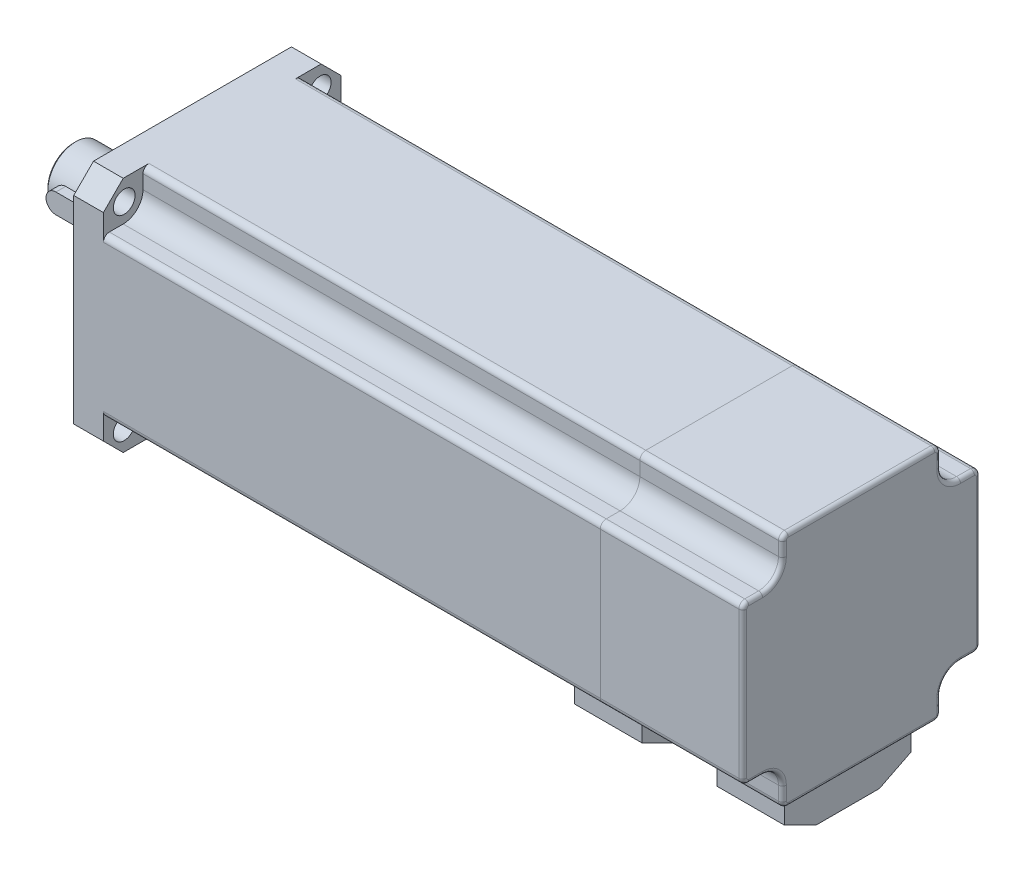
ISO-10303-21;
HEADER;
FILE_DESCRIPTION(('STEP AP214'),'2;1');
FILE_NAME('part.step','',(''),(''),'','','');
FILE_SCHEMA(('AUTOMOTIVE_DESIGN { 1 0 10303 214 1 1 1 1 }'));
ENDSEC;
DATA;
#1=APPLICATION_CONTEXT('core data for automotive mechanical design processes');
#2=APPLICATION_PROTOCOL_DEFINITION('international standard','automotive_design',2000,#1);
#3=PRODUCT_CONTEXT('',#1,'mechanical');
#4=PRODUCT('Part','Part','',(#3));
#5=PRODUCT_RELATED_PRODUCT_CATEGORY('part','',(#4));
#6=PRODUCT_DEFINITION_FORMATION('','',#4);
#7=PRODUCT_DEFINITION_CONTEXT('part definition',#1,'design');
#8=PRODUCT_DEFINITION('design','',#6,#7);
#9=PRODUCT_DEFINITION_SHAPE('','',#8);
#10=(LENGTH_UNIT() NAMED_UNIT(*) SI_UNIT(.MILLI.,.METRE.));
#11=(NAMED_UNIT(*) PLANE_ANGLE_UNIT() SI_UNIT($,.RADIAN.));
#12=(NAMED_UNIT(*) SI_UNIT($,.STERADIAN.) SOLID_ANGLE_UNIT());
#13=UNCERTAINTY_MEASURE_WITH_UNIT(LENGTH_MEASURE(1.E-05),#10,'distance_accuracy_value','');
#14=(GEOMETRIC_REPRESENTATION_CONTEXT(3) GLOBAL_UNCERTAINTY_ASSIGNED_CONTEXT((#13)) GLOBAL_UNIT_ASSIGNED_CONTEXT((#10,
#11,#12)) REPRESENTATION_CONTEXT('',''));
#15=CARTESIAN_POINT('',(0.,0.,0.));
#16=DIRECTION('',(0.,0.,1.));
#17=DIRECTION('',(1.,0.,0.));
#18=AXIS2_PLACEMENT_3D('',#15,#16,#17);
#19=CARTESIAN_POINT('',(129.5,-41.,-16.));
#20=DIRECTION('',(-1.,0.,0.));
#21=DIRECTION('',(0.,0.,1.));
#22=AXIS2_PLACEMENT_3D('',#19,#20,#21);
#23=PLANE('',#22);
#24=DIRECTION('',(0.,0.,1.));
#25=VECTOR('',#24,1.);
#26=CARTESIAN_POINT('',(129.5,-41.,-16.));
#27=LINE('',#26,#25);
#28=CARTESIAN_POINT('',(129.5,-41.,-7.99999999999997));
#29=VERTEX_POINT('',#28);
#30=CARTESIAN_POINT('',(129.5,-41.,7.99999999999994));
#31=VERTEX_POINT('',#30);
#32=EDGE_CURVE('E114',#29,#31,#27,.T.);
#33=ORIENTED_EDGE('',*,*,#32,.F.);
#34=DIRECTION('',(0.,0.447213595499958,-0.894427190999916));
#35=VECTOR('',#34,1.);
#36=CARTESIAN_POINT('',(129.5,-37.8,-14.4));
#37=LINE('',#36,#35);
#38=CARTESIAN_POINT('',(129.5,-37.,-16.));
#39=VERTEX_POINT('',#38);
#40=EDGE_CURVE('E68',#29,#39,#37,.T.);
#41=ORIENTED_EDGE('',*,*,#40,.T.);
#42=DIRECTION('',(0.,1.,0.));
#43=VECTOR('',#42,1.);
#44=CARTESIAN_POINT('',(129.5,-41.,-16.));
#45=LINE('',#44,#43);
#46=CARTESIAN_POINT('',(129.5,-30.,-16.));
#47=VERTEX_POINT('',#46);
#48=EDGE_CURVE('E113',#39,#47,#45,.T.);
#49=ORIENTED_EDGE('',*,*,#48,.T.);
#50=DIRECTION('',(0.,0.,1.));
#51=VECTOR('',#50,1.);
#52=CARTESIAN_POINT('',(129.5,-30.,-16.));
#53=LINE('',#52,#51);
#54=CARTESIAN_POINT('',(129.5,-30.,16.));
#55=VERTEX_POINT('',#54);
#56=EDGE_CURVE('E121',#47,#55,#53,.T.);
#57=ORIENTED_EDGE('',*,*,#56,.T.);
#58=DIRECTION('',(0.,1.,0.));
#59=VECTOR('',#58,1.);
#60=CARTESIAN_POINT('',(129.5,-41.,16.));
#61=LINE('',#60,#59);
#62=CARTESIAN_POINT('',(129.5,-37.,15.9999999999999));
#63=VERTEX_POINT('',#62);
#64=EDGE_CURVE('E134',#63,#55,#61,.T.);
#65=ORIENTED_EDGE('',*,*,#64,.F.);
#66=DIRECTION('',(0.,-0.447213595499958,-0.894427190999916));
#67=VECTOR('',#66,1.);
#68=CARTESIAN_POINT('',(129.5,-50.6,-11.2));
#69=LINE('',#68,#67);
#70=EDGE_CURVE('E155',#63,#31,#69,.T.);
#71=ORIENTED_EDGE('',*,*,#70,.T.);
#72=EDGE_LOOP('',(#33,#41,#49,#57,#65,#71));
#73=FACE_BOUND('',#72,.T.);
#74=ADVANCED_FACE('F46',(#73),#23,.F.);
#75=CARTESIAN_POINT('',(112.5,-41.,15.9999999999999));
#76=DIRECTION('',(0.,0.,-1.));
#77=DIRECTION('',(-1.,0.,0.));
#78=AXIS2_PLACEMENT_3D('',#75,#76,#77);
#79=PLANE('',#78);
#80=DIRECTION('',(0.,1.,0.));
#81=VECTOR('',#80,1.);
#82=CARTESIAN_POINT('',(112.5,-41.,15.9999999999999));
#83=LINE('',#82,#81);
#84=CARTESIAN_POINT('',(112.5,-37.,15.9999999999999));
#85=VERTEX_POINT('',#84);
#86=CARTESIAN_POINT('',(112.5,-30.,15.9999999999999));
#87=VERTEX_POINT('',#86);
#88=EDGE_CURVE('E132',#85,#87,#83,.T.);
#89=ORIENTED_EDGE('',*,*,#88,.F.);
#90=DIRECTION('',(-1.,0.,0.));
#91=VECTOR('',#90,1.);
#92=CARTESIAN_POINT('',(165.5,-37.,15.9999999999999));
#93=LINE('',#92,#91);
#94=EDGE_CURVE('E110',#63,#85,#93,.T.);
#95=ORIENTED_EDGE('',*,*,#94,.F.);
#96=ORIENTED_EDGE('',*,*,#64,.T.);
#97=DIRECTION('',(-1.,0.,0.));
#98=VECTOR('',#97,1.);
#99=CARTESIAN_POINT('',(112.5,-30.,15.9999999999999));
#100=LINE('',#99,#98);
#101=EDGE_CURVE('E124',#55,#87,#100,.T.);
#102=ORIENTED_EDGE('',*,*,#101,.T.);
#103=EDGE_LOOP('',(#89,#95,#96,#102));
#104=FACE_BOUND('',#103,.T.);
#105=ADVANCED_FACE('F140',(#104),#79,.F.);
#106=CARTESIAN_POINT('',(112.5,-41.,-16.));
#107=DIRECTION('',(1.,0.,0.));
#108=DIRECTION('',(0.,0.,-1.));
#109=AXIS2_PLACEMENT_3D('',#106,#107,#108);
#110=PLANE('',#109);
#111=DIRECTION('',(0.,1.,0.));
#112=VECTOR('',#111,1.);
#113=CARTESIAN_POINT('',(112.5,-41.,-16.));
#114=LINE('',#113,#112);
#115=CARTESIAN_POINT('',(112.5,-37.,-16.));
#116=VERTEX_POINT('',#115);
#117=CARTESIAN_POINT('',(112.5,-30.,-16.));
#118=VERTEX_POINT('',#117);
#119=EDGE_CURVE('E108',#116,#118,#114,.T.);
#120=ORIENTED_EDGE('',*,*,#119,.F.);
#121=DIRECTION('',(0.,0.447213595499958,-0.894427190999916));
#122=VECTOR('',#121,1.);
#123=CARTESIAN_POINT('',(112.5,-37.,-16.));
#124=LINE('',#123,#122);
#125=CARTESIAN_POINT('',(112.5,-41.,-7.99999999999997));
#126=VERTEX_POINT('',#125);
#127=EDGE_CURVE('E96',#126,#116,#124,.T.);
#128=ORIENTED_EDGE('',*,*,#127,.F.);
#129=DIRECTION('',(0.,0.,-1.));
#130=VECTOR('',#129,1.);
#131=CARTESIAN_POINT('',(112.5,-41.,-16.));
#132=LINE('',#131,#130);
#133=CARTESIAN_POINT('',(112.5,-41.,7.99999999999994));
#134=VERTEX_POINT('',#133);
#135=EDGE_CURVE('E106',#134,#126,#132,.T.);
#136=ORIENTED_EDGE('',*,*,#135,.F.);
#137=DIRECTION('',(0.,-0.447213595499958,-0.894427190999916));
#138=VECTOR('',#137,1.);
#139=CARTESIAN_POINT('',(112.5,-37.,15.9999999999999));
#140=LINE('',#139,#138);
#141=EDGE_CURVE('E60',#85,#134,#140,.T.);
#142=ORIENTED_EDGE('',*,*,#141,.F.);
#143=ORIENTED_EDGE('',*,*,#88,.T.);
#144=DIRECTION('',(0.,0.,-1.));
#145=VECTOR('',#144,1.);
#146=CARTESIAN_POINT('',(112.5,-30.,-16.));
#147=LINE('',#146,#145);
#148=EDGE_CURVE('E127',#87,#118,#147,.T.);
#149=ORIENTED_EDGE('',*,*,#148,.T.);
#150=EDGE_LOOP('',(#120,#128,#136,#142,#143,#149));
#151=FACE_BOUND('',#150,.T.);
#152=ADVANCED_FACE('F105',(#151),#110,.F.);
#153=CARTESIAN_POINT('',(112.5,-41.,-16.));
#154=DIRECTION('',(0.,0.,1.));
#155=DIRECTION('',(1.,0.,0.));
#156=AXIS2_PLACEMENT_3D('',#153,#154,#155);
#157=PLANE('',#156);
#158=ORIENTED_EDGE('',*,*,#48,.F.);
#159=DIRECTION('',(-1.,0.,0.));
#160=VECTOR('',#159,1.);
#161=CARTESIAN_POINT('',(165.5,-37.,-16.));
#162=LINE('',#161,#160);
#163=EDGE_CURVE('E109',#39,#116,#162,.T.);
#164=ORIENTED_EDGE('',*,*,#163,.T.);
#165=ORIENTED_EDGE('',*,*,#119,.T.);
#166=DIRECTION('',(1.,0.,0.));
#167=VECTOR('',#166,1.);
#168=CARTESIAN_POINT('',(112.5,-30.,-16.));
#169=LINE('',#168,#167);
#170=EDGE_CURVE('E117',#118,#47,#169,.T.);
#171=ORIENTED_EDGE('',*,*,#170,.T.);
#172=EDGE_LOOP('',(#158,#164,#165,#171));
#173=FACE_BOUND('',#172,.T.);
#174=ADVANCED_FACE('F150',(#173),#157,.F.);
#175=CARTESIAN_POINT('',(0.,-41.,0.));
#176=DIRECTION('',(0.,1.,0.));
#177=DIRECTION('',(0.,0.,1.));
#178=AXIS2_PLACEMENT_3D('',#175,#176,#177);
#179=PLANE('',#178);
#180=ORIENTED_EDGE('',*,*,#135,.T.);
#181=DIRECTION('',(1.,0.,0.));
#182=VECTOR('',#181,1.);
#183=CARTESIAN_POINT('',(0.,-41.,-7.99999999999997));
#184=LINE('',#183,#182);
#185=EDGE_CURVE('E12',#126,#29,#184,.T.);
#186=ORIENTED_EDGE('',*,*,#185,.T.);
#187=ORIENTED_EDGE('',*,*,#32,.T.);
#188=DIRECTION('',(-1.,0.,0.));
#189=VECTOR('',#188,1.);
#190=CARTESIAN_POINT('',(0.,-41.,7.99999999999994));
#191=LINE('',#190,#189);
#192=EDGE_CURVE('E53',#31,#134,#191,.T.);
#193=ORIENTED_EDGE('',*,*,#192,.T.);
#194=EDGE_LOOP('',(#180,#186,#187,#193));
#195=FACE_BOUND('',#194,.T.);
#196=ADVANCED_FACE('F112',(#195),#179,.F.);
#197=CARTESIAN_POINT('',(0.,-30.,0.));
#198=DIRECTION('',(0.,1.,0.));
#199=DIRECTION('',(0.,0.,1.));
#200=AXIS2_PLACEMENT_3D('',#197,#198,#199);
#201=PLANE('',#200);
#202=ORIENTED_EDGE('',*,*,#56,.F.);
#203=ORIENTED_EDGE('',*,*,#170,.F.);
#204=ORIENTED_EDGE('',*,*,#148,.F.);
#205=ORIENTED_EDGE('',*,*,#101,.F.);
#206=EDGE_LOOP('',(#202,#203,#204,#205));
#207=FACE_BOUND('',#206,.T.);
#208=ADVANCED_FACE('F146',(#207),#201,.T.);
#209=CARTESIAN_POINT('',(165.5,-37.,15.9999999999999));
#210=DIRECTION('',(0.,0.894427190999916,-0.447213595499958));
#211=DIRECTION('',(0.,0.447213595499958,0.894427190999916));
#212=AXIS2_PLACEMENT_3D('',#209,#210,#211);
#213=PLANE('',#212);
#214=ORIENTED_EDGE('',*,*,#94,.T.);
#215=ORIENTED_EDGE('',*,*,#141,.T.);
#216=ORIENTED_EDGE('',*,*,#192,.F.);
#217=ORIENTED_EDGE('',*,*,#70,.F.);
#218=EDGE_LOOP('',(#214,#215,#216,#217));
#219=FACE_BOUND('',#218,.T.);
#220=ADVANCED_FACE('F156',(#219),#213,.F.);
#221=CARTESIAN_POINT('',(165.5,-37.,-16.));
#222=DIRECTION('',(0.,0.894427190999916,0.447213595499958));
#223=DIRECTION('',(0.,-0.447213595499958,0.894427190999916));
#224=AXIS2_PLACEMENT_3D('',#221,#222,#223);
#225=PLANE('',#224);
#226=ORIENTED_EDGE('',*,*,#185,.F.);
#227=ORIENTED_EDGE('',*,*,#127,.T.);
#228=ORIENTED_EDGE('',*,*,#163,.F.);
#229=ORIENTED_EDGE('',*,*,#40,.F.);
#230=EDGE_LOOP('',(#226,#227,#228,#229));
#231=FACE_BOUND('',#230,.T.);
#232=ADVANCED_FACE('F95',(#231),#225,.F.);
#233=CLOSED_SHELL('',(#74,#105,#152,#174,#196,#208,#220,#232));
#234=MANIFOLD_SOLID_BREP('B2',#233);
#235=CARTESIAN_POINT('',(165.5,-41.,-16.));
#236=DIRECTION('',(-1.,0.,0.));
#237=DIRECTION('',(0.,0.,1.));
#238=AXIS2_PLACEMENT_3D('',#235,#236,#237);
#239=PLANE('',#238);
#240=DIRECTION('',(0.,0.,1.));
#241=VECTOR('',#240,1.);
#242=CARTESIAN_POINT('',(165.5,-41.,-16.));
#243=LINE('',#242,#241);
#244=CARTESIAN_POINT('',(165.5,-41.,-7.99999999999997));
#245=VERTEX_POINT('',#244);
#246=CARTESIAN_POINT('',(165.5,-41.,7.99999999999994));
#247=VERTEX_POINT('',#246);
#248=EDGE_CURVE('E297',#245,#247,#243,.T.);
#249=ORIENTED_EDGE('',*,*,#248,.F.);
#250=DIRECTION('',(0.,0.447213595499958,-0.894427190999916));
#251=VECTOR('',#250,1.);
#252=CARTESIAN_POINT('',(165.5,-37.,-16.));
#253=LINE('',#252,#251);
#254=CARTESIAN_POINT('',(165.5,-37.,-16.));
#255=VERTEX_POINT('',#254);
#256=EDGE_CURVE('E254',#245,#255,#253,.T.);
#257=ORIENTED_EDGE('',*,*,#256,.T.);
#258=DIRECTION('',(0.,1.,0.));
#259=VECTOR('',#258,1.);
#260=CARTESIAN_POINT('',(165.5,-41.,-16.));
#261=LINE('',#260,#259);
#262=CARTESIAN_POINT('',(165.5,-30.,-16.));
#263=VERTEX_POINT('',#262);
#264=EDGE_CURVE('E293',#255,#263,#261,.T.);
#265=ORIENTED_EDGE('',*,*,#264,.T.);
#266=DIRECTION('',(0.,0.,1.));
#267=VECTOR('',#266,1.);
#268=CARTESIAN_POINT('',(165.5,-30.,-16.));
#269=LINE('',#268,#267);
#270=CARTESIAN_POINT('',(165.5,-30.,16.));
#271=VERTEX_POINT('',#270);
#272=EDGE_CURVE('E327',#263,#271,#269,.T.);
#273=ORIENTED_EDGE('',*,*,#272,.T.);
#274=DIRECTION('',(0.,1.,0.));
#275=VECTOR('',#274,1.);
#276=CARTESIAN_POINT('',(165.5,-41.,16.));
#277=LINE('',#276,#275);
#278=CARTESIAN_POINT('',(165.5,-37.,15.9999999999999));
#279=VERTEX_POINT('',#278);
#280=EDGE_CURVE('E44',#279,#271,#277,.T.);
#281=ORIENTED_EDGE('',*,*,#280,.F.);
#282=DIRECTION('',(0.,-0.447213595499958,-0.894427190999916));
#283=VECTOR('',#282,1.);
#284=CARTESIAN_POINT('',(165.5,-37.,15.9999999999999));
#285=LINE('',#284,#283);
#286=EDGE_CURVE('E337',#279,#247,#285,.T.);
#287=ORIENTED_EDGE('',*,*,#286,.T.);
#288=EDGE_LOOP('',(#249,#257,#265,#273,#281,#287));
#289=FACE_BOUND('',#288,.T.);
#290=ADVANCED_FACE('F232',(#289),#239,.F.);
#291=CARTESIAN_POINT('',(148.5,-41.,16.));
#292=DIRECTION('',(0.,0.,-1.));
#293=DIRECTION('',(-1.,0.,0.));
#294=AXIS2_PLACEMENT_3D('',#291,#292,#293);
#295=PLANE('',#294);
#296=DIRECTION('',(0.,1.,0.));
#297=VECTOR('',#296,1.);
#298=CARTESIAN_POINT('',(148.5,-41.,16.));
#299=LINE('',#298,#297);
#300=CARTESIAN_POINT('',(148.5,-37.,15.9999999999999));
#301=VERTEX_POINT('',#300);
#302=CARTESIAN_POINT('',(148.5,-30.,16.));
#303=VERTEX_POINT('',#302);
#304=EDGE_CURVE('E239',#301,#303,#299,.T.);
#305=ORIENTED_EDGE('',*,*,#304,.F.);
#306=DIRECTION('',(-1.,0.,0.));
#307=VECTOR('',#306,1.);
#308=CARTESIAN_POINT('',(165.5,-37.,15.9999999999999));
#309=LINE('',#308,#307);
#310=EDGE_CURVE('E335',#279,#301,#309,.T.);
#311=ORIENTED_EDGE('',*,*,#310,.F.);
#312=ORIENTED_EDGE('',*,*,#280,.T.);
#313=DIRECTION('',(-1.,0.,0.));
#314=VECTOR('',#313,1.);
#315=CARTESIAN_POINT('',(148.5,-30.,16.));
#316=LINE('',#315,#314);
#317=EDGE_CURVE('E323',#271,#303,#316,.T.);
#318=ORIENTED_EDGE('',*,*,#317,.T.);
#319=EDGE_LOOP('',(#305,#311,#312,#318));
#320=FACE_BOUND('',#319,.T.);
#321=ADVANCED_FACE('F324',(#320),#295,.F.);
#322=CARTESIAN_POINT('',(148.5,-41.,-16.));
#323=DIRECTION('',(1.,0.,0.));
#324=DIRECTION('',(0.,0.,-1.));
#325=AXIS2_PLACEMENT_3D('',#322,#323,#324);
#326=PLANE('',#325);
#327=DIRECTION('',(0.,1.,0.));
#328=VECTOR('',#327,1.);
#329=CARTESIAN_POINT('',(148.5,-41.,-16.));
#330=LINE('',#329,#328);
#331=CARTESIAN_POINT('',(148.5,-37.,-16.));
#332=VERTEX_POINT('',#331);
#333=CARTESIAN_POINT('',(148.5,-30.,-16.));
#334=VERTEX_POINT('',#333);
#335=EDGE_CURVE('E304',#332,#334,#330,.T.);
#336=ORIENTED_EDGE('',*,*,#335,.F.);
#337=DIRECTION('',(0.,-0.447213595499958,0.894427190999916));
#338=VECTOR('',#337,1.);
#339=CARTESIAN_POINT('',(148.5,-37.8,-14.4));
#340=LINE('',#339,#338);
#341=CARTESIAN_POINT('',(148.5,-41.,-7.99999999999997));
#342=VERTEX_POINT('',#341);
#343=EDGE_CURVE('E284',#332,#342,#340,.T.);
#344=ORIENTED_EDGE('',*,*,#343,.T.);
#345=DIRECTION('',(0.,0.,-1.));
#346=VECTOR('',#345,1.);
#347=CARTESIAN_POINT('',(148.5,-41.,-16.));
#348=LINE('',#347,#346);
#349=CARTESIAN_POINT('',(148.5,-41.,7.99999999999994));
#350=VERTEX_POINT('',#349);
#351=EDGE_CURVE('E305',#350,#342,#348,.T.);
#352=ORIENTED_EDGE('',*,*,#351,.F.);
#353=DIRECTION('',(0.,0.447213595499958,0.894427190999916));
#354=VECTOR('',#353,1.);
#355=CARTESIAN_POINT('',(148.5,-50.6,-11.2));
#356=LINE('',#355,#354);
#357=EDGE_CURVE('E246',#350,#301,#356,.T.);
#358=ORIENTED_EDGE('',*,*,#357,.T.);
#359=ORIENTED_EDGE('',*,*,#304,.T.);
#360=DIRECTION('',(0.,0.,-1.));
#361=VECTOR('',#360,1.);
#362=CARTESIAN_POINT('',(148.5,-30.,-16.));
#363=LINE('',#362,#361);
#364=EDGE_CURVE('E318',#303,#334,#363,.T.);
#365=ORIENTED_EDGE('',*,*,#364,.T.);
#366=EDGE_LOOP('',(#336,#344,#352,#358,#359,#365));
#367=FACE_BOUND('',#366,.T.);
#368=ADVANCED_FACE('F316',(#367),#326,.F.);
#369=CARTESIAN_POINT('',(148.5,-41.,-16.));
#370=DIRECTION('',(0.,0.,1.));
#371=DIRECTION('',(1.,0.,0.));
#372=AXIS2_PLACEMENT_3D('',#369,#370,#371);
#373=PLANE('',#372);
#374=ORIENTED_EDGE('',*,*,#264,.F.);
#375=DIRECTION('',(-1.,0.,0.));
#376=VECTOR('',#375,1.);
#377=CARTESIAN_POINT('',(165.5,-37.,-16.));
#378=LINE('',#377,#376);
#379=EDGE_CURVE('E281',#255,#332,#378,.T.);
#380=ORIENTED_EDGE('',*,*,#379,.T.);
#381=ORIENTED_EDGE('',*,*,#335,.T.);
#382=DIRECTION('',(1.,0.,0.));
#383=VECTOR('',#382,1.);
#384=CARTESIAN_POINT('',(148.5,-30.,-16.));
#385=LINE('',#384,#383);
#386=EDGE_CURVE('E302',#334,#263,#385,.T.);
#387=ORIENTED_EDGE('',*,*,#386,.T.);
#388=EDGE_LOOP('',(#374,#380,#381,#387));
#389=FACE_BOUND('',#388,.T.);
#390=ADVANCED_FACE('F300',(#389),#373,.F.);
#391=CARTESIAN_POINT('',(0.,-41.,0.));
#392=DIRECTION('',(0.,1.,0.));
#393=DIRECTION('',(0.,0.,1.));
#394=AXIS2_PLACEMENT_3D('',#391,#392,#393);
#395=PLANE('',#394);
#396=ORIENTED_EDGE('',*,*,#351,.T.);
#397=DIRECTION('',(-1.,0.,0.));
#398=VECTOR('',#397,1.);
#399=CARTESIAN_POINT('',(165.5,-41.,-7.99999999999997));
#400=LINE('',#399,#398);
#401=EDGE_CURVE('E288',#245,#342,#400,.T.);
#402=ORIENTED_EDGE('',*,*,#401,.F.);
#403=ORIENTED_EDGE('',*,*,#248,.T.);
#404=DIRECTION('',(-1.,0.,0.));
#405=VECTOR('',#404,1.);
#406=CARTESIAN_POINT('',(165.5,-41.,7.99999999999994));
#407=LINE('',#406,#405);
#408=EDGE_CURVE('E298',#247,#350,#407,.T.);
#409=ORIENTED_EDGE('',*,*,#408,.T.);
#410=EDGE_LOOP('',(#396,#402,#403,#409));
#411=FACE_BOUND('',#410,.T.);
#412=ADVANCED_FACE('F341',(#411),#395,.F.);
#413=CARTESIAN_POINT('',(0.,-30.,0.));
#414=DIRECTION('',(0.,1.,0.));
#415=DIRECTION('',(0.,0.,1.));
#416=AXIS2_PLACEMENT_3D('',#413,#414,#415);
#417=PLANE('',#416);
#418=ORIENTED_EDGE('',*,*,#272,.F.);
#419=ORIENTED_EDGE('',*,*,#386,.F.);
#420=ORIENTED_EDGE('',*,*,#364,.F.);
#421=ORIENTED_EDGE('',*,*,#317,.F.);
#422=EDGE_LOOP('',(#418,#419,#420,#421));
#423=FACE_BOUND('',#422,.T.);
#424=ADVANCED_FACE('F329',(#423),#417,.T.);
#425=CARTESIAN_POINT('',(165.5,-37.,15.9999999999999));
#426=DIRECTION('',(0.,0.894427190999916,-0.447213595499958));
#427=DIRECTION('',(0.,0.447213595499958,0.894427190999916));
#428=AXIS2_PLACEMENT_3D('',#425,#426,#427);
#429=PLANE('',#428);
#430=ORIENTED_EDGE('',*,*,#408,.F.);
#431=ORIENTED_EDGE('',*,*,#286,.F.);
#432=ORIENTED_EDGE('',*,*,#310,.T.);
#433=ORIENTED_EDGE('',*,*,#357,.F.);
#434=EDGE_LOOP('',(#430,#431,#432,#433));
#435=FACE_BOUND('',#434,.T.);
#436=ADVANCED_FACE('F342',(#435),#429,.F.);
#437=CARTESIAN_POINT('',(165.5,-37.,-16.));
#438=DIRECTION('',(0.,0.894427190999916,0.447213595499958));
#439=DIRECTION('',(0.,-0.447213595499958,0.894427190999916));
#440=AXIS2_PLACEMENT_3D('',#437,#438,#439);
#441=PLANE('',#440);
#442=ORIENTED_EDGE('',*,*,#379,.F.);
#443=ORIENTED_EDGE('',*,*,#256,.F.);
#444=ORIENTED_EDGE('',*,*,#401,.T.);
#445=ORIENTED_EDGE('',*,*,#343,.F.);
#446=EDGE_LOOP('',(#442,#443,#444,#445));
#447=FACE_BOUND('',#446,.T.);
#448=ADVANCED_FACE('F282',(#447),#441,.F.);
#449=CLOSED_SHELL('',(#290,#321,#368,#390,#412,#424,#436,#448));
#450=MANIFOLD_SOLID_BREP('B6',#449);
#451=CARTESIAN_POINT('',(-25.5,0.,9.));
#452=DIRECTION('',(0.,0.,-1.));
#453=DIRECTION('',(-1.,0.,0.));
#454=AXIS2_PLACEMENT_3D('',#451,#452,#453);
#455=CYLINDRICAL_SURFACE('',#454,2.5);
#456=CARTESIAN_POINT('',(-25.5,0.,4.));
#457=DIRECTION('',(0.,0.,1.));
#458=DIRECTION('',(1.,0.,0.));
#459=AXIS2_PLACEMENT_3D('',#456,#457,#458);
#460=CIRCLE('',#459,2.5);
#461=CARTESIAN_POINT('',(-25.5,2.5,4.));
#462=VERTEX_POINT('',#461);
#463=CARTESIAN_POINT('',(-25.5,-2.5,4.));
#464=VERTEX_POINT('',#463);
#465=EDGE_CURVE('E481',#462,#464,#460,.T.);
#466=ORIENTED_EDGE('',*,*,#465,.T.);
#467=DIRECTION('',(0.,0.,-1.));
#468=VECTOR('',#467,1.);
#469=CARTESIAN_POINT('',(-25.5,-2.5,9.));
#470=LINE('',#469,#468);
#471=CARTESIAN_POINT('',(-25.5,-2.5,9.));
#472=VERTEX_POINT('',#471);
#473=EDGE_CURVE('E230',#472,#464,#470,.T.);
#474=ORIENTED_EDGE('',*,*,#473,.F.);
#475=CARTESIAN_POINT('',(-25.5,0.,9.));
#476=DIRECTION('',(0.,0.,1.));
#477=DIRECTION('',(1.,0.,0.));
#478=AXIS2_PLACEMENT_3D('',#475,#476,#477);
#479=CIRCLE('',#478,2.5);
#480=CARTESIAN_POINT('',(-25.5,2.5,9.));
#481=VERTEX_POINT('',#480);
#482=EDGE_CURVE('E469',#481,#472,#479,.T.);
#483=ORIENTED_EDGE('',*,*,#482,.F.);
#484=DIRECTION('',(0.,0.,-1.));
#485=VECTOR('',#484,1.);
#486=CARTESIAN_POINT('',(-25.5,2.5,9.));
#487=LINE('',#486,#485);
#488=EDGE_CURVE('E477',#481,#462,#487,.T.);
#489=ORIENTED_EDGE('',*,*,#488,.T.);
#490=EDGE_LOOP('',(#466,#474,#483,#489));
#491=FACE_BOUND('',#490,.T.);
#492=ADVANCED_FACE('F418',(#491),#455,.T.);
#493=CARTESIAN_POINT('',(-10.,-2.5,9.));
#494=DIRECTION('',(0.,1.,0.));
#495=DIRECTION('',(-1.,0.,0.));
#496=AXIS2_PLACEMENT_3D('',#493,#494,#495);
#497=PLANE('',#496);
#498=DIRECTION('',(1.,0.,0.));
#499=VECTOR('',#498,1.);
#500=CARTESIAN_POINT('',(-10.,-2.5,4.));
#501=LINE('',#500,#499);
#502=CARTESIAN_POINT('',(-10.,-2.5,4.));
#503=VERTEX_POINT('',#502);
#504=EDGE_CURVE('E473',#464,#503,#501,.T.);
#505=ORIENTED_EDGE('',*,*,#504,.T.);
#506=DIRECTION('',(0.,0.,-1.));
#507=VECTOR('',#506,1.);
#508=CARTESIAN_POINT('',(-10.,-2.5,9.));
#509=LINE('',#508,#507);
#510=CARTESIAN_POINT('',(-10.,-2.5,9.));
#511=VERTEX_POINT('',#510);
#512=EDGE_CURVE('E426',#511,#503,#509,.T.);
#513=ORIENTED_EDGE('',*,*,#512,.F.);
#514=DIRECTION('',(1.,0.,0.));
#515=VECTOR('',#514,1.);
#516=CARTESIAN_POINT('',(-10.,-2.5,9.));
#517=LINE('',#516,#515);
#518=EDGE_CURVE('E464',#472,#511,#517,.T.);
#519=ORIENTED_EDGE('',*,*,#518,.F.);
#520=ORIENTED_EDGE('',*,*,#473,.T.);
#521=EDGE_LOOP('',(#505,#513,#519,#520));
#522=FACE_BOUND('',#521,.T.);
#523=ADVANCED_FACE('F472',(#522),#497,.F.);
#524=CARTESIAN_POINT('',(-10.,0.,9.));
#525=DIRECTION('',(0.,0.,-1.));
#526=DIRECTION('',(-1.,0.,0.));
#527=AXIS2_PLACEMENT_3D('',#524,#525,#526);
#528=CYLINDRICAL_SURFACE('',#527,2.5);
#529=CARTESIAN_POINT('',(-10.,0.,4.));
#530=DIRECTION('',(0.,0.,1.));
#531=DIRECTION('',(1.,0.,0.));
#532=AXIS2_PLACEMENT_3D('',#529,#530,#531);
#533=CIRCLE('',#532,2.5);
#534=CARTESIAN_POINT('',(-10.,2.5,4.));
#535=VERTEX_POINT('',#534);
#536=EDGE_CURVE('E451',#503,#535,#533,.T.);
#537=ORIENTED_EDGE('',*,*,#536,.T.);
#538=DIRECTION('',(0.,0.,-1.));
#539=VECTOR('',#538,1.);
#540=CARTESIAN_POINT('',(-10.,2.5,9.));
#541=LINE('',#540,#539);
#542=CARTESIAN_POINT('',(-10.,2.5,9.));
#543=VERTEX_POINT('',#542);
#544=EDGE_CURVE('E474',#543,#535,#541,.T.);
#545=ORIENTED_EDGE('',*,*,#544,.F.);
#546=CARTESIAN_POINT('',(-10.,0.,9.));
#547=DIRECTION('',(0.,0.,1.));
#548=DIRECTION('',(1.,0.,0.));
#549=AXIS2_PLACEMENT_3D('',#546,#547,#548);
#550=CIRCLE('',#549,2.5);
#551=EDGE_CURVE('E467',#511,#543,#550,.T.);
#552=ORIENTED_EDGE('',*,*,#551,.F.);
#553=ORIENTED_EDGE('',*,*,#512,.T.);
#554=EDGE_LOOP('',(#537,#545,#552,#553));
#555=FACE_BOUND('',#554,.T.);
#556=ADVANCED_FACE('F475',(#555),#528,.T.);
#557=CARTESIAN_POINT('',(-25.5,2.5,9.));
#558=DIRECTION('',(0.,-1.,0.));
#559=DIRECTION('',(1.,0.,0.));
#560=AXIS2_PLACEMENT_3D('',#557,#558,#559);
#561=PLANE('',#560);
#562=DIRECTION('',(-1.,0.,0.));
#563=VECTOR('',#562,1.);
#564=CARTESIAN_POINT('',(-25.5,2.5,4.));
#565=LINE('',#564,#563);
#566=EDGE_CURVE('E457',#535,#462,#565,.T.);
#567=ORIENTED_EDGE('',*,*,#566,.T.);
#568=ORIENTED_EDGE('',*,*,#488,.F.);
#569=DIRECTION('',(-1.,0.,0.));
#570=VECTOR('',#569,1.);
#571=CARTESIAN_POINT('',(-25.5,2.5,9.));
#572=LINE('',#571,#570);
#573=EDGE_CURVE('E434',#543,#481,#572,.T.);
#574=ORIENTED_EDGE('',*,*,#573,.F.);
#575=ORIENTED_EDGE('',*,*,#544,.T.);
#576=EDGE_LOOP('',(#567,#568,#574,#575));
#577=FACE_BOUND('',#576,.T.);
#578=ADVANCED_FACE('F488',(#577),#561,.F.);
#579=CARTESIAN_POINT('',(-25.5,0.,9.));
#580=DIRECTION('',(0.,0.,1.));
#581=DIRECTION('',(1.,0.,0.));
#582=AXIS2_PLACEMENT_3D('',#579,#580,#581);
#583=PLANE('',#582);
#584=ORIENTED_EDGE('',*,*,#482,.T.);
#585=ORIENTED_EDGE('',*,*,#518,.T.);
#586=ORIENTED_EDGE('',*,*,#551,.T.);
#587=ORIENTED_EDGE('',*,*,#573,.T.);
#588=EDGE_LOOP('',(#584,#585,#586,#587));
#589=FACE_BOUND('',#588,.T.);
#590=ADVANCED_FACE('F465',(#589),#583,.T.);
#591=CARTESIAN_POINT('',(-25.5,0.,4.));
#592=DIRECTION('',(0.,0.,1.));
#593=DIRECTION('',(1.,0.,0.));
#594=AXIS2_PLACEMENT_3D('',#591,#592,#593);
#595=PLANE('',#594);
#596=ORIENTED_EDGE('',*,*,#465,.F.);
#597=ORIENTED_EDGE('',*,*,#566,.F.);
#598=ORIENTED_EDGE('',*,*,#536,.F.);
#599=ORIENTED_EDGE('',*,*,#504,.F.);
#600=EDGE_LOOP('',(#596,#597,#598,#599));
#601=FACE_BOUND('',#600,.T.);
#602=ADVANCED_FACE('F491',(#601),#595,.F.);
#603=CLOSED_SHELL('',(#492,#523,#556,#578,#590,#602));
#604=MANIFOLD_SOLID_BREP('B38',#603);
#605=CARTESIAN_POINT('',(169.,-25.,30.));
#606=DIRECTION('',(0.,0.,-1.));
#607=DIRECTION('',(-1.,0.,0.));
#608=AXIS2_PLACEMENT_3D('',#605,#606,#607);
#609=PLANE('',#608);
#610=DIRECTION('',(1.,0.,0.));
#611=VECTOR('',#610,1.);
#612=CARTESIAN_POINT('',(7.50000000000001,-18.5,30.));
#613=LINE('',#612,#611);
#614=CARTESIAN_POINT('',(133.,-18.5,30.));
#615=VERTEX_POINT('',#614);
#616=CARTESIAN_POINT('',(168.,-18.5,30.));
#617=VERTEX_POINT('',#616);
#618=EDGE_CURVE('E1645',#615,#617,#613,.T.);
#619=ORIENTED_EDGE('',*,*,#618,.T.);
#620=DIRECTION('',(0.,-1.,0.));
#621=VECTOR('',#620,1.);
#622=CARTESIAN_POINT('',(168.,-25.,30.));
#623=LINE('',#622,#621);
#624=CARTESIAN_POINT('',(168.,18.5,30.));
#625=VERTEX_POINT('',#624);
#626=EDGE_CURVE('E416',#617,#625,#623,.F.);
#627=ORIENTED_EDGE('',*,*,#626,.T.);
#628=DIRECTION('',(1.,0.,0.));
#629=VECTOR('',#628,1.);
#630=CARTESIAN_POINT('',(7.50000000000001,18.5,30.));
#631=LINE('',#630,#629);
#632=CARTESIAN_POINT('',(133.,18.5,30.));
#633=VERTEX_POINT('',#632);
#634=EDGE_CURVE('E1095',#633,#625,#631,.T.);
#635=ORIENTED_EDGE('',*,*,#634,.F.);
#636=DIRECTION('',(0.,-1.,0.));
#637=VECTOR('',#636,1.);
#638=CARTESIAN_POINT('',(133.,-25.,30.));
#639=LINE('',#638,#637);
#640=EDGE_CURVE('E1069',#633,#615,#639,.T.);
#641=ORIENTED_EDGE('',*,*,#640,.T.);
#642=EDGE_LOOP('',(#619,#627,#635,#641));
#643=FACE_BOUND('',#642,.T.);
#644=ADVANCED_FACE('F551',(#643),#609,.F.);
#645=CARTESIAN_POINT('',(169.,-30.,25.));
#646=DIRECTION('',(0.,1.,0.));
#647=DIRECTION('',(0.,0.,1.));
#648=AXIS2_PLACEMENT_3D('',#645,#646,#647);
#649=PLANE('',#648);
#650=DIRECTION('',(1.,0.,0.));
#651=VECTOR('',#650,1.);
#652=CARTESIAN_POINT('',(7.50000000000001,-30.,-18.5));
#653=LINE('',#652,#651);
#654=CARTESIAN_POINT('',(133.,-30.,-18.5));
#655=VERTEX_POINT('',#654);
#656=CARTESIAN_POINT('',(168.,-30.,-18.5));
#657=VERTEX_POINT('',#656);
#658=EDGE_CURVE('E1050',#655,#657,#653,.T.);
#659=ORIENTED_EDGE('',*,*,#658,.T.);
#660=DIRECTION('',(0.,0.,-1.));
#661=VECTOR('',#660,1.);
#662=CARTESIAN_POINT('',(168.,-30.,25.));
#663=LINE('',#662,#661);
#664=CARTESIAN_POINT('',(168.,-30.,18.5));
#665=VERTEX_POINT('',#664);
#666=EDGE_CURVE('E935',#657,#665,#663,.F.);
#667=ORIENTED_EDGE('',*,*,#666,.T.);
#668=DIRECTION('',(1.,0.,0.));
#669=VECTOR('',#668,1.);
#670=CARTESIAN_POINT('',(7.50000000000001,-30.,18.5));
#671=LINE('',#670,#669);
#672=CARTESIAN_POINT('',(133.,-30.,18.5));
#673=VERTEX_POINT('',#672);
#674=EDGE_CURVE('E1643',#673,#665,#671,.T.);
#675=ORIENTED_EDGE('',*,*,#674,.F.);
#676=DIRECTION('',(0.,0.,-1.));
#677=VECTOR('',#676,1.);
#678=CARTESIAN_POINT('',(133.,-30.,25.));
#679=LINE('',#678,#677);
#680=EDGE_CURVE('E1072',#673,#655,#679,.T.);
#681=ORIENTED_EDGE('',*,*,#680,.T.);
#682=EDGE_LOOP('',(#659,#667,#675,#681));
#683=FACE_BOUND('',#682,.T.);
#684=ADVANCED_FACE('F1220',(#683),#649,.F.);
#685=CARTESIAN_POINT('',(169.,-25.,-30.));
#686=DIRECTION('',(0.,0.,1.));
#687=DIRECTION('',(1.,0.,0.));
#688=AXIS2_PLACEMENT_3D('',#685,#686,#687);
#689=PLANE('',#688);
#690=DIRECTION('',(1.,0.,0.));
#691=VECTOR('',#690,1.);
#692=CARTESIAN_POINT('',(7.50000000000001,18.5,-30.));
#693=LINE('',#692,#691);
#694=CARTESIAN_POINT('',(133.,18.5,-30.));
#695=VERTEX_POINT('',#694);
#696=CARTESIAN_POINT('',(168.,18.5,-30.));
#697=VERTEX_POINT('',#696);
#698=EDGE_CURVE('E1065',#695,#697,#693,.T.);
#699=ORIENTED_EDGE('',*,*,#698,.T.);
#700=DIRECTION('',(0.,1.,0.));
#701=VECTOR('',#700,1.);
#702=CARTESIAN_POINT('',(168.,-25.,-30.));
#703=LINE('',#702,#701);
#704=CARTESIAN_POINT('',(168.,-18.5,-30.));
#705=VERTEX_POINT('',#704);
#706=EDGE_CURVE('E923',#697,#705,#703,.F.);
#707=ORIENTED_EDGE('',*,*,#706,.T.);
#708=DIRECTION('',(1.,0.,0.));
#709=VECTOR('',#708,1.);
#710=CARTESIAN_POINT('',(7.50000000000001,-18.5,-30.));
#711=LINE('',#710,#709);
#712=CARTESIAN_POINT('',(133.,-18.5,-30.));
#713=VERTEX_POINT('',#712);
#714=EDGE_CURVE('E1052',#713,#705,#711,.T.);
#715=ORIENTED_EDGE('',*,*,#714,.F.);
#716=DIRECTION('',(0.,1.,0.));
#717=VECTOR('',#716,1.);
#718=CARTESIAN_POINT('',(133.,-25.,-30.));
#719=LINE('',#718,#717);
#720=EDGE_CURVE('E1076',#713,#695,#719,.T.);
#721=ORIENTED_EDGE('',*,*,#720,.T.);
#722=EDGE_LOOP('',(#699,#707,#715,#721));
#723=FACE_BOUND('',#722,.T.);
#724=ADVANCED_FACE('F1119',(#723),#689,.F.);
#725=CARTESIAN_POINT('',(169.,30.,25.));
#726=DIRECTION('',(0.,-1.,0.));
#727=DIRECTION('',(0.,0.,-1.));
#728=AXIS2_PLACEMENT_3D('',#725,#726,#727);
#729=PLANE('',#728);
#730=DIRECTION('',(1.,0.,0.));
#731=VECTOR('',#730,1.);
#732=CARTESIAN_POINT('',(7.50000000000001,30.,18.5));
#733=LINE('',#732,#731);
#734=CARTESIAN_POINT('',(133.,30.,18.5));
#735=VERTEX_POINT('',#734);
#736=CARTESIAN_POINT('',(168.,30.,18.5));
#737=VERTEX_POINT('',#736);
#738=EDGE_CURVE('E1085',#735,#737,#733,.T.);
#739=ORIENTED_EDGE('',*,*,#738,.T.);
#740=DIRECTION('',(0.,0.,1.));
#741=VECTOR('',#740,1.);
#742=CARTESIAN_POINT('',(168.,30.,25.));
#743=LINE('',#742,#741);
#744=CARTESIAN_POINT('',(168.,30.,-18.5));
#745=VERTEX_POINT('',#744);
#746=EDGE_CURVE('E912',#737,#745,#743,.F.);
#747=ORIENTED_EDGE('',*,*,#746,.T.);
#748=DIRECTION('',(1.,0.,0.));
#749=VECTOR('',#748,1.);
#750=CARTESIAN_POINT('',(7.50000000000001,30.,-18.5));
#751=LINE('',#750,#749);
#752=CARTESIAN_POINT('',(133.,30.,-18.5));
#753=VERTEX_POINT('',#752);
#754=EDGE_CURVE('E1062',#753,#745,#751,.T.);
#755=ORIENTED_EDGE('',*,*,#754,.F.);
#756=DIRECTION('',(0.,0.,1.));
#757=VECTOR('',#756,1.);
#758=CARTESIAN_POINT('',(133.,30.,25.));
#759=LINE('',#758,#757);
#760=EDGE_CURVE('E798',#753,#735,#759,.T.);
#761=ORIENTED_EDGE('',*,*,#760,.T.);
#762=EDGE_LOOP('',(#739,#747,#755,#761));
#763=FACE_BOUND('',#762,.T.);
#764=ADVANCED_FACE('F1084',(#763),#729,.F.);
#765=CARTESIAN_POINT('',(169.,0.,0.));
#766=DIRECTION('',(-1.,0.,0.));
#767=DIRECTION('',(0.,0.,1.));
#768=AXIS2_PLACEMENT_3D('',#765,#766,#767);
#769=PLANE('',#768);
#770=DIRECTION('',(0.,0.,-1.));
#771=VECTOR('',#770,1.);
#772=CARTESIAN_POINT('',(169.,19.,0.));
#773=LINE('',#772,#771);
#774=CARTESIAN_POINT('',(169.,19.,25.));
#775=VERTEX_POINT('',#774);
#776=CARTESIAN_POINT('',(169.,19.,28.5));
#777=VERTEX_POINT('',#776);
#778=EDGE_CURVE('E899',#775,#777,#773,.F.);
#779=ORIENTED_EDGE('',*,*,#778,.T.);
#780=CARTESIAN_POINT('',(169.,18.5,28.5));
#781=DIRECTION('',(-1.,0.,0.));
#782=DIRECTION('',(0.,0.,1.));
#783=AXIS2_PLACEMENT_3D('',#780,#781,#782);
#784=CIRCLE('',#783,0.500000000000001);
#785=CARTESIAN_POINT('',(169.,18.5,29.));
#786=VERTEX_POINT('',#785);
#787=EDGE_CURVE('E901',#777,#786,#784,.F.);
#788=ORIENTED_EDGE('',*,*,#787,.T.);
#789=DIRECTION('',(0.,-1.,0.));
#790=VECTOR('',#789,1.);
#791=CARTESIAN_POINT('',(169.,0.,29.));
#792=LINE('',#791,#790);
#793=CARTESIAN_POINT('',(169.,-18.5,29.));
#794=VERTEX_POINT('',#793);
#795=EDGE_CURVE('E855',#786,#794,#792,.T.);
#796=ORIENTED_EDGE('',*,*,#795,.T.);
#797=CARTESIAN_POINT('',(169.,-18.5,28.5));
#798=DIRECTION('',(-1.,0.,0.));
#799=DIRECTION('',(0.,0.,1.));
#800=AXIS2_PLACEMENT_3D('',#797,#798,#799);
#801=CIRCLE('',#800,0.500000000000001);
#802=CARTESIAN_POINT('',(169.,-19.,28.5));
#803=VERTEX_POINT('',#802);
#804=EDGE_CURVE('E857',#794,#803,#801,.F.);
#805=ORIENTED_EDGE('',*,*,#804,.T.);
#806=DIRECTION('',(0.,0.,1.));
#807=VECTOR('',#806,1.);
#808=CARTESIAN_POINT('',(169.,-19.,0.));
#809=LINE('',#808,#807);
#810=CARTESIAN_POINT('',(169.,-19.,25.));
#811=VERTEX_POINT('',#810);
#812=EDGE_CURVE('E859',#803,#811,#809,.F.);
#813=ORIENTED_EDGE('',*,*,#812,.T.);
#814=CARTESIAN_POINT('',(169.,-25.,25.));
#815=DIRECTION('',(-1.,0.,0.));
#816=DIRECTION('',(0.,0.,1.));
#817=AXIS2_PLACEMENT_3D('',#814,#815,#816);
#818=CIRCLE('',#817,6.);
#819=CARTESIAN_POINT('',(169.,-25.,19.));
#820=VERTEX_POINT('',#819);
#821=EDGE_CURVE('E861',#811,#820,#818,.T.);
#822=ORIENTED_EDGE('',*,*,#821,.T.);
#823=DIRECTION('',(0.,1.,0.));
#824=VECTOR('',#823,1.);
#825=CARTESIAN_POINT('',(169.,0.,19.));
#826=LINE('',#825,#824);
#827=CARTESIAN_POINT('',(169.,-28.5,19.));
#828=VERTEX_POINT('',#827);
#829=EDGE_CURVE('E863',#820,#828,#826,.F.);
#830=ORIENTED_EDGE('',*,*,#829,.T.);
#831=CARTESIAN_POINT('',(169.,-28.5,18.5));
#832=DIRECTION('',(-1.,0.,0.));
#833=DIRECTION('',(0.,0.,1.));
#834=AXIS2_PLACEMENT_3D('',#831,#832,#833);
#835=CIRCLE('',#834,0.500000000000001);
#836=CARTESIAN_POINT('',(169.,-29.,18.5));
#837=VERTEX_POINT('',#836);
#838=EDGE_CURVE('E865',#828,#837,#835,.F.);
#839=ORIENTED_EDGE('',*,*,#838,.T.);
#840=DIRECTION('',(0.,0.,-1.));
#841=VECTOR('',#840,1.);
#842=CARTESIAN_POINT('',(169.,-29.,0.));
#843=LINE('',#842,#841);
#844=CARTESIAN_POINT('',(169.,-29.,-18.5));
#845=VERTEX_POINT('',#844);
#846=EDGE_CURVE('E867',#837,#845,#843,.T.);
#847=ORIENTED_EDGE('',*,*,#846,.T.);
#848=CARTESIAN_POINT('',(169.,-28.5,-18.5));
#849=DIRECTION('',(-1.,0.,0.));
#850=DIRECTION('',(0.,0.,1.));
#851=AXIS2_PLACEMENT_3D('',#848,#849,#850);
#852=CIRCLE('',#851,0.500000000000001);
#853=CARTESIAN_POINT('',(169.,-28.5,-19.));
#854=VERTEX_POINT('',#853);
#855=EDGE_CURVE('E869',#845,#854,#852,.F.);
#856=ORIENTED_EDGE('',*,*,#855,.T.);
#857=DIRECTION('',(0.,-1.,0.));
#858=VECTOR('',#857,1.);
#859=CARTESIAN_POINT('',(169.,0.,-19.));
#860=LINE('',#859,#858);
#861=CARTESIAN_POINT('',(169.,-25.,-19.));
#862=VERTEX_POINT('',#861);
#863=EDGE_CURVE('E871',#854,#862,#860,.F.);
#864=ORIENTED_EDGE('',*,*,#863,.T.);
#865=CARTESIAN_POINT('',(169.,-25.,-25.));
#866=DIRECTION('',(-1.,0.,0.));
#867=DIRECTION('',(0.,0.,1.));
#868=AXIS2_PLACEMENT_3D('',#865,#866,#867);
#869=CIRCLE('',#868,5.99999999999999);
#870=CARTESIAN_POINT('',(169.,-19.,-25.));
#871=VERTEX_POINT('',#870);
#872=EDGE_CURVE('E873',#862,#871,#869,.T.);
#873=ORIENTED_EDGE('',*,*,#872,.T.);
#874=DIRECTION('',(0.,0.,1.));
#875=VECTOR('',#874,1.);
#876=CARTESIAN_POINT('',(169.,-19.,0.));
#877=LINE('',#876,#875);
#878=CARTESIAN_POINT('',(169.,-19.,-28.5));
#879=VERTEX_POINT('',#878);
#880=EDGE_CURVE('E875',#871,#879,#877,.F.);
#881=ORIENTED_EDGE('',*,*,#880,.T.);
#882=CARTESIAN_POINT('',(169.,-18.5,-28.5));
#883=DIRECTION('',(-1.,0.,0.));
#884=DIRECTION('',(0.,0.,1.));
#885=AXIS2_PLACEMENT_3D('',#882,#883,#884);
#886=CIRCLE('',#885,0.500000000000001);
#887=CARTESIAN_POINT('',(169.,-18.5,-29.));
#888=VERTEX_POINT('',#887);
#889=EDGE_CURVE('E877',#879,#888,#886,.F.);
#890=ORIENTED_EDGE('',*,*,#889,.T.);
#891=DIRECTION('',(0.,1.,0.));
#892=VECTOR('',#891,1.);
#893=CARTESIAN_POINT('',(169.,0.,-29.));
#894=LINE('',#893,#892);
#895=CARTESIAN_POINT('',(169.,18.5,-29.));
#896=VERTEX_POINT('',#895);
#897=EDGE_CURVE('E879',#888,#896,#894,.T.);
#898=ORIENTED_EDGE('',*,*,#897,.T.);
#899=CARTESIAN_POINT('',(169.,18.5,-28.5));
#900=DIRECTION('',(-1.,0.,0.));
#901=DIRECTION('',(0.,0.,1.));
#902=AXIS2_PLACEMENT_3D('',#899,#900,#901);
#903=CIRCLE('',#902,0.500000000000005);
#904=CARTESIAN_POINT('',(169.,19.,-28.5));
#905=VERTEX_POINT('',#904);
#906=EDGE_CURVE('E881',#896,#905,#903,.F.);
#907=ORIENTED_EDGE('',*,*,#906,.T.);
#908=DIRECTION('',(0.,0.,-1.));
#909=VECTOR('',#908,1.);
#910=CARTESIAN_POINT('',(169.,19.,0.));
#911=LINE('',#910,#909);
#912=CARTESIAN_POINT('',(169.,19.,-25.));
#913=VERTEX_POINT('',#912);
#914=EDGE_CURVE('E883',#905,#913,#911,.F.);
#915=ORIENTED_EDGE('',*,*,#914,.T.);
#916=CARTESIAN_POINT('',(169.,25.,-25.));
#917=DIRECTION('',(-1.,0.,0.));
#918=DIRECTION('',(0.,0.,1.));
#919=AXIS2_PLACEMENT_3D('',#916,#917,#918);
#920=CIRCLE('',#919,6.);
#921=CARTESIAN_POINT('',(169.,25.,-19.));
#922=VERTEX_POINT('',#921);
#923=EDGE_CURVE('E885',#913,#922,#920,.T.);
#924=ORIENTED_EDGE('',*,*,#923,.T.);
#925=DIRECTION('',(0.,-1.,0.));
#926=VECTOR('',#925,1.);
#927=CARTESIAN_POINT('',(169.,0.,-19.));
#928=LINE('',#927,#926);
#929=CARTESIAN_POINT('',(169.,28.5,-19.));
#930=VERTEX_POINT('',#929);
#931=EDGE_CURVE('E887',#922,#930,#928,.F.);
#932=ORIENTED_EDGE('',*,*,#931,.T.);
#933=CARTESIAN_POINT('',(169.,28.5,-18.5));
#934=DIRECTION('',(-1.,0.,0.));
#935=DIRECTION('',(0.,0.,1.));
#936=AXIS2_PLACEMENT_3D('',#933,#934,#935);
#937=CIRCLE('',#936,0.500000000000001);
#938=CARTESIAN_POINT('',(169.,29.,-18.5));
#939=VERTEX_POINT('',#938);
#940=EDGE_CURVE('E889',#930,#939,#937,.F.);
#941=ORIENTED_EDGE('',*,*,#940,.T.);
#942=DIRECTION('',(0.,0.,1.));
#943=VECTOR('',#942,1.);
#944=CARTESIAN_POINT('',(169.,29.,0.));
#945=LINE('',#944,#943);
#946=CARTESIAN_POINT('',(169.,29.,18.5));
#947=VERTEX_POINT('',#946);
#948=EDGE_CURVE('E891',#939,#947,#945,.T.);
#949=ORIENTED_EDGE('',*,*,#948,.T.);
#950=CARTESIAN_POINT('',(169.,28.5,18.5));
#951=DIRECTION('',(-1.,0.,0.));
#952=DIRECTION('',(0.,0.,1.));
#953=AXIS2_PLACEMENT_3D('',#950,#951,#952);
#954=CIRCLE('',#953,0.500000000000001);
#955=CARTESIAN_POINT('',(169.,28.5,19.));
#956=VERTEX_POINT('',#955);
#957=EDGE_CURVE('E893',#947,#956,#954,.F.);
#958=ORIENTED_EDGE('',*,*,#957,.T.);
#959=DIRECTION('',(0.,1.,0.));
#960=VECTOR('',#959,1.);
#961=CARTESIAN_POINT('',(169.,0.,19.));
#962=LINE('',#961,#960);
#963=CARTESIAN_POINT('',(169.,25.,19.));
#964=VERTEX_POINT('',#963);
#965=EDGE_CURVE('E895',#956,#964,#962,.F.);
#966=ORIENTED_EDGE('',*,*,#965,.T.);
#967=CARTESIAN_POINT('',(169.,25.,25.));
#968=DIRECTION('',(-1.,0.,0.));
#969=DIRECTION('',(0.,0.,1.));
#970=AXIS2_PLACEMENT_3D('',#967,#968,#969);
#971=CIRCLE('',#970,6.);
#972=EDGE_CURVE('E897',#964,#775,#971,.T.);
#973=ORIENTED_EDGE('',*,*,#972,.T.);
#974=EDGE_LOOP('',(#779,#788,#796,#805,#813,#822,#830,#839,#847,#856,#864,#873,#881,#890,#898,
#907,#915,#924,#932,#941,#949,#958,#966,#973));
#975=FACE_BOUND('',#974,.T.);
#976=ADVANCED_FACE('F1025',(#975),#769,.F.);
#977=CARTESIAN_POINT('',(133.,0.,0.));
#978=DIRECTION('',(-1.,0.,0.));
#979=DIRECTION('',(0.,0.,1.));
#980=AXIS2_PLACEMENT_3D('',#977,#978,#979);
#981=PLANE('',#980);
#982=CARTESIAN_POINT('',(133.,-18.5,28.5));
#983=DIRECTION('',(-1.,0.,0.));
#984=DIRECTION('',(0.,0.,1.));
#985=AXIS2_PLACEMENT_3D('',#982,#983,#984);
#986=CIRCLE('',#985,1.5);
#987=CARTESIAN_POINT('',(133.,-20.,28.5));
#988=VERTEX_POINT('',#987);
#989=EDGE_CURVE('E850',#615,#988,#986,.F.);
#990=ORIENTED_EDGE('',*,*,#989,.F.);
#991=ORIENTED_EDGE('',*,*,#640,.F.);
#992=CARTESIAN_POINT('',(133.,18.5,28.5));
#993=DIRECTION('',(-1.,0.,0.));
#994=DIRECTION('',(0.,0.,1.));
#995=AXIS2_PLACEMENT_3D('',#992,#993,#994);
#996=CIRCLE('',#995,1.5);
#997=CARTESIAN_POINT('',(133.,20.,28.5));
#998=VERTEX_POINT('',#997);
#999=EDGE_CURVE('E839',#998,#633,#996,.F.);
#1000=ORIENTED_EDGE('',*,*,#999,.F.);
#1001=DIRECTION('',(0.,0.,1.));
#1002=VECTOR('',#1001,1.);
#1003=CARTESIAN_POINT('',(133.,20.,0.));
#1004=LINE('',#1003,#1002);
#1005=CARTESIAN_POINT('',(133.,20.,25.));
#1006=VERTEX_POINT('',#1005);
#1007=EDGE_CURVE('E837',#1006,#998,#1004,.T.);
#1008=ORIENTED_EDGE('',*,*,#1007,.F.);
#1009=CARTESIAN_POINT('',(133.,25.,25.));
#1010=DIRECTION('',(-1.,0.,0.));
#1011=DIRECTION('',(0.,0.,1.));
#1012=AXIS2_PLACEMENT_3D('',#1009,#1010,#1011);
#1013=CIRCLE('',#1012,5.);
#1014=CARTESIAN_POINT('',(133.,25.,20.));
#1015=VERTEX_POINT('',#1014);
#1016=EDGE_CURVE('E835',#1015,#1006,#1013,.T.);
#1017=ORIENTED_EDGE('',*,*,#1016,.F.);
#1018=DIRECTION('',(0.,-1.,0.));
#1019=VECTOR('',#1018,1.);
#1020=CARTESIAN_POINT('',(133.,0.,20.));
#1021=LINE('',#1020,#1019);
#1022=CARTESIAN_POINT('',(133.,28.5,20.));
#1023=VERTEX_POINT('',#1022);
#1024=EDGE_CURVE('E830',#1023,#1015,#1021,.T.);
#1025=ORIENTED_EDGE('',*,*,#1024,.F.);
#1026=CARTESIAN_POINT('',(133.,28.5,18.5));
#1027=DIRECTION('',(-1.,0.,0.));
#1028=DIRECTION('',(0.,0.,1.));
#1029=AXIS2_PLACEMENT_3D('',#1026,#1027,#1028);
#1030=CIRCLE('',#1029,1.5);
#1031=EDGE_CURVE('E832',#735,#1023,#1030,.F.);
#1032=ORIENTED_EDGE('',*,*,#1031,.F.);
#1033=ORIENTED_EDGE('',*,*,#760,.F.);
#1034=CARTESIAN_POINT('',(133.,28.5,-18.5));
#1035=DIRECTION('',(-1.,0.,0.));
#1036=DIRECTION('',(0.,0.,1.));
#1037=AXIS2_PLACEMENT_3D('',#1034,#1035,#1036);
#1038=CIRCLE('',#1037,1.5);
#1039=CARTESIAN_POINT('',(133.,28.5,-20.));
#1040=VERTEX_POINT('',#1039);
#1041=EDGE_CURVE('E814',#1040,#753,#1038,.F.);
#1042=ORIENTED_EDGE('',*,*,#1041,.F.);
#1043=DIRECTION('',(0.,1.,0.));
#1044=VECTOR('',#1043,1.);
#1045=CARTESIAN_POINT('',(133.,0.,-20.));
#1046=LINE('',#1045,#1044);
#1047=CARTESIAN_POINT('',(133.,25.,-20.));
#1048=VERTEX_POINT('',#1047);
#1049=EDGE_CURVE('E812',#1048,#1040,#1046,.T.);
#1050=ORIENTED_EDGE('',*,*,#1049,.F.);
#1051=CARTESIAN_POINT('',(133.,25.,-25.));
#1052=DIRECTION('',(-1.,0.,0.));
#1053=DIRECTION('',(0.,0.,1.));
#1054=AXIS2_PLACEMENT_3D('',#1051,#1052,#1053);
#1055=CIRCLE('',#1054,5.);
#1056=CARTESIAN_POINT('',(133.,20.,-25.));
#1057=VERTEX_POINT('',#1056);
#1058=EDGE_CURVE('E803',#1057,#1048,#1055,.T.);
#1059=ORIENTED_EDGE('',*,*,#1058,.F.);
#1060=DIRECTION('',(0.,0.,1.));
#1061=VECTOR('',#1060,1.);
#1062=CARTESIAN_POINT('',(133.,20.,0.));
#1063=LINE('',#1062,#1061);
#1064=CARTESIAN_POINT('',(133.,20.,-28.5));
#1065=VERTEX_POINT('',#1064);
#1066=EDGE_CURVE('E786',#1065,#1057,#1063,.T.);
#1067=ORIENTED_EDGE('',*,*,#1066,.F.);
#1068=CARTESIAN_POINT('',(133.,18.5,-28.5));
#1069=DIRECTION('',(-1.,0.,0.));
#1070=DIRECTION('',(0.,0.,1.));
#1071=AXIS2_PLACEMENT_3D('',#1068,#1069,#1070);
#1072=CIRCLE('',#1071,1.5);
#1073=EDGE_CURVE('E797',#695,#1065,#1072,.F.);
#1074=ORIENTED_EDGE('',*,*,#1073,.F.);
#1075=ORIENTED_EDGE('',*,*,#720,.F.);
#1076=CARTESIAN_POINT('',(133.,-18.5,-28.5));
#1077=DIRECTION('',(-1.,0.,0.));
#1078=DIRECTION('',(0.,0.,1.));
#1079=AXIS2_PLACEMENT_3D('',#1076,#1077,#1078);
#1080=CIRCLE('',#1079,1.5);
#1081=CARTESIAN_POINT('',(133.,-20.,-28.5));
#1082=VERTEX_POINT('',#1081);
#1083=EDGE_CURVE('E828',#1082,#713,#1080,.F.);
#1084=ORIENTED_EDGE('',*,*,#1083,.F.);
#1085=DIRECTION('',(0.,0.,-1.));
#1086=VECTOR('',#1085,1.);
#1087=CARTESIAN_POINT('',(133.,-20.,0.));
#1088=LINE('',#1087,#1086);
#1089=CARTESIAN_POINT('',(133.,-20.,-25.));
#1090=VERTEX_POINT('',#1089);
#1091=EDGE_CURVE('E826',#1090,#1082,#1088,.T.);
#1092=ORIENTED_EDGE('',*,*,#1091,.F.);
#1093=CARTESIAN_POINT('',(133.,-25.,-25.));
#1094=DIRECTION('',(-1.,0.,0.));
#1095=DIRECTION('',(0.,0.,1.));
#1096=AXIS2_PLACEMENT_3D('',#1093,#1094,#1095);
#1097=CIRCLE('',#1096,4.99999999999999);
#1098=CARTESIAN_POINT('',(133.,-25.,-20.));
#1099=VERTEX_POINT('',#1098);
#1100=EDGE_CURVE('E824',#1099,#1090,#1097,.T.);
#1101=ORIENTED_EDGE('',*,*,#1100,.F.);
#1102=DIRECTION('',(0.,1.,0.));
#1103=VECTOR('',#1102,1.);
#1104=CARTESIAN_POINT('',(133.,0.,-20.));
#1105=LINE('',#1104,#1103);
#1106=CARTESIAN_POINT('',(133.,-28.5,-20.));
#1107=VERTEX_POINT('',#1106);
#1108=EDGE_CURVE('E819',#1107,#1099,#1105,.T.);
#1109=ORIENTED_EDGE('',*,*,#1108,.F.);
#1110=CARTESIAN_POINT('',(133.,-28.5,-18.5));
#1111=DIRECTION('',(-1.,0.,0.));
#1112=DIRECTION('',(0.,0.,1.));
#1113=AXIS2_PLACEMENT_3D('',#1110,#1111,#1112);
#1114=CIRCLE('',#1113,1.5);
#1115=EDGE_CURVE('E821',#655,#1107,#1114,.F.);
#1116=ORIENTED_EDGE('',*,*,#1115,.F.);
#1117=ORIENTED_EDGE('',*,*,#680,.F.);
#1118=CARTESIAN_POINT('',(133.,-28.5,18.5));
#1119=DIRECTION('',(-1.,0.,0.));
#1120=DIRECTION('',(0.,0.,1.));
#1121=AXIS2_PLACEMENT_3D('',#1118,#1119,#1120);
#1122=CIRCLE('',#1121,1.5);
#1123=CARTESIAN_POINT('',(133.,-28.5,20.));
#1124=VERTEX_POINT('',#1123);
#1125=EDGE_CURVE('E841',#1124,#673,#1122,.F.);
#1126=ORIENTED_EDGE('',*,*,#1125,.F.);
#1127=DIRECTION('',(0.,-1.,0.));
#1128=VECTOR('',#1127,1.);
#1129=CARTESIAN_POINT('',(133.,0.,20.));
#1130=LINE('',#1129,#1128);
#1131=CARTESIAN_POINT('',(133.,-25.,20.));
#1132=VERTEX_POINT('',#1131);
#1133=EDGE_CURVE('E843',#1132,#1124,#1130,.T.);
#1134=ORIENTED_EDGE('',*,*,#1133,.F.);
#1135=CARTESIAN_POINT('',(133.,-25.,25.));
#1136=DIRECTION('',(-1.,0.,0.));
#1137=DIRECTION('',(0.,0.,1.));
#1138=AXIS2_PLACEMENT_3D('',#1135,#1136,#1137);
#1139=CIRCLE('',#1138,5.);
#1140=CARTESIAN_POINT('',(133.,-20.,25.));
#1141=VERTEX_POINT('',#1140);
#1142=EDGE_CURVE('E846',#1141,#1132,#1139,.T.);
#1143=ORIENTED_EDGE('',*,*,#1142,.F.);
#1144=DIRECTION('',(0.,0.,-1.));
#1145=VECTOR('',#1144,1.);
#1146=CARTESIAN_POINT('',(133.,-20.,0.));
#1147=LINE('',#1146,#1145);
#1148=EDGE_CURVE('E848',#988,#1141,#1147,.T.);
#1149=ORIENTED_EDGE('',*,*,#1148,.F.);
#1150=EDGE_LOOP('',(#990,#991,#1000,#1008,#1017,#1025,#1032,#1033,#1042,#1050,#1059,#1067,#1074,
#1075,#1084,#1092,#1101,#1109,#1116,#1117,#1126,#1134,#1143,#1149));
#1151=FACE_BOUND('',#1150,.T.);
#1152=ADVANCED_FACE('F810',(#1151),#981,.T.);
#1153=CARTESIAN_POINT('',(7.50000000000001,25.,-25.));
#1154=DIRECTION('',(1.,0.,0.));
#1155=DIRECTION('',(0.,0.,-1.));
#1156=AXIS2_PLACEMENT_3D('',#1153,#1154,#1155);
#1157=CYLINDRICAL_SURFACE('',#1156,5.);
#1158=DIRECTION('',(1.,0.,0.));
#1159=VECTOR('',#1158,1.);
#1160=CARTESIAN_POINT('',(7.50000000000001,25.,-20.));
#1161=LINE('',#1160,#1159);
#1162=CARTESIAN_POINT('',(168.,25.,-20.));
#1163=VERTEX_POINT('',#1162);
#1164=EDGE_CURVE('E1054',#1048,#1163,#1161,.T.);
#1165=ORIENTED_EDGE('',*,*,#1164,.T.);
#1166=CARTESIAN_POINT('',(168.,25.,-25.));
#1167=DIRECTION('',(-1.,0.,0.));
#1168=DIRECTION('',(0.,0.,1.));
#1169=AXIS2_PLACEMENT_3D('',#1166,#1167,#1168);
#1170=CIRCLE('',#1169,5.);
#1171=CARTESIAN_POINT('',(168.,20.,-25.));
#1172=VERTEX_POINT('',#1171);
#1173=EDGE_CURVE('E806',#1163,#1172,#1170,.F.);
#1174=ORIENTED_EDGE('',*,*,#1173,.T.);
#1175=DIRECTION('',(1.,0.,0.));
#1176=VECTOR('',#1175,1.);
#1177=CARTESIAN_POINT('',(7.50000000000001,20.,-25.));
#1178=LINE('',#1177,#1176);
#1179=EDGE_CURVE('E789',#1057,#1172,#1178,.T.);
#1180=ORIENTED_EDGE('',*,*,#1179,.F.);
#1181=ORIENTED_EDGE('',*,*,#1058,.T.);
#1182=EDGE_LOOP('',(#1165,#1174,#1180,#1181));
#1183=FACE_BOUND('',#1182,.T.);
#1184=ADVANCED_FACE('F802',(#1183),#1157,.F.);
#1185=CARTESIAN_POINT('',(7.50000000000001,25.,-20.));
#1186=DIRECTION('',(0.,0.,1.));
#1187=DIRECTION('',(1.,0.,0.));
#1188=AXIS2_PLACEMENT_3D('',#1185,#1186,#1187);
#1189=PLANE('',#1188);
#1190=DIRECTION('',(1.,0.,0.));
#1191=VECTOR('',#1190,1.);
#1192=CARTESIAN_POINT('',(7.50000000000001,28.5,-20.));
#1193=LINE('',#1192,#1191);
#1194=CARTESIAN_POINT('',(168.,28.5,-20.));
#1195=VERTEX_POINT('',#1194);
#1196=EDGE_CURVE('E1059',#1040,#1195,#1193,.T.);
#1197=ORIENTED_EDGE('',*,*,#1196,.T.);
#1198=DIRECTION('',(0.,-1.,0.));
#1199=VECTOR('',#1198,1.);
#1200=CARTESIAN_POINT('',(168.,25.,-20.));
#1201=LINE('',#1200,#1199);
#1202=EDGE_CURVE('E916',#1195,#1163,#1201,.T.);
#1203=ORIENTED_EDGE('',*,*,#1202,.T.);
#1204=ORIENTED_EDGE('',*,*,#1164,.F.);
#1205=ORIENTED_EDGE('',*,*,#1049,.T.);
#1206=EDGE_LOOP('',(#1197,#1203,#1204,#1205));
#1207=FACE_BOUND('',#1206,.T.);
#1208=ADVANCED_FACE('F1550',(#1207),#1189,.F.);
#1209=CARTESIAN_POINT('',(7.50000000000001,28.5,-18.5));
#1210=DIRECTION('',(1.,0.,0.));
#1211=DIRECTION('',(0.,0.,-1.));
#1212=AXIS2_PLACEMENT_3D('',#1209,#1210,#1211);
#1213=CYLINDRICAL_SURFACE('',#1212,1.5);
#1214=ORIENTED_EDGE('',*,*,#754,.T.);
#1215=CARTESIAN_POINT('',(168.,28.5,-18.5));
#1216=DIRECTION('',(-1.,0.,0.));
#1217=DIRECTION('',(0.,0.,1.));
#1218=AXIS2_PLACEMENT_3D('',#1215,#1216,#1217);
#1219=CIRCLE('',#1218,1.5);
#1220=EDGE_CURVE('E914',#745,#1195,#1219,.T.);
#1221=ORIENTED_EDGE('',*,*,#1220,.T.);
#1222=ORIENTED_EDGE('',*,*,#1196,.F.);
#1223=ORIENTED_EDGE('',*,*,#1041,.T.);
#1224=EDGE_LOOP('',(#1214,#1221,#1222,#1223));
#1225=FACE_BOUND('',#1224,.T.);
#1226=ADVANCED_FACE('F1542',(#1225),#1213,.T.);
#1227=CARTESIAN_POINT('',(7.50000000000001,18.5,-28.5));
#1228=DIRECTION('',(1.,0.,0.));
#1229=DIRECTION('',(0.,0.,-1.));
#1230=AXIS2_PLACEMENT_3D('',#1227,#1228,#1229);
#1231=CYLINDRICAL_SURFACE('',#1230,1.5);
#1232=DIRECTION('',(1.,0.,0.));
#1233=VECTOR('',#1232,1.);
#1234=CARTESIAN_POINT('',(7.50000000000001,20.,-28.5));
#1235=LINE('',#1234,#1233);
#1236=CARTESIAN_POINT('',(168.,20.,-28.5));
#1237=VERTEX_POINT('',#1236);
#1238=EDGE_CURVE('E792',#1065,#1237,#1235,.T.);
#1239=ORIENTED_EDGE('',*,*,#1238,.T.);
#1240=CARTESIAN_POINT('',(168.,18.5,-28.5));
#1241=DIRECTION('',(-1.,0.,0.));
#1242=DIRECTION('',(0.,0.,1.));
#1243=AXIS2_PLACEMENT_3D('',#1240,#1241,#1242);
#1244=CIRCLE('',#1243,1.5);
#1245=EDGE_CURVE('E921',#1237,#697,#1244,.T.);
#1246=ORIENTED_EDGE('',*,*,#1245,.T.);
#1247=ORIENTED_EDGE('',*,*,#698,.F.);
#1248=ORIENTED_EDGE('',*,*,#1073,.T.);
#1249=EDGE_LOOP('',(#1239,#1246,#1247,#1248));
#1250=FACE_BOUND('',#1249,.T.);
#1251=ADVANCED_FACE('F1122',(#1250),#1231,.T.);
#1252=CARTESIAN_POINT('',(7.50000000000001,20.,-28.5));
#1253=DIRECTION('',(0.,-1.,0.));
#1254=DIRECTION('',(0.,0.,-1.));
#1255=AXIS2_PLACEMENT_3D('',#1252,#1253,#1254);
#1256=PLANE('',#1255);
#1257=ORIENTED_EDGE('',*,*,#1179,.T.);
#1258=DIRECTION('',(0.,0.,-1.));
#1259=VECTOR('',#1258,1.);
#1260=CARTESIAN_POINT('',(168.,20.,-28.5));
#1261=LINE('',#1260,#1259);
#1262=EDGE_CURVE('E919',#1172,#1237,#1261,.T.);
#1263=ORIENTED_EDGE('',*,*,#1262,.T.);
#1264=ORIENTED_EDGE('',*,*,#1238,.F.);
#1265=ORIENTED_EDGE('',*,*,#1066,.T.);
#1266=EDGE_LOOP('',(#1257,#1263,#1264,#1265));
#1267=FACE_BOUND('',#1266,.T.);
#1268=ADVANCED_FACE('F788',(#1267),#1256,.F.);
#1269=CARTESIAN_POINT('',(7.50000000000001,-25.,-25.));
#1270=DIRECTION('',(1.,0.,0.));
#1271=DIRECTION('',(0.,0.,-1.));
#1272=AXIS2_PLACEMENT_3D('',#1269,#1270,#1271);
#1273=CYLINDRICAL_SURFACE('',#1272,4.99999999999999);
#1274=DIRECTION('',(1.,0.,0.));
#1275=VECTOR('',#1274,1.);
#1276=CARTESIAN_POINT('',(7.50000000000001,-20.,-25.));
#1277=LINE('',#1276,#1275);
#1278=CARTESIAN_POINT('',(168.,-20.,-25.));
#1279=VERTEX_POINT('',#1278);
#1280=EDGE_CURVE('E1106',#1090,#1279,#1277,.T.);
#1281=ORIENTED_EDGE('',*,*,#1280,.T.);
#1282=CARTESIAN_POINT('',(168.,-25.,-25.));
#1283=DIRECTION('',(-1.,0.,0.));
#1284=DIRECTION('',(0.,0.,1.));
#1285=AXIS2_PLACEMENT_3D('',#1282,#1283,#1284);
#1286=CIRCLE('',#1285,4.99999999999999);
#1287=CARTESIAN_POINT('',(168.,-25.,-20.));
#1288=VERTEX_POINT('',#1287);
#1289=EDGE_CURVE('E929',#1279,#1288,#1286,.F.);
#1290=ORIENTED_EDGE('',*,*,#1289,.T.);
#1291=DIRECTION('',(1.,0.,0.));
#1292=VECTOR('',#1291,1.);
#1293=CARTESIAN_POINT('',(7.50000000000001,-25.,-20.));
#1294=LINE('',#1293,#1292);
#1295=EDGE_CURVE('E1044',#1099,#1288,#1294,.T.);
#1296=ORIENTED_EDGE('',*,*,#1295,.F.);
#1297=ORIENTED_EDGE('',*,*,#1100,.T.);
#1298=EDGE_LOOP('',(#1281,#1290,#1296,#1297));
#1299=FACE_BOUND('',#1298,.T.);
#1300=ADVANCED_FACE('F1518',(#1299),#1273,.F.);
#1301=CARTESIAN_POINT('',(7.50000000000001,-20.,-25.));
#1302=DIRECTION('',(0.,1.,0.));
#1303=DIRECTION('',(0.,0.,1.));
#1304=AXIS2_PLACEMENT_3D('',#1301,#1302,#1303);
#1305=PLANE('',#1304);
#1306=DIRECTION('',(1.,0.,0.));
#1307=VECTOR('',#1306,1.);
#1308=CARTESIAN_POINT('',(7.50000000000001,-20.,-28.5));
#1309=LINE('',#1308,#1307);
#1310=CARTESIAN_POINT('',(168.,-20.,-28.5));
#1311=VERTEX_POINT('',#1310);
#1312=EDGE_CURVE('E1109',#1082,#1311,#1309,.T.);
#1313=ORIENTED_EDGE('',*,*,#1312,.T.);
#1314=DIRECTION('',(0.,0.,1.));
#1315=VECTOR('',#1314,1.);
#1316=CARTESIAN_POINT('',(168.,-20.,-25.));
#1317=LINE('',#1316,#1315);
#1318=EDGE_CURVE('E927',#1311,#1279,#1317,.T.);
#1319=ORIENTED_EDGE('',*,*,#1318,.T.);
#1320=ORIENTED_EDGE('',*,*,#1280,.F.);
#1321=ORIENTED_EDGE('',*,*,#1091,.T.);
#1322=EDGE_LOOP('',(#1313,#1319,#1320,#1321));
#1323=FACE_BOUND('',#1322,.T.);
#1324=ADVANCED_FACE('F1510',(#1323),#1305,.F.);
#1325=CARTESIAN_POINT('',(7.50000000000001,-18.5,-28.5));
#1326=DIRECTION('',(1.,0.,0.));
#1327=DIRECTION('',(0.,0.,-1.));
#1328=AXIS2_PLACEMENT_3D('',#1325,#1326,#1327);
#1329=CYLINDRICAL_SURFACE('',#1328,1.5);
#1330=ORIENTED_EDGE('',*,*,#714,.T.);
#1331=CARTESIAN_POINT('',(168.,-18.5,-28.5));
#1332=DIRECTION('',(-1.,0.,0.));
#1333=DIRECTION('',(0.,0.,1.));
#1334=AXIS2_PLACEMENT_3D('',#1331,#1332,#1333);
#1335=CIRCLE('',#1334,1.5);
#1336=EDGE_CURVE('E925',#705,#1311,#1335,.T.);
#1337=ORIENTED_EDGE('',*,*,#1336,.T.);
#1338=ORIENTED_EDGE('',*,*,#1312,.F.);
#1339=ORIENTED_EDGE('',*,*,#1083,.T.);
#1340=EDGE_LOOP('',(#1330,#1337,#1338,#1339));
#1341=FACE_BOUND('',#1340,.T.);
#1342=ADVANCED_FACE('F1114',(#1341),#1329,.T.);
#1343=CARTESIAN_POINT('',(7.50000000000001,-28.5,-18.5));
#1344=DIRECTION('',(1.,0.,0.));
#1345=DIRECTION('',(0.,0.,-1.));
#1346=AXIS2_PLACEMENT_3D('',#1343,#1344,#1345);
#1347=CYLINDRICAL_SURFACE('',#1346,1.5);
#1348=DIRECTION('',(1.,0.,0.));
#1349=VECTOR('',#1348,1.);
#1350=CARTESIAN_POINT('',(7.50000000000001,-28.5,-20.));
#1351=LINE('',#1350,#1349);
#1352=CARTESIAN_POINT('',(168.,-28.5,-20.));
#1353=VERTEX_POINT('',#1352);
#1354=EDGE_CURVE('E1042',#1107,#1353,#1351,.T.);
#1355=ORIENTED_EDGE('',*,*,#1354,.T.);
#1356=CARTESIAN_POINT('',(168.,-28.5,-18.5));
#1357=DIRECTION('',(-1.,0.,0.));
#1358=DIRECTION('',(0.,0.,1.));
#1359=AXIS2_PLACEMENT_3D('',#1356,#1357,#1358);
#1360=CIRCLE('',#1359,1.5);
#1361=EDGE_CURVE('E933',#1353,#657,#1360,.T.);
#1362=ORIENTED_EDGE('',*,*,#1361,.T.);
#1363=ORIENTED_EDGE('',*,*,#658,.F.);
#1364=ORIENTED_EDGE('',*,*,#1115,.T.);
#1365=EDGE_LOOP('',(#1355,#1362,#1363,#1364));
#1366=FACE_BOUND('',#1365,.T.);
#1367=ADVANCED_FACE('F1046',(#1366),#1347,.T.);
#1368=CARTESIAN_POINT('',(7.50000000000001,-28.5,-20.));
#1369=DIRECTION('',(0.,0.,1.));
#1370=DIRECTION('',(1.,0.,0.));
#1371=AXIS2_PLACEMENT_3D('',#1368,#1369,#1370);
#1372=PLANE('',#1371);
#1373=ORIENTED_EDGE('',*,*,#1295,.T.);
#1374=DIRECTION('',(0.,-1.,0.));
#1375=VECTOR('',#1374,1.);
#1376=CARTESIAN_POINT('',(168.,-28.5,-20.));
#1377=LINE('',#1376,#1375);
#1378=EDGE_CURVE('E931',#1288,#1353,#1377,.T.);
#1379=ORIENTED_EDGE('',*,*,#1378,.T.);
#1380=ORIENTED_EDGE('',*,*,#1354,.F.);
#1381=ORIENTED_EDGE('',*,*,#1108,.T.);
#1382=EDGE_LOOP('',(#1373,#1379,#1380,#1381));
#1383=FACE_BOUND('',#1382,.T.);
#1384=ADVANCED_FACE('F1041',(#1383),#1372,.F.);
#1385=CARTESIAN_POINT('',(7.50000000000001,25.,25.));
#1386=DIRECTION('',(1.,0.,0.));
#1387=DIRECTION('',(0.,0.,-1.));
#1388=AXIS2_PLACEMENT_3D('',#1385,#1386,#1387);
#1389=CYLINDRICAL_SURFACE('',#1388,5.);
#1390=DIRECTION('',(1.,0.,0.));
#1391=VECTOR('',#1390,1.);
#1392=CARTESIAN_POINT('',(7.50000000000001,20.,25.));
#1393=LINE('',#1392,#1391);
#1394=CARTESIAN_POINT('',(168.,20.,25.));
#1395=VERTEX_POINT('',#1394);
#1396=EDGE_CURVE('E1650',#1006,#1395,#1393,.T.);
#1397=ORIENTED_EDGE('',*,*,#1396,.T.);
#1398=CARTESIAN_POINT('',(168.,25.,25.));
#1399=DIRECTION('',(-1.,0.,0.));
#1400=DIRECTION('',(0.,0.,1.));
#1401=AXIS2_PLACEMENT_3D('',#1398,#1399,#1400);
#1402=CIRCLE('',#1401,5.);
#1403=CARTESIAN_POINT('',(168.,25.,20.));
#1404=VERTEX_POINT('',#1403);
#1405=EDGE_CURVE('E906',#1395,#1404,#1402,.F.);
#1406=ORIENTED_EDGE('',*,*,#1405,.T.);
#1407=DIRECTION('',(1.,0.,0.));
#1408=VECTOR('',#1407,1.);
#1409=CARTESIAN_POINT('',(7.50000000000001,25.,20.));
#1410=LINE('',#1409,#1408);
#1411=EDGE_CURVE('E1100',#1015,#1404,#1410,.T.);
#1412=ORIENTED_EDGE('',*,*,#1411,.F.);
#1413=ORIENTED_EDGE('',*,*,#1016,.T.);
#1414=EDGE_LOOP('',(#1397,#1406,#1412,#1413));
#1415=FACE_BOUND('',#1414,.T.);
#1416=ADVANCED_FACE('F1479',(#1415),#1389,.F.);
#1417=CARTESIAN_POINT('',(7.50000000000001,20.,25.));
#1418=DIRECTION('',(0.,-1.,0.));
#1419=DIRECTION('',(0.,0.,-1.));
#1420=AXIS2_PLACEMENT_3D('',#1417,#1418,#1419);
#1421=PLANE('',#1420);
#1422=DIRECTION('',(1.,0.,0.));
#1423=VECTOR('',#1422,1.);
#1424=CARTESIAN_POINT('',(7.50000000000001,20.,28.5));
#1425=LINE('',#1424,#1423);
#1426=CARTESIAN_POINT('',(168.,20.,28.5));
#1427=VERTEX_POINT('',#1426);
#1428=EDGE_CURVE('E1098',#998,#1427,#1425,.T.);
#1429=ORIENTED_EDGE('',*,*,#1428,.T.);
#1430=DIRECTION('',(0.,0.,-1.));
#1431=VECTOR('',#1430,1.);
#1432=CARTESIAN_POINT('',(168.,20.,25.));
#1433=LINE('',#1432,#1431);
#1434=EDGE_CURVE('E904',#1427,#1395,#1433,.T.);
#1435=ORIENTED_EDGE('',*,*,#1434,.T.);
#1436=ORIENTED_EDGE('',*,*,#1396,.F.);
#1437=ORIENTED_EDGE('',*,*,#1007,.T.);
#1438=EDGE_LOOP('',(#1429,#1435,#1436,#1437));
#1439=FACE_BOUND('',#1438,.T.);
#1440=ADVANCED_FACE('F1470',(#1439),#1421,.F.);
#1441=CARTESIAN_POINT('',(7.50000000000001,18.5,28.5));
#1442=DIRECTION('',(1.,0.,0.));
#1443=DIRECTION('',(0.,0.,-1.));
#1444=AXIS2_PLACEMENT_3D('',#1441,#1442,#1443);
#1445=CYLINDRICAL_SURFACE('',#1444,1.5);
#1446=ORIENTED_EDGE('',*,*,#634,.T.);
#1447=CARTESIAN_POINT('',(168.,18.5,28.5));
#1448=DIRECTION('',(-1.,0.,0.));
#1449=DIRECTION('',(0.,0.,1.));
#1450=AXIS2_PLACEMENT_3D('',#1447,#1448,#1449);
#1451=CIRCLE('',#1450,1.5);
#1452=EDGE_CURVE('E852',#625,#1427,#1451,.T.);
#1453=ORIENTED_EDGE('',*,*,#1452,.T.);
#1454=ORIENTED_EDGE('',*,*,#1428,.F.);
#1455=ORIENTED_EDGE('',*,*,#999,.T.);
#1456=EDGE_LOOP('',(#1446,#1453,#1454,#1455));
#1457=FACE_BOUND('',#1456,.T.);
#1458=ADVANCED_FACE('F1462',(#1457),#1445,.T.);
#1459=CARTESIAN_POINT('',(7.50000000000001,28.5,18.5));
#1460=DIRECTION('',(1.,0.,0.));
#1461=DIRECTION('',(0.,0.,-1.));
#1462=AXIS2_PLACEMENT_3D('',#1459,#1460,#1461);
#1463=CYLINDRICAL_SURFACE('',#1462,1.5);
#1464=DIRECTION('',(1.,0.,0.));
#1465=VECTOR('',#1464,1.);
#1466=CARTESIAN_POINT('',(7.50000000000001,28.5,20.));
#1467=LINE('',#1466,#1465);
#1468=CARTESIAN_POINT('',(168.,28.5,20.));
#1469=VERTEX_POINT('',#1468);
#1470=EDGE_CURVE('E1093',#1023,#1469,#1467,.T.);
#1471=ORIENTED_EDGE('',*,*,#1470,.T.);
#1472=CARTESIAN_POINT('',(168.,28.5,18.5));
#1473=DIRECTION('',(-1.,0.,0.));
#1474=DIRECTION('',(0.,0.,1.));
#1475=AXIS2_PLACEMENT_3D('',#1472,#1473,#1474);
#1476=CIRCLE('',#1475,1.5);
#1477=EDGE_CURVE('E910',#1469,#737,#1476,.T.);
#1478=ORIENTED_EDGE('',*,*,#1477,.T.);
#1479=ORIENTED_EDGE('',*,*,#738,.F.);
#1480=ORIENTED_EDGE('',*,*,#1031,.T.);
#1481=EDGE_LOOP('',(#1471,#1478,#1479,#1480));
#1482=FACE_BOUND('',#1481,.T.);
#1483=ADVANCED_FACE('F1092',(#1482),#1463,.T.);
#1484=CARTESIAN_POINT('',(7.50000000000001,25.,20.));
#1485=DIRECTION('',(0.,0.,-1.));
#1486=DIRECTION('',(-1.,0.,0.));
#1487=AXIS2_PLACEMENT_3D('',#1484,#1485,#1486);
#1488=PLANE('',#1487);
#1489=ORIENTED_EDGE('',*,*,#1411,.T.);
#1490=DIRECTION('',(0.,1.,0.));
#1491=VECTOR('',#1490,1.);
#1492=CARTESIAN_POINT('',(168.,25.,20.));
#1493=LINE('',#1492,#1491);
#1494=EDGE_CURVE('E908',#1404,#1469,#1493,.T.);
#1495=ORIENTED_EDGE('',*,*,#1494,.T.);
#1496=ORIENTED_EDGE('',*,*,#1470,.F.);
#1497=ORIENTED_EDGE('',*,*,#1024,.T.);
#1498=EDGE_LOOP('',(#1489,#1495,#1496,#1497));
#1499=FACE_BOUND('',#1498,.T.);
#1500=ADVANCED_FACE('F1446',(#1499),#1488,.F.);
#1501=CARTESIAN_POINT('',(7.50000000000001,-18.5,28.5));
#1502=DIRECTION('',(1.,0.,0.));
#1503=DIRECTION('',(0.,0.,-1.));
#1504=AXIS2_PLACEMENT_3D('',#1501,#1502,#1503);
#1505=CYLINDRICAL_SURFACE('',#1504,1.5);
#1506=DIRECTION('',(1.,0.,0.));
#1507=VECTOR('',#1506,1.);
#1508=CARTESIAN_POINT('',(7.50000000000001,-20.,28.5));
#1509=LINE('',#1508,#1507);
#1510=CARTESIAN_POINT('',(168.,-20.,28.5));
#1511=VERTEX_POINT('',#1510);
#1512=EDGE_CURVE('E1073',#988,#1511,#1509,.T.);
#1513=ORIENTED_EDGE('',*,*,#1512,.T.);
#1514=CARTESIAN_POINT('',(168.,-18.5,28.5));
#1515=DIRECTION('',(-1.,0.,0.));
#1516=DIRECTION('',(0.,0.,1.));
#1517=AXIS2_PLACEMENT_3D('',#1514,#1515,#1516);
#1518=CIRCLE('',#1517,1.5);
#1519=EDGE_CURVE('E560',#1511,#617,#1518,.T.);
#1520=ORIENTED_EDGE('',*,*,#1519,.T.);
#1521=ORIENTED_EDGE('',*,*,#618,.F.);
#1522=ORIENTED_EDGE('',*,*,#989,.T.);
#1523=EDGE_LOOP('',(#1513,#1520,#1521,#1522));
#1524=FACE_BOUND('',#1523,.T.);
#1525=ADVANCED_FACE('F1438',(#1524),#1505,.T.);
#1526=CARTESIAN_POINT('',(7.50000000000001,-20.,28.5));
#1527=DIRECTION('',(0.,1.,0.));
#1528=DIRECTION('',(0.,0.,1.));
#1529=AXIS2_PLACEMENT_3D('',#1526,#1527,#1528);
#1530=PLANE('',#1529);
#1531=DIRECTION('',(1.,0.,0.));
#1532=VECTOR('',#1531,1.);
#1533=CARTESIAN_POINT('',(7.50000000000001,-20.,25.));
#1534=LINE('',#1533,#1532);
#1535=CARTESIAN_POINT('',(168.,-20.,25.));
#1536=VERTEX_POINT('',#1535);
#1537=EDGE_CURVE('E1664',#1141,#1536,#1534,.T.);
#1538=ORIENTED_EDGE('',*,*,#1537,.T.);
#1539=DIRECTION('',(0.,0.,1.));
#1540=VECTOR('',#1539,1.);
#1541=CARTESIAN_POINT('',(168.,-20.,28.5));
#1542=LINE('',#1541,#1540);
#1543=EDGE_CURVE('E575',#1536,#1511,#1542,.T.);
#1544=ORIENTED_EDGE('',*,*,#1543,.T.);
#1545=ORIENTED_EDGE('',*,*,#1512,.F.);
#1546=ORIENTED_EDGE('',*,*,#1148,.T.);
#1547=EDGE_LOOP('',(#1538,#1544,#1545,#1546));
#1548=FACE_BOUND('',#1547,.T.);
#1549=ADVANCED_FACE('F1429',(#1548),#1530,.F.);
#1550=CARTESIAN_POINT('',(7.50000000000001,-25.,25.));
#1551=DIRECTION('',(1.,0.,0.));
#1552=DIRECTION('',(0.,0.,-1.));
#1553=AXIS2_PLACEMENT_3D('',#1550,#1551,#1552);
#1554=CYLINDRICAL_SURFACE('',#1553,5.);
#1555=DIRECTION('',(1.,0.,0.));
#1556=VECTOR('',#1555,1.);
#1557=CARTESIAN_POINT('',(7.50000000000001,-25.,20.));
#1558=LINE('',#1557,#1556);
#1559=CARTESIAN_POINT('',(168.,-25.,20.));
#1560=VERTEX_POINT('',#1559);
#1561=EDGE_CURVE('E1648',#1132,#1560,#1558,.T.);
#1562=ORIENTED_EDGE('',*,*,#1561,.T.);
#1563=CARTESIAN_POINT('',(168.,-25.,25.));
#1564=DIRECTION('',(-1.,0.,0.));
#1565=DIRECTION('',(0.,0.,1.));
#1566=AXIS2_PLACEMENT_3D('',#1563,#1564,#1565);
#1567=CIRCLE('',#1566,5.);
#1568=EDGE_CURVE('E941',#1560,#1536,#1567,.F.);
#1569=ORIENTED_EDGE('',*,*,#1568,.T.);
#1570=ORIENTED_EDGE('',*,*,#1537,.F.);
#1571=ORIENTED_EDGE('',*,*,#1142,.T.);
#1572=EDGE_LOOP('',(#1562,#1569,#1570,#1571));
#1573=FACE_BOUND('',#1572,.T.);
#1574=ADVANCED_FACE('F1420',(#1573),#1554,.F.);
#1575=CARTESIAN_POINT('',(7.50000000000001,-25.,20.));
#1576=DIRECTION('',(0.,0.,-1.));
#1577=DIRECTION('',(-1.,0.,0.));
#1578=AXIS2_PLACEMENT_3D('',#1575,#1576,#1577);
#1579=PLANE('',#1578);
#1580=DIRECTION('',(1.,0.,0.));
#1581=VECTOR('',#1580,1.);
#1582=CARTESIAN_POINT('',(7.50000000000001,-28.5,20.));
#1583=LINE('',#1582,#1581);
#1584=CARTESIAN_POINT('',(168.,-28.5,20.));
#1585=VERTEX_POINT('',#1584);
#1586=EDGE_CURVE('E1644',#1124,#1585,#1583,.T.);
#1587=ORIENTED_EDGE('',*,*,#1586,.T.);
#1588=DIRECTION('',(0.,1.,0.));
#1589=VECTOR('',#1588,1.);
#1590=CARTESIAN_POINT('',(168.,-25.,20.));
#1591=LINE('',#1590,#1589);
#1592=EDGE_CURVE('E939',#1585,#1560,#1591,.T.);
#1593=ORIENTED_EDGE('',*,*,#1592,.T.);
#1594=ORIENTED_EDGE('',*,*,#1561,.F.);
#1595=ORIENTED_EDGE('',*,*,#1133,.T.);
#1596=EDGE_LOOP('',(#1587,#1593,#1594,#1595));
#1597=FACE_BOUND('',#1596,.T.);
#1598=ADVANCED_FACE('F1411',(#1597),#1579,.F.);
#1599=CARTESIAN_POINT('',(7.50000000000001,-28.5,18.5));
#1600=DIRECTION('',(1.,0.,0.));
#1601=DIRECTION('',(0.,0.,-1.));
#1602=AXIS2_PLACEMENT_3D('',#1599,#1600,#1601);
#1603=CYLINDRICAL_SURFACE('',#1602,1.5);
#1604=ORIENTED_EDGE('',*,*,#674,.T.);
#1605=CARTESIAN_POINT('',(168.,-28.5,18.5));
#1606=DIRECTION('',(-1.,0.,0.));
#1607=DIRECTION('',(0.,0.,1.));
#1608=AXIS2_PLACEMENT_3D('',#1605,#1606,#1607);
#1609=CIRCLE('',#1608,1.5);
#1610=EDGE_CURVE('E937',#665,#1585,#1609,.T.);
#1611=ORIENTED_EDGE('',*,*,#1610,.T.);
#1612=ORIENTED_EDGE('',*,*,#1586,.F.);
#1613=ORIENTED_EDGE('',*,*,#1125,.T.);
#1614=EDGE_LOOP('',(#1604,#1611,#1612,#1613));
#1615=FACE_BOUND('',#1614,.T.);
#1616=ADVANCED_FACE('F1404',(#1615),#1603,.T.);
#1617=CARTESIAN_POINT('',(168.,-18.5,-28.5));
#1618=DIRECTION('',(-1.,0.,0.));
#1619=DIRECTION('',(0.,0.,1.));
#1620=AXIS2_PLACEMENT_3D('',#1617,#1618,#1619);
#1621=DEGENERATE_TOROIDAL_SURFACE('',#1620,0.500000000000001,1.,.T.);
#1622=CARTESIAN_POINT('',(168.,-18.5,-29.));
#1623=DIRECTION('',(0.,1.,0.));
#1624=DIRECTION('',(0.,0.,1.));
#1625=AXIS2_PLACEMENT_3D('',#1622,#1623,#1624);
#1626=CIRCLE('',#1625,1.);
#1627=EDGE_CURVE('E1008',#888,#705,#1626,.T.);
#1628=ORIENTED_EDGE('',*,*,#1627,.F.);
#1629=ORIENTED_EDGE('',*,*,#889,.F.);
#1630=CARTESIAN_POINT('',(168.,-19.,-28.5));
#1631=DIRECTION('',(0.,0.,1.));
#1632=DIRECTION('',(0.,-1.,0.));
#1633=AXIS2_PLACEMENT_3D('',#1630,#1631,#1632);
#1634=CIRCLE('',#1633,1.);
#1635=EDGE_CURVE('E555',#1311,#879,#1634,.T.);
#1636=ORIENTED_EDGE('',*,*,#1635,.F.);
#1637=ORIENTED_EDGE('',*,*,#1336,.F.);
#1638=EDGE_LOOP('',(#1628,#1629,#1636,#1637));
#1639=FACE_BOUND('',#1638,.T.);
#1640=ADVANCED_FACE('F553',(#1639),#1621,.T.);
#1641=CARTESIAN_POINT('',(168.,-19.,-25.));
#1642=DIRECTION('',(0.,0.,1.));
#1643=DIRECTION('',(0.,-1.,0.));
#1644=AXIS2_PLACEMENT_3D('',#1641,#1642,#1643);
#1645=CYLINDRICAL_SURFACE('',#1644,1.);
#1646=ORIENTED_EDGE('',*,*,#1635,.T.);
#1647=ORIENTED_EDGE('',*,*,#880,.F.);
#1648=CARTESIAN_POINT('',(168.,-19.,-25.));
#1649=DIRECTION('',(0.,0.,1.));
#1650=DIRECTION('',(1.,0.,0.));
#1651=AXIS2_PLACEMENT_3D('',#1648,#1649,#1650);
#1652=CIRCLE('',#1651,1.);
#1653=EDGE_CURVE('E1006',#1279,#871,#1652,.T.);
#1654=ORIENTED_EDGE('',*,*,#1653,.F.);
#1655=ORIENTED_EDGE('',*,*,#1318,.F.);
#1656=EDGE_LOOP('',(#1646,#1647,#1654,#1655));
#1657=FACE_BOUND('',#1656,.T.);
#1658=ADVANCED_FACE('F1019',(#1657),#1645,.T.);
#1659=CARTESIAN_POINT('',(168.,0.,-29.));
#1660=DIRECTION('',(0.,1.,0.));
#1661=DIRECTION('',(0.,0.,1.));
#1662=AXIS2_PLACEMENT_3D('',#1659,#1660,#1661);
#1663=CYLINDRICAL_SURFACE('',#1662,1.);
#1664=ORIENTED_EDGE('',*,*,#1627,.T.);
#1665=ORIENTED_EDGE('',*,*,#706,.F.);
#1666=CARTESIAN_POINT('',(168.,18.5,-29.));
#1667=DIRECTION('',(0.,1.,0.));
#1668=DIRECTION('',(0.,0.,1.));
#1669=AXIS2_PLACEMENT_3D('',#1666,#1667,#1668);
#1670=CIRCLE('',#1669,1.);
#1671=EDGE_CURVE('E1003',#896,#697,#1670,.T.);
#1672=ORIENTED_EDGE('',*,*,#1671,.F.);
#1673=ORIENTED_EDGE('',*,*,#897,.F.);
#1674=EDGE_LOOP('',(#1664,#1665,#1672,#1673));
#1675=FACE_BOUND('',#1674,.T.);
#1676=ADVANCED_FACE('F1124',(#1675),#1663,.T.);
#1677=CARTESIAN_POINT('',(168.,-25.,-25.));
#1678=DIRECTION('',(-1.,0.,0.));
#1679=DIRECTION('',(0.,0.,1.));
#1680=AXIS2_PLACEMENT_3D('',#1677,#1678,#1679);
#1681=TOROIDAL_SURFACE('',#1680,5.99999999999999,1.);
#1682=ORIENTED_EDGE('',*,*,#1653,.T.);
#1683=ORIENTED_EDGE('',*,*,#872,.F.);
#1684=CARTESIAN_POINT('',(168.,-25.,-19.));
#1685=DIRECTION('',(0.,-1.,0.));
#1686=DIRECTION('',(0.,0.,-1.));
#1687=AXIS2_PLACEMENT_3D('',#1684,#1685,#1686);
#1688=CIRCLE('',#1687,1.);
#1689=EDGE_CURVE('E1000',#1288,#862,#1688,.T.);
#1690=ORIENTED_EDGE('',*,*,#1689,.F.);
#1691=ORIENTED_EDGE('',*,*,#1289,.F.);
#1692=EDGE_LOOP('',(#1682,#1683,#1690,#1691));
#1693=FACE_BOUND('',#1692,.T.);
#1694=ADVANCED_FACE('F1031',(#1693),#1681,.T.);
#1695=CARTESIAN_POINT('',(168.,18.5,-28.5));
#1696=DIRECTION('',(-1.,0.,0.));
#1697=DIRECTION('',(0.,0.,1.));
#1698=AXIS2_PLACEMENT_3D('',#1695,#1696,#1697);
#1699=DEGENERATE_TOROIDAL_SURFACE('',#1698,0.500000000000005,1.,.T.);
#1700=ORIENTED_EDGE('',*,*,#1671,.T.);
#1701=ORIENTED_EDGE('',*,*,#1245,.F.);
#1702=CARTESIAN_POINT('',(168.,19.,-28.5));
#1703=DIRECTION('',(0.,0.,1.));
#1704=DIRECTION('',(1.,0.,0.));
#1705=AXIS2_PLACEMENT_3D('',#1702,#1703,#1704);
#1706=CIRCLE('',#1705,1.);
#1707=EDGE_CURVE('E997',#905,#1237,#1706,.T.);
#1708=ORIENTED_EDGE('',*,*,#1707,.F.);
#1709=ORIENTED_EDGE('',*,*,#906,.F.);
#1710=EDGE_LOOP('',(#1700,#1701,#1708,#1709));
#1711=FACE_BOUND('',#1710,.T.);
#1712=ADVANCED_FACE('F1127',(#1711),#1699,.T.);
#1713=CARTESIAN_POINT('',(168.,-28.5,-19.));
#1714=DIRECTION('',(0.,-1.,0.));
#1715=DIRECTION('',(0.,0.,-1.));
#1716=AXIS2_PLACEMENT_3D('',#1713,#1714,#1715);
#1717=CYLINDRICAL_SURFACE('',#1716,1.);
#1718=ORIENTED_EDGE('',*,*,#1689,.T.);
#1719=ORIENTED_EDGE('',*,*,#863,.F.);
#1720=CARTESIAN_POINT('',(168.,-28.5,-19.));
#1721=DIRECTION('',(0.,-1.,0.));
#1722=DIRECTION('',(0.,0.,-1.));
#1723=AXIS2_PLACEMENT_3D('',#1720,#1721,#1722);
#1724=CIRCLE('',#1723,1.);
#1725=EDGE_CURVE('E994',#1353,#854,#1724,.T.);
#1726=ORIENTED_EDGE('',*,*,#1725,.F.);
#1727=ORIENTED_EDGE('',*,*,#1378,.F.);
#1728=EDGE_LOOP('',(#1718,#1719,#1726,#1727));
#1729=FACE_BOUND('',#1728,.T.);
#1730=ADVANCED_FACE('F1035',(#1729),#1717,.T.);
#1731=CARTESIAN_POINT('',(168.,19.,-28.5));
#1732=DIRECTION('',(0.,0.,-1.));
#1733=DIRECTION('',(0.,1.,0.));
#1734=AXIS2_PLACEMENT_3D('',#1731,#1732,#1733);
#1735=CYLINDRICAL_SURFACE('',#1734,1.);
#1736=ORIENTED_EDGE('',*,*,#1707,.T.);
#1737=ORIENTED_EDGE('',*,*,#1262,.F.);
#1738=CARTESIAN_POINT('',(168.,19.,-25.));
#1739=DIRECTION('',(0.,0.,1.));
#1740=DIRECTION('',(1.,0.,0.));
#1741=AXIS2_PLACEMENT_3D('',#1738,#1739,#1740);
#1742=CIRCLE('',#1741,1.);
#1743=EDGE_CURVE('E991',#913,#1172,#1742,.T.);
#1744=ORIENTED_EDGE('',*,*,#1743,.F.);
#1745=ORIENTED_EDGE('',*,*,#914,.F.);
#1746=EDGE_LOOP('',(#1736,#1737,#1744,#1745));
#1747=FACE_BOUND('',#1746,.T.);
#1748=ADVANCED_FACE('F1134',(#1747),#1735,.T.);
#1749=CARTESIAN_POINT('',(168.,-28.5,-18.5));
#1750=DIRECTION('',(-1.,0.,0.));
#1751=DIRECTION('',(0.,0.,1.));
#1752=AXIS2_PLACEMENT_3D('',#1749,#1750,#1751);
#1753=DEGENERATE_TOROIDAL_SURFACE('',#1752,0.500000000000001,1.,.T.);
#1754=ORIENTED_EDGE('',*,*,#1725,.T.);
#1755=ORIENTED_EDGE('',*,*,#855,.F.);
#1756=CARTESIAN_POINT('',(168.,-29.,-18.5));
#1757=DIRECTION('',(0.,0.,1.));
#1758=DIRECTION('',(0.,-1.,0.));
#1759=AXIS2_PLACEMENT_3D('',#1756,#1757,#1758);
#1760=CIRCLE('',#1759,1.);
#1761=EDGE_CURVE('E988',#657,#845,#1760,.T.);
#1762=ORIENTED_EDGE('',*,*,#1761,.F.);
#1763=ORIENTED_EDGE('',*,*,#1361,.F.);
#1764=EDGE_LOOP('',(#1754,#1755,#1762,#1763));
#1765=FACE_BOUND('',#1764,.T.);
#1766=ADVANCED_FACE('F1210',(#1765),#1753,.T.);
#1767=CARTESIAN_POINT('',(168.,25.,-25.));
#1768=DIRECTION('',(-1.,0.,0.));
#1769=DIRECTION('',(0.,0.,1.));
#1770=AXIS2_PLACEMENT_3D('',#1767,#1768,#1769);
#1771=TOROIDAL_SURFACE('',#1770,6.,1.);
#1772=ORIENTED_EDGE('',*,*,#1743,.T.);
#1773=ORIENTED_EDGE('',*,*,#1173,.F.);
#1774=CARTESIAN_POINT('',(168.,25.,-19.));
#1775=DIRECTION('',(0.,1.,0.));
#1776=DIRECTION('',(0.,0.,1.));
#1777=AXIS2_PLACEMENT_3D('',#1774,#1775,#1776);
#1778=CIRCLE('',#1777,1.);
#1779=EDGE_CURVE('E985',#922,#1163,#1778,.T.);
#1780=ORIENTED_EDGE('',*,*,#1779,.F.);
#1781=ORIENTED_EDGE('',*,*,#923,.F.);
#1782=EDGE_LOOP('',(#1772,#1773,#1780,#1781));
#1783=FACE_BOUND('',#1782,.T.);
#1784=ADVANCED_FACE('F1136',(#1783),#1771,.T.);
#1785=CARTESIAN_POINT('',(168.,-29.,0.));
#1786=DIRECTION('',(0.,0.,-1.));
#1787=DIRECTION('',(-1.,0.,0.));
#1788=AXIS2_PLACEMENT_3D('',#1785,#1786,#1787);
#1789=CYLINDRICAL_SURFACE('',#1788,1.);
#1790=ORIENTED_EDGE('',*,*,#1761,.T.);
#1791=ORIENTED_EDGE('',*,*,#846,.F.);
#1792=CARTESIAN_POINT('',(168.,-29.,18.5));
#1793=DIRECTION('',(0.,0.,1.));
#1794=DIRECTION('',(1.,0.,0.));
#1795=AXIS2_PLACEMENT_3D('',#1792,#1793,#1794);
#1796=CIRCLE('',#1795,1.);
#1797=EDGE_CURVE('E982',#665,#837,#1796,.T.);
#1798=ORIENTED_EDGE('',*,*,#1797,.F.);
#1799=ORIENTED_EDGE('',*,*,#666,.F.);
#1800=EDGE_LOOP('',(#1790,#1791,#1798,#1799));
#1801=FACE_BOUND('',#1800,.T.);
#1802=ADVANCED_FACE('F1206',(#1801),#1789,.T.);
#1803=CARTESIAN_POINT('',(168.,25.,-19.));
#1804=DIRECTION('',(0.,-1.,0.));
#1805=DIRECTION('',(0.,0.,-1.));
#1806=AXIS2_PLACEMENT_3D('',#1803,#1804,#1805);
#1807=CYLINDRICAL_SURFACE('',#1806,1.);
#1808=ORIENTED_EDGE('',*,*,#1779,.T.);
#1809=ORIENTED_EDGE('',*,*,#1202,.F.);
#1810=CARTESIAN_POINT('',(168.,28.5,-19.));
#1811=DIRECTION('',(0.,1.,0.));
#1812=DIRECTION('',(0.,0.,1.));
#1813=AXIS2_PLACEMENT_3D('',#1810,#1811,#1812);
#1814=CIRCLE('',#1813,1.);
#1815=EDGE_CURVE('E979',#930,#1195,#1814,.T.);
#1816=ORIENTED_EDGE('',*,*,#1815,.F.);
#1817=ORIENTED_EDGE('',*,*,#931,.F.);
#1818=EDGE_LOOP('',(#1808,#1809,#1816,#1817));
#1819=FACE_BOUND('',#1818,.T.);
#1820=ADVANCED_FACE('F1141',(#1819),#1807,.T.);
#1821=CARTESIAN_POINT('',(168.,-28.5,18.5));
#1822=DIRECTION('',(-1.,0.,0.));
#1823=DIRECTION('',(0.,0.,1.));
#1824=AXIS2_PLACEMENT_3D('',#1821,#1822,#1823);
#1825=DEGENERATE_TOROIDAL_SURFACE('',#1824,0.500000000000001,1.,.T.);
#1826=ORIENTED_EDGE('',*,*,#1797,.T.);
#1827=ORIENTED_EDGE('',*,*,#838,.F.);
#1828=CARTESIAN_POINT('',(168.,-28.5,19.));
#1829=DIRECTION('',(0.,1.,0.));
#1830=DIRECTION('',(0.,0.,1.));
#1831=AXIS2_PLACEMENT_3D('',#1828,#1829,#1830);
#1832=CIRCLE('',#1831,1.);
#1833=EDGE_CURVE('E976',#1585,#828,#1832,.T.);
#1834=ORIENTED_EDGE('',*,*,#1833,.F.);
#1835=ORIENTED_EDGE('',*,*,#1610,.F.);
#1836=EDGE_LOOP('',(#1826,#1827,#1834,#1835));
#1837=FACE_BOUND('',#1836,.T.);
#1838=ADVANCED_FACE('F1201',(#1837),#1825,.T.);
#1839=CARTESIAN_POINT('',(168.,28.5,-18.5));
#1840=DIRECTION('',(-1.,0.,0.));
#1841=DIRECTION('',(0.,0.,1.));
#1842=AXIS2_PLACEMENT_3D('',#1839,#1840,#1841);
#1843=DEGENERATE_TOROIDAL_SURFACE('',#1842,0.500000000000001,1.,.T.);
#1844=ORIENTED_EDGE('',*,*,#1815,.T.);
#1845=ORIENTED_EDGE('',*,*,#1220,.F.);
#1846=CARTESIAN_POINT('',(168.,29.,-18.5));
#1847=DIRECTION('',(0.,0.,1.));
#1848=DIRECTION('',(1.,0.,0.));
#1849=AXIS2_PLACEMENT_3D('',#1846,#1847,#1848);
#1850=CIRCLE('',#1849,1.);
#1851=EDGE_CURVE('E973',#939,#745,#1850,.T.);
#1852=ORIENTED_EDGE('',*,*,#1851,.F.);
#1853=ORIENTED_EDGE('',*,*,#940,.F.);
#1854=EDGE_LOOP('',(#1844,#1845,#1852,#1853));
#1855=FACE_BOUND('',#1854,.T.);
#1856=ADVANCED_FACE('F1148',(#1855),#1843,.T.);
#1857=CARTESIAN_POINT('',(168.,-25.,19.));
#1858=DIRECTION('',(0.,1.,0.));
#1859=DIRECTION('',(0.,0.,1.));
#1860=AXIS2_PLACEMENT_3D('',#1857,#1858,#1859);
#1861=CYLINDRICAL_SURFACE('',#1860,1.);
#1862=ORIENTED_EDGE('',*,*,#1833,.T.);
#1863=ORIENTED_EDGE('',*,*,#829,.F.);
#1864=CARTESIAN_POINT('',(168.,-25.,19.));
#1865=DIRECTION('',(0.,1.,0.));
#1866=DIRECTION('',(0.,0.,1.));
#1867=AXIS2_PLACEMENT_3D('',#1864,#1865,#1866);
#1868=CIRCLE('',#1867,1.);
#1869=EDGE_CURVE('E970',#1560,#820,#1868,.T.);
#1870=ORIENTED_EDGE('',*,*,#1869,.F.);
#1871=ORIENTED_EDGE('',*,*,#1592,.F.);
#1872=EDGE_LOOP('',(#1862,#1863,#1870,#1871));
#1873=FACE_BOUND('',#1872,.T.);
#1874=ADVANCED_FACE('F1196',(#1873),#1861,.T.);
#1875=CARTESIAN_POINT('',(168.,29.,0.));
#1876=DIRECTION('',(0.,0.,1.));
#1877=DIRECTION('',(1.,0.,0.));
#1878=AXIS2_PLACEMENT_3D('',#1875,#1876,#1877);
#1879=CYLINDRICAL_SURFACE('',#1878,1.);
#1880=ORIENTED_EDGE('',*,*,#1851,.T.);
#1881=ORIENTED_EDGE('',*,*,#746,.F.);
#1882=CARTESIAN_POINT('',(168.,29.,18.5));
#1883=DIRECTION('',(0.,0.,1.));
#1884=DIRECTION('',(0.,-1.,0.));
#1885=AXIS2_PLACEMENT_3D('',#1882,#1883,#1884);
#1886=CIRCLE('',#1885,1.);
#1887=EDGE_CURVE('E967',#947,#737,#1886,.T.);
#1888=ORIENTED_EDGE('',*,*,#1887,.F.);
#1889=ORIENTED_EDGE('',*,*,#948,.F.);
#1890=EDGE_LOOP('',(#1880,#1881,#1888,#1889));
#1891=FACE_BOUND('',#1890,.T.);
#1892=ADVANCED_FACE('F1150',(#1891),#1879,.T.);
#1893=CARTESIAN_POINT('',(168.,-25.,25.));
#1894=DIRECTION('',(-1.,0.,0.));
#1895=DIRECTION('',(0.,0.,1.));
#1896=AXIS2_PLACEMENT_3D('',#1893,#1894,#1895);
#1897=TOROIDAL_SURFACE('',#1896,6.,1.);
#1898=ORIENTED_EDGE('',*,*,#1869,.T.);
#1899=ORIENTED_EDGE('',*,*,#821,.F.);
#1900=CARTESIAN_POINT('',(168.,-19.,25.));
#1901=DIRECTION('',(0.,0.,1.));
#1902=DIRECTION('',(1.,0.,0.));
#1903=AXIS2_PLACEMENT_3D('',#1900,#1901,#1902);
#1904=CIRCLE('',#1903,1.);
#1905=EDGE_CURVE('E964',#1536,#811,#1904,.T.);
#1906=ORIENTED_EDGE('',*,*,#1905,.F.);
#1907=ORIENTED_EDGE('',*,*,#1568,.F.);
#1908=EDGE_LOOP('',(#1898,#1899,#1906,#1907));
#1909=FACE_BOUND('',#1908,.T.);
#1910=ADVANCED_FACE('F1191',(#1909),#1897,.T.);
#1911=CARTESIAN_POINT('',(168.,28.5,18.5));
#1912=DIRECTION('',(-1.,0.,0.));
#1913=DIRECTION('',(0.,0.,1.));
#1914=AXIS2_PLACEMENT_3D('',#1911,#1912,#1913);
#1915=DEGENERATE_TOROIDAL_SURFACE('',#1914,0.500000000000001,1.,.T.);
#1916=ORIENTED_EDGE('',*,*,#1887,.T.);
#1917=ORIENTED_EDGE('',*,*,#1477,.F.);
#1918=CARTESIAN_POINT('',(168.,28.5,19.));
#1919=DIRECTION('',(0.,-1.,0.));
#1920=DIRECTION('',(0.,0.,-1.));
#1921=AXIS2_PLACEMENT_3D('',#1918,#1919,#1920);
#1922=CIRCLE('',#1921,1.);
#1923=EDGE_CURVE('E961',#956,#1469,#1922,.T.);
#1924=ORIENTED_EDGE('',*,*,#1923,.F.);
#1925=ORIENTED_EDGE('',*,*,#957,.F.);
#1926=EDGE_LOOP('',(#1916,#1917,#1924,#1925));
#1927=FACE_BOUND('',#1926,.T.);
#1928=ADVANCED_FACE('F1154',(#1927),#1915,.T.);
#1929=CARTESIAN_POINT('',(168.,-19.,28.5));
#1930=DIRECTION('',(0.,0.,1.));
#1931=DIRECTION('',(0.,-1.,0.));
#1932=AXIS2_PLACEMENT_3D('',#1929,#1930,#1931);
#1933=CYLINDRICAL_SURFACE('',#1932,1.);
#1934=ORIENTED_EDGE('',*,*,#1905,.T.);
#1935=ORIENTED_EDGE('',*,*,#812,.F.);
#1936=CARTESIAN_POINT('',(168.,-19.,28.5));
#1937=DIRECTION('',(0.,0.,1.));
#1938=DIRECTION('',(1.,0.,0.));
#1939=AXIS2_PLACEMENT_3D('',#1936,#1937,#1938);
#1940=CIRCLE('',#1939,1.);
#1941=EDGE_CURVE('E958',#1511,#803,#1940,.T.);
#1942=ORIENTED_EDGE('',*,*,#1941,.F.);
#1943=ORIENTED_EDGE('',*,*,#1543,.F.);
#1944=EDGE_LOOP('',(#1934,#1935,#1942,#1943));
#1945=FACE_BOUND('',#1944,.T.);
#1946=ADVANCED_FACE('F1186',(#1945),#1933,.T.);
#1947=CARTESIAN_POINT('',(168.,25.,19.));
#1948=DIRECTION('',(0.,1.,0.));
#1949=DIRECTION('',(0.,0.,1.));
#1950=AXIS2_PLACEMENT_3D('',#1947,#1948,#1949);
#1951=CYLINDRICAL_SURFACE('',#1950,1.);
#1952=ORIENTED_EDGE('',*,*,#1923,.T.);
#1953=ORIENTED_EDGE('',*,*,#1494,.F.);
#1954=CARTESIAN_POINT('',(168.,25.,19.));
#1955=DIRECTION('',(0.,-1.,0.));
#1956=DIRECTION('',(0.,0.,-1.));
#1957=AXIS2_PLACEMENT_3D('',#1954,#1955,#1956);
#1958=CIRCLE('',#1957,1.);
#1959=EDGE_CURVE('E955',#964,#1404,#1958,.T.);
#1960=ORIENTED_EDGE('',*,*,#1959,.F.);
#1961=ORIENTED_EDGE('',*,*,#965,.F.);
#1962=EDGE_LOOP('',(#1952,#1953,#1960,#1961));
#1963=FACE_BOUND('',#1962,.T.);
#1964=ADVANCED_FACE('F1161',(#1963),#1951,.T.);
#1965=CARTESIAN_POINT('',(168.,-18.5,28.5));
#1966=DIRECTION('',(-1.,0.,0.));
#1967=DIRECTION('',(0.,0.,1.));
#1968=AXIS2_PLACEMENT_3D('',#1965,#1966,#1967);
#1969=DEGENERATE_TOROIDAL_SURFACE('',#1968,0.500000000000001,1.,.T.);
#1970=ORIENTED_EDGE('',*,*,#1941,.T.);
#1971=ORIENTED_EDGE('',*,*,#804,.F.);
#1972=CARTESIAN_POINT('',(168.,-18.5,29.));
#1973=DIRECTION('',(0.,1.,0.));
#1974=DIRECTION('',(0.,0.,1.));
#1975=AXIS2_PLACEMENT_3D('',#1972,#1973,#1974);
#1976=CIRCLE('',#1975,1.);
#1977=EDGE_CURVE('E952',#617,#794,#1976,.T.);
#1978=ORIENTED_EDGE('',*,*,#1977,.F.);
#1979=ORIENTED_EDGE('',*,*,#1519,.F.);
#1980=EDGE_LOOP('',(#1970,#1971,#1978,#1979));
#1981=FACE_BOUND('',#1980,.T.);
#1982=ADVANCED_FACE('F1183',(#1981),#1969,.T.);
#1983=CARTESIAN_POINT('',(168.,25.,25.));
#1984=DIRECTION('',(-1.,0.,0.));
#1985=DIRECTION('',(0.,0.,1.));
#1986=AXIS2_PLACEMENT_3D('',#1983,#1984,#1985);
#1987=TOROIDAL_SURFACE('',#1986,6.,1.);
#1988=ORIENTED_EDGE('',*,*,#1959,.T.);
#1989=ORIENTED_EDGE('',*,*,#1405,.F.);
#1990=CARTESIAN_POINT('',(168.,19.,25.));
#1991=DIRECTION('',(0.,0.,1.));
#1992=DIRECTION('',(1.,0.,0.));
#1993=AXIS2_PLACEMENT_3D('',#1990,#1991,#1992);
#1994=CIRCLE('',#1993,1.);
#1995=EDGE_CURVE('E949',#775,#1395,#1994,.T.);
#1996=ORIENTED_EDGE('',*,*,#1995,.F.);
#1997=ORIENTED_EDGE('',*,*,#972,.F.);
#1998=EDGE_LOOP('',(#1988,#1989,#1996,#1997));
#1999=FACE_BOUND('',#1998,.T.);
#2000=ADVANCED_FACE('F1164',(#1999),#1987,.T.);
#2001=CARTESIAN_POINT('',(168.,0.,29.));
#2002=DIRECTION('',(0.,-1.,0.));
#2003=DIRECTION('',(0.,0.,-1.));
#2004=AXIS2_PLACEMENT_3D('',#2001,#2002,#2003);
#2005=CYLINDRICAL_SURFACE('',#2004,1.);
#2006=ORIENTED_EDGE('',*,*,#1977,.T.);
#2007=ORIENTED_EDGE('',*,*,#795,.F.);
#2008=CARTESIAN_POINT('',(168.,18.5,29.));
#2009=DIRECTION('',(0.,1.,0.));
#2010=DIRECTION('',(-1.,0.,0.));
#2011=AXIS2_PLACEMENT_3D('',#2008,#2009,#2010);
#2012=CIRCLE('',#2011,1.);
#2013=EDGE_CURVE('E947',#625,#786,#2012,.T.);
#2014=ORIENTED_EDGE('',*,*,#2013,.F.);
#2015=ORIENTED_EDGE('',*,*,#626,.F.);
#2016=EDGE_LOOP('',(#2006,#2007,#2014,#2015));
#2017=FACE_BOUND('',#2016,.T.);
#2018=ADVANCED_FACE('F1178',(#2017),#2005,.T.);
#2019=CARTESIAN_POINT('',(168.,19.,25.));
#2020=DIRECTION('',(0.,0.,-1.));
#2021=DIRECTION('',(-1.,0.,0.));
#2022=AXIS2_PLACEMENT_3D('',#2019,#2020,#2021);
#2023=CYLINDRICAL_SURFACE('',#2022,1.);
#2024=ORIENTED_EDGE('',*,*,#1995,.T.);
#2025=ORIENTED_EDGE('',*,*,#1434,.F.);
#2026=CARTESIAN_POINT('',(168.,19.,28.5));
#2027=DIRECTION('',(0.,0.,1.));
#2028=DIRECTION('',(0.,-1.,0.));
#2029=AXIS2_PLACEMENT_3D('',#2026,#2027,#2028);
#2030=CIRCLE('',#2029,1.);
#2031=EDGE_CURVE('E945',#777,#1427,#2030,.T.);
#2032=ORIENTED_EDGE('',*,*,#2031,.F.);
#2033=ORIENTED_EDGE('',*,*,#778,.F.);
#2034=EDGE_LOOP('',(#2024,#2025,#2032,#2033));
#2035=FACE_BOUND('',#2034,.T.);
#2036=ADVANCED_FACE('F1169',(#2035),#2023,.T.);
#2037=CARTESIAN_POINT('',(168.,18.5,28.5));
#2038=DIRECTION('',(-1.,0.,0.));
#2039=DIRECTION('',(0.,0.,1.));
#2040=AXIS2_PLACEMENT_3D('',#2037,#2038,#2039);
#2041=DEGENERATE_TOROIDAL_SURFACE('',#2040,0.500000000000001,1.,.T.);
#2042=ORIENTED_EDGE('',*,*,#2013,.T.);
#2043=ORIENTED_EDGE('',*,*,#787,.F.);
#2044=ORIENTED_EDGE('',*,*,#2031,.T.);
#2045=ORIENTED_EDGE('',*,*,#1452,.F.);
#2046=EDGE_LOOP('',(#2042,#2043,#2044,#2045));
#2047=FACE_BOUND('',#2046,.T.);
#2048=ADVANCED_FACE('F1172',(#2047),#2041,.T.);
#2049=CLOSED_SHELL('',(#644,#684,#724,#764,#976,#1152,#1184,#1208,#1226,#1251,#1268,#1300,#1324,
#1342,#1367,#1384,#1416,#1440,#1458,#1483,#1500,#1525,#1549,#1574,#1598,#1616,#1640,#1658,#1676,
#1694,#1712,#1730,#1748,#1766,#1784,#1802,#1820,#1838,#1856,#1874,#1892,#1910,#1928,#1946,#1964,
#1982,#2000,#2018,#2036,#2048));
#2050=MANIFOLD_SOLID_BREP('B224',#2049);
#2051=CARTESIAN_POINT('',(0.,0.,0.));
#2052=DIRECTION('',(-1.,0.,0.));
#2053=DIRECTION('',(0.,0.,1.));
#2054=AXIS2_PLACEMENT_3D('',#2051,#2052,#2053);
#2055=PLANE('',#2054);
#2056=DIRECTION('',(0.,-1.,0.));
#2057=VECTOR('',#2056,1.);
#2058=CARTESIAN_POINT('',(0.,-25.,30.));
#2059=LINE('',#2058,#2057);
#2060=CARTESIAN_POINT('',(0.,25.,30.));
#2061=VERTEX_POINT('',#2060);
#2062=CARTESIAN_POINT('',(0.,-25.,30.));
#2063=VERTEX_POINT('',#2062);
#2064=EDGE_CURVE('E2003',#2061,#2063,#2059,.T.);
#2065=ORIENTED_EDGE('',*,*,#2064,.F.);
#2066=DIRECTION('',(0.,-0.707106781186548,0.707106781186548));
#2067=VECTOR('',#2066,1.);
#2068=CARTESIAN_POINT('',(0.,25.,30.));
#2069=LINE('',#2068,#2067);
#2070=CARTESIAN_POINT('',(0.,30.,25.));
#2071=VERTEX_POINT('',#2070);
#2072=EDGE_CURVE('E2132',#2071,#2061,#2069,.T.);
#2073=ORIENTED_EDGE('',*,*,#2072,.F.);
#2074=DIRECTION('',(0.,0.,1.));
#2075=VECTOR('',#2074,1.);
#2076=CARTESIAN_POINT('',(0.,30.,25.));
#2077=LINE('',#2076,#2075);
#2078=CARTESIAN_POINT('',(0.,30.,-25.));
#2079=VERTEX_POINT('',#2078);
#2080=EDGE_CURVE('E2159',#2079,#2071,#2077,.T.);
#2081=ORIENTED_EDGE('',*,*,#2080,.F.);
#2082=DIRECTION('',(0.,0.707106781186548,0.707106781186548));
#2083=VECTOR('',#2082,1.);
#2084=CARTESIAN_POINT('',(0.,30.,-25.));
#2085=LINE('',#2084,#2083);
#2086=CARTESIAN_POINT('',(0.,25.,-30.));
#2087=VERTEX_POINT('',#2086);
#2088=EDGE_CURVE('E2156',#2087,#2079,#2085,.T.);
#2089=ORIENTED_EDGE('',*,*,#2088,.F.);
#2090=DIRECTION('',(0.,1.,0.));
#2091=VECTOR('',#2090,1.);
#2092=CARTESIAN_POINT('',(0.,-25.,-30.));
#2093=LINE('',#2092,#2091);
#2094=CARTESIAN_POINT('',(0.,-25.,-30.));
#2095=VERTEX_POINT('',#2094);
#2096=EDGE_CURVE('E2153',#2095,#2087,#2093,.T.);
#2097=ORIENTED_EDGE('',*,*,#2096,.F.);
#2098=DIRECTION('',(0.,0.707106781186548,-0.707106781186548));
#2099=VECTOR('',#2098,1.);
#2100=CARTESIAN_POINT('',(0.,-30.,-25.));
#2101=LINE('',#2100,#2099);
#2102=CARTESIAN_POINT('',(0.,-30.,-25.));
#2103=VERTEX_POINT('',#2102);
#2104=EDGE_CURVE('E2150',#2103,#2095,#2101,.T.);
#2105=ORIENTED_EDGE('',*,*,#2104,.F.);
#2106=DIRECTION('',(0.,0.,-1.));
#2107=VECTOR('',#2106,1.);
#2108=CARTESIAN_POINT('',(0.,-30.,25.));
#2109=LINE('',#2108,#2107);
#2110=CARTESIAN_POINT('',(0.,-30.,25.));
#2111=VERTEX_POINT('',#2110);
#2112=EDGE_CURVE('E2147',#2111,#2103,#2109,.T.);
#2113=ORIENTED_EDGE('',*,*,#2112,.F.);
#2114=DIRECTION('',(0.,-0.707106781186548,-0.707106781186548));
#2115=VECTOR('',#2114,1.);
#2116=CARTESIAN_POINT('',(0.,-25.,30.));
#2117=LINE('',#2116,#2115);
#2118=EDGE_CURVE('E2144',#2063,#2111,#2117,.T.);
#2119=ORIENTED_EDGE('',*,*,#2118,.F.);
#2120=EDGE_LOOP('',(#2065,#2073,#2081,#2089,#2097,#2105,#2113,#2119));
#2121=FACE_BOUND('',#2120,.T.);
#2122=CARTESIAN_POINT('',(0.,24.7487373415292,-24.7487373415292));
#2123=DIRECTION('',(-1.,0.,0.));
#2124=DIRECTION('',(0.,0.,1.));
#2125=AXIS2_PLACEMENT_3D('',#2122,#2123,#2124);
#2126=CIRCLE('',#2125,2.75);
#2127=CARTESIAN_POINT('',(0.,24.7487373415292,-21.9987373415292));
#2128=VERTEX_POINT('',#2127);
#2129=EDGE_CURVE('E1967',#2128,#2128,#2126,.T.);
#2130=ORIENTED_EDGE('',*,*,#2129,.F.);
#2131=EDGE_LOOP('',(#2130));
#2132=FACE_BOUND('',#2131,.T.);
#2133=CARTESIAN_POINT('',(0.,24.7487373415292,24.7487373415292));
#2134=DIRECTION('',(-1.,0.,0.));
#2135=DIRECTION('',(0.,0.,1.));
#2136=AXIS2_PLACEMENT_3D('',#2133,#2134,#2135);
#2137=CIRCLE('',#2136,2.75);
#2138=CARTESIAN_POINT('',(0.,24.7487373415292,27.4987373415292));
#2139=VERTEX_POINT('',#2138);
#2140=EDGE_CURVE('E1961',#2139,#2139,#2137,.T.);
#2141=ORIENTED_EDGE('',*,*,#2140,.F.);
#2142=EDGE_LOOP('',(#2141));
#2143=FACE_BOUND('',#2142,.T.);
#2144=CARTESIAN_POINT('',(0.,-24.7487373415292,-24.7487373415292));
#2145=DIRECTION('',(-1.,0.,0.));
#2146=DIRECTION('',(0.,0.,1.));
#2147=AXIS2_PLACEMENT_3D('',#2144,#2145,#2146);
#2148=CIRCLE('',#2147,2.75);
#2149=CARTESIAN_POINT('',(0.,-24.7487373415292,-21.9987373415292));
#2150=VERTEX_POINT('',#2149);
#2151=EDGE_CURVE('E1955',#2150,#2150,#2148,.T.);
#2152=ORIENTED_EDGE('',*,*,#2151,.F.);
#2153=EDGE_LOOP('',(#2152));
#2154=FACE_BOUND('',#2153,.T.);
#2155=CARTESIAN_POINT('',(0.,-24.7487373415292,24.7487373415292));
#2156=DIRECTION('',(-1.,0.,0.));
#2157=DIRECTION('',(0.,0.,1.));
#2158=AXIS2_PLACEMENT_3D('',#2155,#2156,#2157);
#2159=CIRCLE('',#2158,2.75);
#2160=CARTESIAN_POINT('',(0.,-24.7487373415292,27.4987373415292));
#2161=VERTEX_POINT('',#2160);
#2162=EDGE_CURVE('E1951',#2161,#2161,#2159,.T.);
#2163=ORIENTED_EDGE('',*,*,#2162,.F.);
#2164=EDGE_LOOP('',(#2163));
#2165=FACE_BOUND('',#2164,.T.);
#2166=CARTESIAN_POINT('',(0.,0.,0.));
#2167=DIRECTION('',(-1.,0.,0.));
#2168=DIRECTION('',(0.,0.,1.));
#2169=AXIS2_PLACEMENT_3D('',#2166,#2167,#2168);
#2170=CIRCLE('',#2169,25.);
#2171=CARTESIAN_POINT('',(0.,0.,25.));
#2172=VERTEX_POINT('',#2171);
#2173=EDGE_CURVE('E1942',#2172,#2172,#2170,.T.);
#2174=ORIENTED_EDGE('',*,*,#2173,.F.);
#2175=EDGE_LOOP('',(#2174));
#2176=FACE_BOUND('',#2175,.T.);
#2177=ADVANCED_FACE('F1675',(#2121,#2132,#2143,#2154,#2165,#2176),#2055,.T.);
#2178=CARTESIAN_POINT('',(133.,-25.,30.));
#2179=DIRECTION('',(0.,0.,-1.));
#2180=DIRECTION('',(-1.,0.,0.));
#2181=AXIS2_PLACEMENT_3D('',#2178,#2179,#2180);
#2182=PLANE('',#2181);
#2183=DIRECTION('',(1.,0.,0.));
#2184=VECTOR('',#2183,1.);
#2185=CARTESIAN_POINT('',(7.50000000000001,-18.5,30.));
#2186=LINE('',#2185,#2184);
#2187=CARTESIAN_POINT('',(7.50000000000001,-18.5,30.));
#2188=VERTEX_POINT('',#2187);
#2189=CARTESIAN_POINT('',(133.,-18.5,30.));
#2190=VERTEX_POINT('',#2189);
#2191=EDGE_CURVE('E1999',#2188,#2190,#2186,.T.);
#2192=ORIENTED_EDGE('',*,*,#2191,.T.);
#2193=DIRECTION('',(0.,-1.,0.));
#2194=VECTOR('',#2193,1.);
#2195=CARTESIAN_POINT('',(133.,-25.,30.));
#2196=LINE('',#2195,#2194);
#2197=CARTESIAN_POINT('',(133.,18.5,30.));
#2198=VERTEX_POINT('',#2197);
#2199=EDGE_CURVE('E2128',#2198,#2190,#2196,.T.);
#2200=ORIENTED_EDGE('',*,*,#2199,.F.);
#2201=DIRECTION('',(1.,0.,0.));
#2202=VECTOR('',#2201,1.);
#2203=CARTESIAN_POINT('',(7.50000000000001,18.5,30.));
#2204=LINE('',#2203,#2202);
#2205=CARTESIAN_POINT('',(7.50000000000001,18.5,30.));
#2206=VERTEX_POINT('',#2205);
#2207=EDGE_CURVE('E2045',#2206,#2198,#2204,.T.);
#2208=ORIENTED_EDGE('',*,*,#2207,.F.);
#2209=DIRECTION('',(0.,-1.,0.));
#2210=VECTOR('',#2209,1.);
#2211=CARTESIAN_POINT('',(7.50000000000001,18.5,30.));
#2212=LINE('',#2211,#2210);
#2213=CARTESIAN_POINT('',(7.50000000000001,25.,30.));
#2214=VERTEX_POINT('',#2213);
#2215=EDGE_CURVE('E2031',#2214,#2206,#2212,.T.);
#2216=ORIENTED_EDGE('',*,*,#2215,.F.);
#2217=DIRECTION('',(-1.,0.,0.));
#2218=VECTOR('',#2217,1.);
#2219=CARTESIAN_POINT('',(133.,25.,30.));
#2220=LINE('',#2219,#2218);
#2221=EDGE_CURVE('E2141',#2214,#2061,#2220,.T.);
#2222=ORIENTED_EDGE('',*,*,#2221,.T.);
#2223=ORIENTED_EDGE('',*,*,#2064,.T.);
#2224=DIRECTION('',(-1.,0.,0.));
#2225=VECTOR('',#2224,1.);
#2226=CARTESIAN_POINT('',(133.,-25.,30.));
#2227=LINE('',#2226,#2225);
#2228=CARTESIAN_POINT('',(7.50000000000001,-25.,30.));
#2229=VERTEX_POINT('',#2228);
#2230=EDGE_CURVE('E2177',#2229,#2063,#2227,.T.);
#2231=ORIENTED_EDGE('',*,*,#2230,.F.);
#2232=DIRECTION('',(0.,-1.,0.));
#2233=VECTOR('',#2232,1.);
#2234=CARTESIAN_POINT('',(7.50000000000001,-25.,30.));
#2235=LINE('',#2234,#2233);
#2236=EDGE_CURVE('E1979',#2188,#2229,#2235,.T.);
#2237=ORIENTED_EDGE('',*,*,#2236,.F.);
#2238=EDGE_LOOP('',(#2192,#2200,#2208,#2216,#2222,#2223,#2231,#2237));
#2239=FACE_BOUND('',#2238,.T.);
#2240=ADVANCED_FACE('F2292',(#2239),#2182,.F.);
#2241=CARTESIAN_POINT('',(133.,-25.,30.));
#2242=DIRECTION('',(0.,0.707106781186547,-0.707106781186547));
#2243=DIRECTION('',(0.,0.707106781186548,0.707106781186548));
#2244=AXIS2_PLACEMENT_3D('',#2241,#2242,#2243);
#2245=PLANE('',#2244);
#2246=DIRECTION('',(0.,-0.707106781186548,-0.707106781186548));
#2247=VECTOR('',#2246,1.);
#2248=CARTESIAN_POINT('',(7.50000000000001,-30.,25.));
#2249=LINE('',#2248,#2247);
#2250=CARTESIAN_POINT('',(7.50000000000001,-30.,25.));
#2251=VERTEX_POINT('',#2250);
#2252=EDGE_CURVE('E1982',#2229,#2251,#2249,.T.);
#2253=ORIENTED_EDGE('',*,*,#2252,.F.);
#2254=ORIENTED_EDGE('',*,*,#2230,.T.);
#2255=ORIENTED_EDGE('',*,*,#2118,.T.);
#2256=DIRECTION('',(-1.,0.,0.));
#2257=VECTOR('',#2256,1.);
#2258=CARTESIAN_POINT('',(133.,-30.,25.));
#2259=LINE('',#2258,#2257);
#2260=EDGE_CURVE('E2175',#2251,#2111,#2259,.T.);
#2261=ORIENTED_EDGE('',*,*,#2260,.F.);
#2262=EDGE_LOOP('',(#2253,#2254,#2255,#2261));
#2263=FACE_BOUND('',#2262,.T.);
#2264=ADVANCED_FACE('F2299',(#2263),#2245,.F.);
#2265=CARTESIAN_POINT('',(133.,-30.,25.));
#2266=DIRECTION('',(0.,1.,0.));
#2267=DIRECTION('',(0.,0.,1.));
#2268=AXIS2_PLACEMENT_3D('',#2265,#2266,#2267);
#2269=PLANE('',#2268);
#2270=DIRECTION('',(0.,0.,-1.));
#2271=VECTOR('',#2270,1.);
#2272=CARTESIAN_POINT('',(133.,-30.,25.));
#2273=LINE('',#2272,#2271);
#2274=CARTESIAN_POINT('',(133.,-30.,18.5));
#2275=VERTEX_POINT('',#2274);
#2276=CARTESIAN_POINT('',(133.,-30.,-18.5));
#2277=VERTEX_POINT('',#2276);
#2278=EDGE_CURVE('E2131',#2275,#2277,#2273,.T.);
#2279=ORIENTED_EDGE('',*,*,#2278,.F.);
#2280=DIRECTION('',(1.,0.,0.));
#2281=VECTOR('',#2280,1.);
#2282=CARTESIAN_POINT('',(7.50000000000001,-30.,18.5));
#2283=LINE('',#2282,#2281);
#2284=CARTESIAN_POINT('',(7.50000000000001,-30.,18.5));
#2285=VERTEX_POINT('',#2284);
#2286=EDGE_CURVE('E2013',#2285,#2275,#2283,.T.);
#2287=ORIENTED_EDGE('',*,*,#2286,.F.);
#2288=DIRECTION('',(0.,0.,-1.));
#2289=VECTOR('',#2288,1.);
#2290=CARTESIAN_POINT('',(7.50000000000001,-30.,18.5));
#2291=LINE('',#2290,#2289);
#2292=EDGE_CURVE('E1984',#2251,#2285,#2291,.T.);
#2293=ORIENTED_EDGE('',*,*,#2292,.F.);
#2294=ORIENTED_EDGE('',*,*,#2260,.T.);
#2295=ORIENTED_EDGE('',*,*,#2112,.T.);
#2296=DIRECTION('',(-1.,0.,0.));
#2297=VECTOR('',#2296,1.);
#2298=CARTESIAN_POINT('',(133.,-30.,-25.));
#2299=LINE('',#2298,#2297);
#2300=CARTESIAN_POINT('',(7.50000000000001,-30.,-25.));
#2301=VERTEX_POINT('',#2300);
#2302=EDGE_CURVE('E2173',#2301,#2103,#2299,.T.);
#2303=ORIENTED_EDGE('',*,*,#2302,.F.);
#2304=DIRECTION('',(0.,0.,-1.));
#2305=VECTOR('',#2304,1.);
#2306=CARTESIAN_POINT('',(7.50000000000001,-30.,-25.));
#2307=LINE('',#2306,#2305);
#2308=CARTESIAN_POINT('',(7.50000000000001,-30.,-18.5));
#2309=VERTEX_POINT('',#2308);
#2310=EDGE_CURVE('E2064',#2309,#2301,#2307,.T.);
#2311=ORIENTED_EDGE('',*,*,#2310,.F.);
#2312=DIRECTION('',(1.,0.,0.));
#2313=VECTOR('',#2312,1.);
#2314=CARTESIAN_POINT('',(7.50000000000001,-30.,-18.5));
#2315=LINE('',#2314,#2313);
#2316=EDGE_CURVE('E2085',#2309,#2277,#2315,.T.);
#2317=ORIENTED_EDGE('',*,*,#2316,.T.);
#2318=EDGE_LOOP('',(#2279,#2287,#2293,#2294,#2295,#2303,#2311,#2317));
#2319=FACE_BOUND('',#2318,.T.);
#2320=ADVANCED_FACE('F2468',(#2319),#2269,.F.);
#2321=CARTESIAN_POINT('',(133.,-30.,-25.));
#2322=DIRECTION('',(0.,0.707106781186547,0.707106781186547));
#2323=DIRECTION('',(0.,-0.707106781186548,0.707106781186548));
#2324=AXIS2_PLACEMENT_3D('',#2321,#2322,#2323);
#2325=PLANE('',#2324);
#2326=DIRECTION('',(0.,0.707106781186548,-0.707106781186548));
#2327=VECTOR('',#2326,1.);
#2328=CARTESIAN_POINT('',(7.50000000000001,-25.,-30.));
#2329=LINE('',#2328,#2327);
#2330=CARTESIAN_POINT('',(7.50000000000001,-25.,-30.));
#2331=VERTEX_POINT('',#2330);
#2332=EDGE_CURVE('E2066',#2301,#2331,#2329,.T.);
#2333=ORIENTED_EDGE('',*,*,#2332,.F.);
#2334=ORIENTED_EDGE('',*,*,#2302,.T.);
#2335=ORIENTED_EDGE('',*,*,#2104,.T.);
#2336=DIRECTION('',(-1.,0.,0.));
#2337=VECTOR('',#2336,1.);
#2338=CARTESIAN_POINT('',(133.,-25.,-30.));
#2339=LINE('',#2338,#2337);
#2340=EDGE_CURVE('E2171',#2331,#2095,#2339,.T.);
#2341=ORIENTED_EDGE('',*,*,#2340,.F.);
#2342=EDGE_LOOP('',(#2333,#2334,#2335,#2341));
#2343=FACE_BOUND('',#2342,.T.);
#2344=ADVANCED_FACE('F2519',(#2343),#2325,.F.);
#2345=CARTESIAN_POINT('',(133.,-25.,-30.));
#2346=DIRECTION('',(0.,0.,1.));
#2347=DIRECTION('',(1.,0.,0.));
#2348=AXIS2_PLACEMENT_3D('',#2345,#2346,#2347);
#2349=PLANE('',#2348);
#2350=DIRECTION('',(0.,1.,0.));
#2351=VECTOR('',#2350,1.);
#2352=CARTESIAN_POINT('',(133.,-25.,-30.));
#2353=LINE('',#2352,#2351);
#2354=CARTESIAN_POINT('',(133.,-18.5,-30.));
#2355=VERTEX_POINT('',#2354);
#2356=CARTESIAN_POINT('',(133.,18.5,-30.));
#2357=VERTEX_POINT('',#2356);
#2358=EDGE_CURVE('E2135',#2355,#2357,#2353,.T.);
#2359=ORIENTED_EDGE('',*,*,#2358,.F.);
#2360=DIRECTION('',(1.,0.,0.));
#2361=VECTOR('',#2360,1.);
#2362=CARTESIAN_POINT('',(7.50000000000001,-18.5,-30.));
#2363=LINE('',#2362,#2361);
#2364=CARTESIAN_POINT('',(7.50000000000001,-18.5,-30.));
#2365=VERTEX_POINT('',#2364);
#2366=EDGE_CURVE('E2083',#2365,#2355,#2363,.T.);
#2367=ORIENTED_EDGE('',*,*,#2366,.F.);
#2368=DIRECTION('',(0.,1.,0.));
#2369=VECTOR('',#2368,1.);
#2370=CARTESIAN_POINT('',(7.50000000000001,-18.5,-30.));
#2371=LINE('',#2370,#2369);
#2372=EDGE_CURVE('E2068',#2331,#2365,#2371,.T.);
#2373=ORIENTED_EDGE('',*,*,#2372,.F.);
#2374=ORIENTED_EDGE('',*,*,#2340,.T.);
#2375=ORIENTED_EDGE('',*,*,#2096,.T.);
#2376=DIRECTION('',(-1.,0.,0.));
#2377=VECTOR('',#2376,1.);
#2378=CARTESIAN_POINT('',(133.,25.,-30.));
#2379=LINE('',#2378,#2377);
#2380=CARTESIAN_POINT('',(7.50000000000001,25.,-30.));
#2381=VERTEX_POINT('',#2380);
#2382=EDGE_CURVE('E2169',#2381,#2087,#2379,.T.);
#2383=ORIENTED_EDGE('',*,*,#2382,.F.);
#2384=DIRECTION('',(0.,1.,0.));
#2385=VECTOR('',#2384,1.);
#2386=CARTESIAN_POINT('',(7.50000000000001,25.,-30.));
#2387=LINE('',#2386,#2385);
#2388=CARTESIAN_POINT('',(7.50000000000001,18.5,-30.));
#2389=VERTEX_POINT('',#2388);
#2390=EDGE_CURVE('E2100',#2389,#2381,#2387,.T.);
#2391=ORIENTED_EDGE('',*,*,#2390,.F.);
#2392=DIRECTION('',(1.,0.,0.));
#2393=VECTOR('',#2392,1.);
#2394=CARTESIAN_POINT('',(7.50000000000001,18.5,-30.));
#2395=LINE('',#2394,#2393);
#2396=EDGE_CURVE('E2121',#2389,#2357,#2395,.T.);
#2397=ORIENTED_EDGE('',*,*,#2396,.T.);
#2398=EDGE_LOOP('',(#2359,#2367,#2373,#2374,#2375,#2383,#2391,#2397));
#2399=FACE_BOUND('',#2398,.T.);
#2400=ADVANCED_FACE('F2484',(#2399),#2349,.F.);
#2401=CARTESIAN_POINT('',(133.,30.,-25.));
#2402=DIRECTION('',(0.,-0.707106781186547,0.707106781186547));
#2403=DIRECTION('',(0.,-0.707106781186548,-0.707106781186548));
#2404=AXIS2_PLACEMENT_3D('',#2401,#2402,#2403);
#2405=PLANE('',#2404);
#2406=DIRECTION('',(0.,0.707106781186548,0.707106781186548));
#2407=VECTOR('',#2406,1.);
#2408=CARTESIAN_POINT('',(7.50000000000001,30.,-25.));
#2409=LINE('',#2408,#2407);
#2410=CARTESIAN_POINT('',(7.50000000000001,30.,-25.));
#2411=VERTEX_POINT('',#2410);
#2412=EDGE_CURVE('E2102',#2381,#2411,#2409,.T.);
#2413=ORIENTED_EDGE('',*,*,#2412,.F.);
#2414=ORIENTED_EDGE('',*,*,#2382,.T.);
#2415=ORIENTED_EDGE('',*,*,#2088,.T.);
#2416=DIRECTION('',(-1.,0.,0.));
#2417=VECTOR('',#2416,1.);
#2418=CARTESIAN_POINT('',(133.,30.,-25.));
#2419=LINE('',#2418,#2417);
#2420=EDGE_CURVE('E2167',#2411,#2079,#2419,.T.);
#2421=ORIENTED_EDGE('',*,*,#2420,.F.);
#2422=EDGE_LOOP('',(#2413,#2414,#2415,#2421));
#2423=FACE_BOUND('',#2422,.T.);
#2424=ADVANCED_FACE('F2493',(#2423),#2405,.F.);
#2425=CARTESIAN_POINT('',(133.,30.,25.));
#2426=DIRECTION('',(0.,-1.,0.));
#2427=DIRECTION('',(0.,0.,-1.));
#2428=AXIS2_PLACEMENT_3D('',#2425,#2426,#2427);
#2429=PLANE('',#2428);
#2430=DIRECTION('',(1.,0.,0.));
#2431=VECTOR('',#2430,1.);
#2432=CARTESIAN_POINT('',(7.50000000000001,30.,18.5));
#2433=LINE('',#2432,#2431);
#2434=CARTESIAN_POINT('',(7.50000000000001,30.,18.5));
#2435=VERTEX_POINT('',#2434);
#2436=CARTESIAN_POINT('',(133.,30.,18.5));
#2437=VERTEX_POINT('',#2436);
#2438=EDGE_CURVE('E2047',#2435,#2437,#2433,.T.);
#2439=ORIENTED_EDGE('',*,*,#2438,.T.);
#2440=DIRECTION('',(0.,0.,1.));
#2441=VECTOR('',#2440,1.);
#2442=CARTESIAN_POINT('',(133.,30.,25.));
#2443=LINE('',#2442,#2441);
#2444=CARTESIAN_POINT('',(133.,30.,-18.5));
#2445=VERTEX_POINT('',#2444);
#2446=EDGE_CURVE('E2138',#2445,#2437,#2443,.T.);
#2447=ORIENTED_EDGE('',*,*,#2446,.F.);
#2448=DIRECTION('',(1.,0.,0.));
#2449=VECTOR('',#2448,1.);
#2450=CARTESIAN_POINT('',(7.50000000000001,30.,-18.5));
#2451=LINE('',#2450,#2449);
#2452=CARTESIAN_POINT('',(7.50000000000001,30.,-18.5));
#2453=VERTEX_POINT('',#2452);
#2454=EDGE_CURVE('E2119',#2453,#2445,#2451,.T.);
#2455=ORIENTED_EDGE('',*,*,#2454,.F.);
#2456=DIRECTION('',(0.,0.,1.));
#2457=VECTOR('',#2456,1.);
#2458=CARTESIAN_POINT('',(7.50000000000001,30.,-18.5));
#2459=LINE('',#2458,#2457);
#2460=EDGE_CURVE('E2104',#2411,#2453,#2459,.T.);
#2461=ORIENTED_EDGE('',*,*,#2460,.F.);
#2462=ORIENTED_EDGE('',*,*,#2420,.T.);
#2463=ORIENTED_EDGE('',*,*,#2080,.T.);
#2464=DIRECTION('',(-1.,0.,0.));
#2465=VECTOR('',#2464,1.);
#2466=CARTESIAN_POINT('',(133.,30.,25.));
#2467=LINE('',#2466,#2465);
#2468=CARTESIAN_POINT('',(7.50000000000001,30.,25.));
#2469=VERTEX_POINT('',#2468);
#2470=EDGE_CURVE('E2165',#2469,#2071,#2467,.T.);
#2471=ORIENTED_EDGE('',*,*,#2470,.F.);
#2472=DIRECTION('',(0.,0.,1.));
#2473=VECTOR('',#2472,1.);
#2474=CARTESIAN_POINT('',(7.50000000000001,30.,25.));
#2475=LINE('',#2474,#2473);
#2476=EDGE_CURVE('E2027',#2435,#2469,#2475,.T.);
#2477=ORIENTED_EDGE('',*,*,#2476,.F.);
#2478=EDGE_LOOP('',(#2439,#2447,#2455,#2461,#2462,#2463,#2471,#2477));
#2479=FACE_BOUND('',#2478,.T.);
#2480=ADVANCED_FACE('F2452',(#2479),#2429,.F.);
#2481=CARTESIAN_POINT('',(133.,25.,30.));
#2482=DIRECTION('',(0.,-0.707106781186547,-0.707106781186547));
#2483=DIRECTION('',(0.,0.707106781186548,-0.707106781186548));
#2484=AXIS2_PLACEMENT_3D('',#2481,#2482,#2483);
#2485=PLANE('',#2484);
#2486=DIRECTION('',(0.,-0.707106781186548,0.707106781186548));
#2487=VECTOR('',#2486,1.);
#2488=CARTESIAN_POINT('',(7.50000000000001,25.,30.));
#2489=LINE('',#2488,#2487);
#2490=EDGE_CURVE('E2029',#2469,#2214,#2489,.T.);
#2491=ORIENTED_EDGE('',*,*,#2490,.F.);
#2492=ORIENTED_EDGE('',*,*,#2470,.T.);
#2493=ORIENTED_EDGE('',*,*,#2072,.T.);
#2494=ORIENTED_EDGE('',*,*,#2221,.F.);
#2495=EDGE_LOOP('',(#2491,#2492,#2493,#2494));
#2496=FACE_BOUND('',#2495,.T.);
#2497=ADVANCED_FACE('F2447',(#2496),#2485,.F.);
#2498=CARTESIAN_POINT('',(133.,0.,0.));
#2499=DIRECTION('',(-1.,0.,0.));
#2500=DIRECTION('',(0.,0.,1.));
#2501=AXIS2_PLACEMENT_3D('',#2498,#2499,#2500);
#2502=PLANE('',#2501);
#2503=ORIENTED_EDGE('',*,*,#2199,.T.);
#2504=CARTESIAN_POINT('',(133.,-18.5,28.5));
#2505=DIRECTION('',(-1.,0.,0.));
#2506=DIRECTION('',(0.,0.,1.));
#2507=AXIS2_PLACEMENT_3D('',#2504,#2505,#2506);
#2508=CIRCLE('',#2507,1.5);
#2509=CARTESIAN_POINT('',(133.,-20.,28.5));
#2510=VERTEX_POINT('',#2509);
#2511=EDGE_CURVE('E2236',#2190,#2510,#2508,.F.);
#2512=ORIENTED_EDGE('',*,*,#2511,.T.);
#2513=DIRECTION('',(0.,0.,-1.));
#2514=VECTOR('',#2513,1.);
#2515=CARTESIAN_POINT('',(133.,-20.,0.));
#2516=LINE('',#2515,#2514);
#2517=CARTESIAN_POINT('',(133.,-20.,25.));
#2518=VERTEX_POINT('',#2517);
#2519=EDGE_CURVE('E2233',#2510,#2518,#2516,.T.);
#2520=ORIENTED_EDGE('',*,*,#2519,.T.);
#2521=CARTESIAN_POINT('',(133.,-25.,25.));
#2522=DIRECTION('',(-1.,0.,0.));
#2523=DIRECTION('',(0.,0.,1.));
#2524=AXIS2_PLACEMENT_3D('',#2521,#2522,#2523);
#2525=CIRCLE('',#2524,5.);
#2526=CARTESIAN_POINT('',(133.,-25.,20.));
#2527=VERTEX_POINT('',#2526);
#2528=EDGE_CURVE('E2230',#2518,#2527,#2525,.T.);
#2529=ORIENTED_EDGE('',*,*,#2528,.T.);
#2530=DIRECTION('',(0.,-1.,0.));
#2531=VECTOR('',#2530,1.);
#2532=CARTESIAN_POINT('',(133.,0.,20.));
#2533=LINE('',#2532,#2531);
#2534=CARTESIAN_POINT('',(133.,-28.5,20.));
#2535=VERTEX_POINT('',#2534);
#2536=EDGE_CURVE('E2227',#2527,#2535,#2533,.T.);
#2537=ORIENTED_EDGE('',*,*,#2536,.T.);
#2538=CARTESIAN_POINT('',(133.,-28.5,18.5));
#2539=DIRECTION('',(-1.,0.,0.));
#2540=DIRECTION('',(0.,0.,1.));
#2541=AXIS2_PLACEMENT_3D('',#2538,#2539,#2540);
#2542=CIRCLE('',#2541,1.5);
#2543=EDGE_CURVE('E2224',#2535,#2275,#2542,.F.);
#2544=ORIENTED_EDGE('',*,*,#2543,.T.);
#2545=ORIENTED_EDGE('',*,*,#2278,.T.);
#2546=CARTESIAN_POINT('',(133.,-28.5,-18.5));
#2547=DIRECTION('',(-1.,0.,0.));
#2548=DIRECTION('',(0.,0.,1.));
#2549=AXIS2_PLACEMENT_3D('',#2546,#2547,#2548);
#2550=CIRCLE('',#2549,1.5);
#2551=CARTESIAN_POINT('',(133.,-28.5,-20.));
#2552=VERTEX_POINT('',#2551);
#2553=EDGE_CURVE('E2197',#2277,#2552,#2550,.F.);
#2554=ORIENTED_EDGE('',*,*,#2553,.T.);
#2555=DIRECTION('',(0.,1.,0.));
#2556=VECTOR('',#2555,1.);
#2557=CARTESIAN_POINT('',(133.,0.,-20.));
#2558=LINE('',#2557,#2556);
#2559=CARTESIAN_POINT('',(133.,-25.,-20.));
#2560=VERTEX_POINT('',#2559);
#2561=EDGE_CURVE('E2194',#2552,#2560,#2558,.T.);
#2562=ORIENTED_EDGE('',*,*,#2561,.T.);
#2563=CARTESIAN_POINT('',(133.,-25.,-25.));
#2564=DIRECTION('',(-1.,0.,0.));
#2565=DIRECTION('',(0.,0.,1.));
#2566=AXIS2_PLACEMENT_3D('',#2563,#2564,#2565);
#2567=CIRCLE('',#2566,4.99999999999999);
#2568=CARTESIAN_POINT('',(133.,-20.,-25.));
#2569=VERTEX_POINT('',#2568);
#2570=EDGE_CURVE('E2200',#2560,#2569,#2567,.T.);
#2571=ORIENTED_EDGE('',*,*,#2570,.T.);
#2572=DIRECTION('',(0.,0.,-1.));
#2573=VECTOR('',#2572,1.);
#2574=CARTESIAN_POINT('',(133.,-20.,0.));
#2575=LINE('',#2574,#2573);
#2576=CARTESIAN_POINT('',(133.,-20.,-28.5));
#2577=VERTEX_POINT('',#2576);
#2578=EDGE_CURVE('E2203',#2569,#2577,#2575,.T.);
#2579=ORIENTED_EDGE('',*,*,#2578,.T.);
#2580=CARTESIAN_POINT('',(133.,-18.5,-28.5));
#2581=DIRECTION('',(-1.,0.,0.));
#2582=DIRECTION('',(0.,0.,1.));
#2583=AXIS2_PLACEMENT_3D('',#2580,#2581,#2582);
#2584=CIRCLE('',#2583,1.5);
#2585=EDGE_CURVE('E2206',#2577,#2355,#2584,.F.);
#2586=ORIENTED_EDGE('',*,*,#2585,.T.);
#2587=ORIENTED_EDGE('',*,*,#2358,.T.);
#2588=CARTESIAN_POINT('',(133.,18.5,-28.5));
#2589=DIRECTION('',(-1.,0.,0.));
#2590=DIRECTION('',(0.,0.,1.));
#2591=AXIS2_PLACEMENT_3D('',#2588,#2589,#2590);
#2592=CIRCLE('',#2591,1.5);
#2593=CARTESIAN_POINT('',(133.,20.,-28.5));
#2594=VERTEX_POINT('',#2593);
#2595=EDGE_CURVE('E2182',#2357,#2594,#2592,.F.);
#2596=ORIENTED_EDGE('',*,*,#2595,.T.);
#2597=DIRECTION('',(0.,0.,1.));
#2598=VECTOR('',#2597,1.);
#2599=CARTESIAN_POINT('',(133.,20.,0.));
#2600=LINE('',#2599,#2598);
#2601=CARTESIAN_POINT('',(133.,20.,-25.));
#2602=VERTEX_POINT('',#2601);
#2603=EDGE_CURVE('E2179',#2594,#2602,#2600,.T.);
#2604=ORIENTED_EDGE('',*,*,#2603,.T.);
#2605=CARTESIAN_POINT('',(133.,25.,-25.));
#2606=DIRECTION('',(-1.,0.,0.));
#2607=DIRECTION('',(0.,0.,1.));
#2608=AXIS2_PLACEMENT_3D('',#2605,#2606,#2607);
#2609=CIRCLE('',#2608,5.);
#2610=CARTESIAN_POINT('',(133.,25.,-20.));
#2611=VERTEX_POINT('',#2610);
#2612=EDGE_CURVE('E2185',#2602,#2611,#2609,.T.);
#2613=ORIENTED_EDGE('',*,*,#2612,.T.);
#2614=DIRECTION('',(0.,1.,0.));
#2615=VECTOR('',#2614,1.);
#2616=CARTESIAN_POINT('',(133.,0.,-20.));
#2617=LINE('',#2616,#2615);
#2618=CARTESIAN_POINT('',(133.,28.5,-20.));
#2619=VERTEX_POINT('',#2618);
#2620=EDGE_CURVE('E2188',#2611,#2619,#2617,.T.);
#2621=ORIENTED_EDGE('',*,*,#2620,.T.);
#2622=CARTESIAN_POINT('',(133.,28.5,-18.5));
#2623=DIRECTION('',(-1.,0.,0.));
#2624=DIRECTION('',(0.,0.,1.));
#2625=AXIS2_PLACEMENT_3D('',#2622,#2623,#2624);
#2626=CIRCLE('',#2625,1.5);
#2627=EDGE_CURVE('E2191',#2619,#2445,#2626,.F.);
#2628=ORIENTED_EDGE('',*,*,#2627,.T.);
#2629=ORIENTED_EDGE('',*,*,#2446,.T.);
#2630=CARTESIAN_POINT('',(133.,28.5,18.5));
#2631=DIRECTION('',(-1.,0.,0.));
#2632=DIRECTION('',(0.,0.,1.));
#2633=AXIS2_PLACEMENT_3D('',#2630,#2631,#2632);
#2634=CIRCLE('',#2633,1.5);
#2635=CARTESIAN_POINT('',(133.,28.5,20.));
#2636=VERTEX_POINT('',#2635);
#2637=EDGE_CURVE('E2212',#2437,#2636,#2634,.F.);
#2638=ORIENTED_EDGE('',*,*,#2637,.T.);
#2639=DIRECTION('',(0.,-1.,0.));
#2640=VECTOR('',#2639,1.);
#2641=CARTESIAN_POINT('',(133.,0.,20.));
#2642=LINE('',#2641,#2640);
#2643=CARTESIAN_POINT('',(133.,25.,20.));
#2644=VERTEX_POINT('',#2643);
#2645=EDGE_CURVE('E2209',#2636,#2644,#2642,.T.);
#2646=ORIENTED_EDGE('',*,*,#2645,.T.);
#2647=CARTESIAN_POINT('',(133.,25.,25.));
#2648=DIRECTION('',(-1.,0.,0.));
#2649=DIRECTION('',(0.,0.,1.));
#2650=AXIS2_PLACEMENT_3D('',#2647,#2648,#2649);
#2651=CIRCLE('',#2650,5.);
#2652=CARTESIAN_POINT('',(133.,20.,25.));
#2653=VERTEX_POINT('',#2652);
#2654=EDGE_CURVE('E2215',#2644,#2653,#2651,.T.);
#2655=ORIENTED_EDGE('',*,*,#2654,.T.);
#2656=DIRECTION('',(0.,0.,1.));
#2657=VECTOR('',#2656,1.);
#2658=CARTESIAN_POINT('',(133.,20.,0.));
#2659=LINE('',#2658,#2657);
#2660=CARTESIAN_POINT('',(133.,20.,28.5));
#2661=VERTEX_POINT('',#2660);
#2662=EDGE_CURVE('E2218',#2653,#2661,#2659,.T.);
#2663=ORIENTED_EDGE('',*,*,#2662,.T.);
#2664=CARTESIAN_POINT('',(133.,18.5,28.5));
#2665=DIRECTION('',(-1.,0.,0.));
#2666=DIRECTION('',(0.,0.,1.));
#2667=AXIS2_PLACEMENT_3D('',#2664,#2665,#2666);
#2668=CIRCLE('',#2667,1.5);
#2669=EDGE_CURVE('E2221',#2661,#2198,#2668,.F.);
#2670=ORIENTED_EDGE('',*,*,#2669,.T.);
#2671=EDGE_LOOP('',(#2503,#2512,#2520,#2529,#2537,#2544,#2545,#2554,#2562,#2571,#2579,#2586,
#2587,#2596,#2604,#2613,#2621,#2628,#2629,#2638,#2646,#2655,#2663,#2670));
#2672=FACE_BOUND('',#2671,.T.);
#2673=ADVANCED_FACE('F2444',(#2672),#2502,.F.);
#2674=CARTESIAN_POINT('',(7.50000000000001,25.,-25.));
#2675=DIRECTION('',(1.,0.,0.));
#2676=DIRECTION('',(0.,0.,-1.));
#2677=AXIS2_PLACEMENT_3D('',#2674,#2675,#2676);
#2678=CYLINDRICAL_SURFACE('',#2677,5.);
#2679=DIRECTION('',(1.,0.,0.));
#2680=VECTOR('',#2679,1.);
#2681=CARTESIAN_POINT('',(7.50000000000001,20.,-25.));
#2682=LINE('',#2681,#2680);
#2683=CARTESIAN_POINT('',(7.50000000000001,20.,-25.));
#2684=VERTEX_POINT('',#2683);
#2685=EDGE_CURVE('E2113',#2684,#2602,#2682,.T.);
#2686=ORIENTED_EDGE('',*,*,#2685,.F.);
#2687=CARTESIAN_POINT('',(7.50000000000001,25.,-25.));
#2688=DIRECTION('',(1.,0.,0.));
#2689=DIRECTION('',(0.,0.,-1.));
#2690=AXIS2_PLACEMENT_3D('',#2687,#2688,#2689);
#2691=CIRCLE('',#2690,5.);
#2692=CARTESIAN_POINT('',(7.50000000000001,25.,-20.));
#2693=VERTEX_POINT('',#2692);
#2694=EDGE_CURVE('E1973',#2693,#2684,#2691,.T.);
#2695=ORIENTED_EDGE('',*,*,#2694,.F.);
#2696=DIRECTION('',(1.,0.,0.));
#2697=VECTOR('',#2696,1.);
#2698=CARTESIAN_POINT('',(7.50000000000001,25.,-20.));
#2699=LINE('',#2698,#2697);
#2700=EDGE_CURVE('E2058',#2693,#2611,#2699,.T.);
#2701=ORIENTED_EDGE('',*,*,#2700,.T.);
#2702=ORIENTED_EDGE('',*,*,#2612,.F.);
#2703=EDGE_LOOP('',(#2686,#2695,#2701,#2702));
#2704=FACE_BOUND('',#2703,.T.);
#2705=ADVANCED_FACE('F2431',(#2704),#2678,.F.);
#2706=CARTESIAN_POINT('',(7.50000000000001,25.,-20.));
#2707=DIRECTION('',(0.,0.,1.));
#2708=DIRECTION('',(1.,0.,0.));
#2709=AXIS2_PLACEMENT_3D('',#2706,#2707,#2708);
#2710=PLANE('',#2709);
#2711=ORIENTED_EDGE('',*,*,#2700,.F.);
#2712=DIRECTION('',(0.,-1.,0.));
#2713=VECTOR('',#2712,1.);
#2714=CARTESIAN_POINT('',(7.50000000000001,25.,-20.));
#2715=LINE('',#2714,#2713);
#2716=CARTESIAN_POINT('',(7.50000000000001,28.5,-20.));
#2717=VERTEX_POINT('',#2716);
#2718=EDGE_CURVE('E2110',#2717,#2693,#2715,.T.);
#2719=ORIENTED_EDGE('',*,*,#2718,.F.);
#2720=DIRECTION('',(1.,0.,0.));
#2721=VECTOR('',#2720,1.);
#2722=CARTESIAN_POINT('',(7.50000000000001,28.5,-20.));
#2723=LINE('',#2722,#2721);
#2724=EDGE_CURVE('E2116',#2717,#2619,#2723,.T.);
#2725=ORIENTED_EDGE('',*,*,#2724,.T.);
#2726=ORIENTED_EDGE('',*,*,#2620,.F.);
#2727=EDGE_LOOP('',(#2711,#2719,#2725,#2726));
#2728=FACE_BOUND('',#2727,.T.);
#2729=ADVANCED_FACE('F2427',(#2728),#2710,.F.);
#2730=CARTESIAN_POINT('',(7.50000000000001,28.5,-18.5));
#2731=DIRECTION('',(1.,0.,0.));
#2732=DIRECTION('',(0.,0.,-1.));
#2733=AXIS2_PLACEMENT_3D('',#2730,#2731,#2732);
#2734=CYLINDRICAL_SURFACE('',#2733,1.5);
#2735=ORIENTED_EDGE('',*,*,#2724,.F.);
#2736=CARTESIAN_POINT('',(7.50000000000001,28.5,-18.5));
#2737=DIRECTION('',(-1.,0.,0.));
#2738=DIRECTION('',(0.,0.,-1.));
#2739=AXIS2_PLACEMENT_3D('',#2736,#2737,#2738);
#2740=CIRCLE('',#2739,1.5);
#2741=EDGE_CURVE('E2107',#2453,#2717,#2740,.T.);
#2742=ORIENTED_EDGE('',*,*,#2741,.F.);
#2743=ORIENTED_EDGE('',*,*,#2454,.T.);
#2744=ORIENTED_EDGE('',*,*,#2627,.F.);
#2745=EDGE_LOOP('',(#2735,#2742,#2743,#2744));
#2746=FACE_BOUND('',#2745,.T.);
#2747=ADVANCED_FACE('F2430',(#2746),#2734,.T.);
#2748=CARTESIAN_POINT('',(7.50000000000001,18.5,-28.5));
#2749=DIRECTION('',(1.,0.,0.));
#2750=DIRECTION('',(0.,0.,-1.));
#2751=AXIS2_PLACEMENT_3D('',#2748,#2749,#2750);
#2752=CYLINDRICAL_SURFACE('',#2751,1.5);
#2753=ORIENTED_EDGE('',*,*,#2396,.F.);
#2754=CARTESIAN_POINT('',(7.50000000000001,18.5,-28.5));
#2755=DIRECTION('',(-1.,0.,0.));
#2756=DIRECTION('',(0.,0.,-1.));
#2757=AXIS2_PLACEMENT_3D('',#2754,#2755,#2756);
#2758=CIRCLE('',#2757,1.5);
#2759=CARTESIAN_POINT('',(7.50000000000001,20.,-28.5));
#2760=VERTEX_POINT('',#2759);
#2761=EDGE_CURVE('E2097',#2760,#2389,#2758,.T.);
#2762=ORIENTED_EDGE('',*,*,#2761,.F.);
#2763=DIRECTION('',(1.,0.,0.));
#2764=VECTOR('',#2763,1.);
#2765=CARTESIAN_POINT('',(7.50000000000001,20.,-28.5));
#2766=LINE('',#2765,#2764);
#2767=EDGE_CURVE('E2124',#2760,#2594,#2766,.T.);
#2768=ORIENTED_EDGE('',*,*,#2767,.T.);
#2769=ORIENTED_EDGE('',*,*,#2595,.F.);
#2770=EDGE_LOOP('',(#2753,#2762,#2768,#2769));
#2771=FACE_BOUND('',#2770,.T.);
#2772=ADVANCED_FACE('F2435',(#2771),#2752,.T.);
#2773=CARTESIAN_POINT('',(7.50000000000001,20.,-28.5));
#2774=DIRECTION('',(0.,-1.,0.));
#2775=DIRECTION('',(0.,0.,-1.));
#2776=AXIS2_PLACEMENT_3D('',#2773,#2774,#2775);
#2777=PLANE('',#2776);
#2778=ORIENTED_EDGE('',*,*,#2767,.F.);
#2779=DIRECTION('',(0.,0.,-1.));
#2780=VECTOR('',#2779,1.);
#2781=CARTESIAN_POINT('',(7.50000000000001,20.,-28.5));
#2782=LINE('',#2781,#2780);
#2783=EDGE_CURVE('E2094',#2684,#2760,#2782,.T.);
#2784=ORIENTED_EDGE('',*,*,#2783,.F.);
#2785=ORIENTED_EDGE('',*,*,#2685,.T.);
#2786=ORIENTED_EDGE('',*,*,#2603,.F.);
#2787=EDGE_LOOP('',(#2778,#2784,#2785,#2786));
#2788=FACE_BOUND('',#2787,.T.);
#2789=ADVANCED_FACE('F2425',(#2788),#2777,.F.);
#2790=CARTESIAN_POINT('',(7.50000000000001,25.,-25.));
#2791=DIRECTION('',(1.,0.,0.));
#2792=DIRECTION('',(0.,0.,-1.));
#2793=AXIS2_PLACEMENT_3D('',#2790,#2791,#2792);
#2794=PLANE('',#2793);
#2795=CARTESIAN_POINT('',(7.5,24.7487373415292,-24.7487373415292));
#2796=DIRECTION('',(-1.,0.,0.));
#2797=DIRECTION('',(0.,0.,1.));
#2798=AXIS2_PLACEMENT_3D('',#2795,#2796,#2797);
#2799=CIRCLE('',#2798,2.75);
#2800=CARTESIAN_POINT('',(7.5,24.7487373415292,-21.9987373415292));
#2801=VERTEX_POINT('',#2800);
#2802=EDGE_CURVE('E1970',#2801,#2801,#2799,.T.);
#2803=ORIENTED_EDGE('',*,*,#2802,.T.);
#2804=EDGE_LOOP('',(#2803));
#2805=FACE_BOUND('',#2804,.T.);
#2806=ORIENTED_EDGE('',*,*,#2694,.T.);
#2807=ORIENTED_EDGE('',*,*,#2783,.T.);
#2808=ORIENTED_EDGE('',*,*,#2761,.T.);
#2809=ORIENTED_EDGE('',*,*,#2390,.T.);
#2810=ORIENTED_EDGE('',*,*,#2412,.T.);
#2811=ORIENTED_EDGE('',*,*,#2460,.T.);
#2812=ORIENTED_EDGE('',*,*,#2741,.T.);
#2813=ORIENTED_EDGE('',*,*,#2718,.T.);
#2814=EDGE_LOOP('',(#2806,#2807,#2808,#2809,#2810,#2811,#2812,#2813));
#2815=FACE_BOUND('',#2814,.T.);
#2816=ADVANCED_FACE('F2421',(#2805,#2815),#2794,.T.);
#2817=CARTESIAN_POINT('',(7.50000000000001,-25.,-25.));
#2818=DIRECTION('',(1.,0.,0.));
#2819=DIRECTION('',(0.,0.,-1.));
#2820=AXIS2_PLACEMENT_3D('',#2817,#2818,#2819);
#2821=CYLINDRICAL_SURFACE('',#2820,4.99999999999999);
#2822=DIRECTION('',(1.,0.,0.));
#2823=VECTOR('',#2822,1.);
#2824=CARTESIAN_POINT('',(7.50000000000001,-25.,-20.));
#2825=LINE('',#2824,#2823);
#2826=CARTESIAN_POINT('',(7.50000000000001,-25.,-20.));
#2827=VERTEX_POINT('',#2826);
#2828=EDGE_CURVE('E2077',#2827,#2560,#2825,.T.);
#2829=ORIENTED_EDGE('',*,*,#2828,.F.);
#2830=CARTESIAN_POINT('',(7.50000000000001,-25.,-25.));
#2831=DIRECTION('',(1.,0.,0.));
#2832=DIRECTION('',(0.,0.,-1.));
#2833=AXIS2_PLACEMENT_3D('',#2830,#2831,#2832);
#2834=CIRCLE('',#2833,4.99999999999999);
#2835=CARTESIAN_POINT('',(7.50000000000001,-20.,-25.));
#2836=VERTEX_POINT('',#2835);
#2837=EDGE_CURVE('E2054',#2836,#2827,#2834,.T.);
#2838=ORIENTED_EDGE('',*,*,#2837,.F.);
#2839=DIRECTION('',(1.,0.,0.));
#2840=VECTOR('',#2839,1.);
#2841=CARTESIAN_POINT('',(7.50000000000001,-20.,-25.));
#2842=LINE('',#2841,#2840);
#2843=EDGE_CURVE('E2021',#2836,#2569,#2842,.T.);
#2844=ORIENTED_EDGE('',*,*,#2843,.T.);
#2845=ORIENTED_EDGE('',*,*,#2570,.F.);
#2846=EDGE_LOOP('',(#2829,#2838,#2844,#2845));
#2847=FACE_BOUND('',#2846,.T.);
#2848=ADVANCED_FACE('F2407',(#2847),#2821,.F.);
#2849=CARTESIAN_POINT('',(7.50000000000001,-20.,-25.));
#2850=DIRECTION('',(0.,1.,0.));
#2851=DIRECTION('',(0.,0.,1.));
#2852=AXIS2_PLACEMENT_3D('',#2849,#2850,#2851);
#2853=PLANE('',#2852);
#2854=ORIENTED_EDGE('',*,*,#2843,.F.);
#2855=DIRECTION('',(0.,0.,1.));
#2856=VECTOR('',#2855,1.);
#2857=CARTESIAN_POINT('',(7.50000000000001,-20.,-25.));
#2858=LINE('',#2857,#2856);
#2859=CARTESIAN_POINT('',(7.50000000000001,-20.,-28.5));
#2860=VERTEX_POINT('',#2859);
#2861=EDGE_CURVE('E2074',#2860,#2836,#2858,.T.);
#2862=ORIENTED_EDGE('',*,*,#2861,.F.);
#2863=DIRECTION('',(1.,0.,0.));
#2864=VECTOR('',#2863,1.);
#2865=CARTESIAN_POINT('',(7.50000000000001,-20.,-28.5));
#2866=LINE('',#2865,#2864);
#2867=EDGE_CURVE('E2080',#2860,#2577,#2866,.T.);
#2868=ORIENTED_EDGE('',*,*,#2867,.T.);
#2869=ORIENTED_EDGE('',*,*,#2578,.F.);
#2870=EDGE_LOOP('',(#2854,#2862,#2868,#2869));
#2871=FACE_BOUND('',#2870,.T.);
#2872=ADVANCED_FACE('F2403',(#2871),#2853,.F.);
#2873=CARTESIAN_POINT('',(7.50000000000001,-18.5,-28.5));
#2874=DIRECTION('',(1.,0.,0.));
#2875=DIRECTION('',(0.,0.,-1.));
#2876=AXIS2_PLACEMENT_3D('',#2873,#2874,#2875);
#2877=CYLINDRICAL_SURFACE('',#2876,1.5);
#2878=ORIENTED_EDGE('',*,*,#2867,.F.);
#2879=CARTESIAN_POINT('',(7.50000000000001,-18.5,-28.5));
#2880=DIRECTION('',(-1.,0.,0.));
#2881=DIRECTION('',(0.,0.,-1.));
#2882=AXIS2_PLACEMENT_3D('',#2879,#2880,#2881);
#2883=CIRCLE('',#2882,1.5);
#2884=EDGE_CURVE('E2071',#2365,#2860,#2883,.T.);
#2885=ORIENTED_EDGE('',*,*,#2884,.F.);
#2886=ORIENTED_EDGE('',*,*,#2366,.T.);
#2887=ORIENTED_EDGE('',*,*,#2585,.F.);
#2888=EDGE_LOOP('',(#2878,#2885,#2886,#2887));
#2889=FACE_BOUND('',#2888,.T.);
#2890=ADVANCED_FACE('F2406',(#2889),#2877,.T.);
#2891=CARTESIAN_POINT('',(7.50000000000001,-28.5,-18.5));
#2892=DIRECTION('',(1.,0.,0.));
#2893=DIRECTION('',(0.,0.,-1.));
#2894=AXIS2_PLACEMENT_3D('',#2891,#2892,#2893);
#2895=CYLINDRICAL_SURFACE('',#2894,1.5);
#2896=ORIENTED_EDGE('',*,*,#2316,.F.);
#2897=CARTESIAN_POINT('',(7.50000000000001,-28.5,-18.5));
#2898=DIRECTION('',(-1.,0.,0.));
#2899=DIRECTION('',(0.,0.,-1.));
#2900=AXIS2_PLACEMENT_3D('',#2897,#2898,#2899);
#2901=CIRCLE('',#2900,1.5);
#2902=CARTESIAN_POINT('',(7.50000000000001,-28.5,-20.));
#2903=VERTEX_POINT('',#2902);
#2904=EDGE_CURVE('E2061',#2903,#2309,#2901,.T.);
#2905=ORIENTED_EDGE('',*,*,#2904,.F.);
#2906=DIRECTION('',(1.,0.,0.));
#2907=VECTOR('',#2906,1.);
#2908=CARTESIAN_POINT('',(7.50000000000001,-28.5,-20.));
#2909=LINE('',#2908,#2907);
#2910=EDGE_CURVE('E2088',#2903,#2552,#2909,.T.);
#2911=ORIENTED_EDGE('',*,*,#2910,.T.);
#2912=ORIENTED_EDGE('',*,*,#2553,.F.);
#2913=EDGE_LOOP('',(#2896,#2905,#2911,#2912));
#2914=FACE_BOUND('',#2913,.T.);
#2915=ADVANCED_FACE('F2411',(#2914),#2895,.T.);
#2916=CARTESIAN_POINT('',(7.50000000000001,-28.5,-20.));
#2917=DIRECTION('',(0.,0.,1.));
#2918=DIRECTION('',(1.,0.,0.));
#2919=AXIS2_PLACEMENT_3D('',#2916,#2917,#2918);
#2920=PLANE('',#2919);
#2921=ORIENTED_EDGE('',*,*,#2910,.F.);
#2922=DIRECTION('',(0.,-1.,0.));
#2923=VECTOR('',#2922,1.);
#2924=CARTESIAN_POINT('',(7.50000000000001,-28.5,-20.));
#2925=LINE('',#2924,#2923);
#2926=EDGE_CURVE('E2057',#2827,#2903,#2925,.T.);
#2927=ORIENTED_EDGE('',*,*,#2926,.F.);
#2928=ORIENTED_EDGE('',*,*,#2828,.T.);
#2929=ORIENTED_EDGE('',*,*,#2561,.F.);
#2930=EDGE_LOOP('',(#2921,#2927,#2928,#2929));
#2931=FACE_BOUND('',#2930,.T.);
#2932=ADVANCED_FACE('F2401',(#2931),#2920,.F.);
#2933=CARTESIAN_POINT('',(7.50000000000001,-25.,-25.));
#2934=DIRECTION('',(1.,0.,0.));
#2935=DIRECTION('',(0.,0.,-1.));
#2936=AXIS2_PLACEMENT_3D('',#2933,#2934,#2935);
#2937=PLANE('',#2936);
#2938=CARTESIAN_POINT('',(7.5,-24.7487373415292,-24.7487373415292));
#2939=DIRECTION('',(-1.,0.,0.));
#2940=DIRECTION('',(0.,0.,1.));
#2941=AXIS2_PLACEMENT_3D('',#2938,#2939,#2940);
#2942=CIRCLE('',#2941,2.75);
#2943=CARTESIAN_POINT('',(7.5,-24.7487373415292,-21.9987373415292));
#2944=VERTEX_POINT('',#2943);
#2945=EDGE_CURVE('E1958',#2944,#2944,#2942,.T.);
#2946=ORIENTED_EDGE('',*,*,#2945,.T.);
#2947=EDGE_LOOP('',(#2946));
#2948=FACE_BOUND('',#2947,.T.);
#2949=ORIENTED_EDGE('',*,*,#2837,.T.);
#2950=ORIENTED_EDGE('',*,*,#2926,.T.);
#2951=ORIENTED_EDGE('',*,*,#2904,.T.);
#2952=ORIENTED_EDGE('',*,*,#2310,.T.);
#2953=ORIENTED_EDGE('',*,*,#2332,.T.);
#2954=ORIENTED_EDGE('',*,*,#2372,.T.);
#2955=ORIENTED_EDGE('',*,*,#2884,.T.);
#2956=ORIENTED_EDGE('',*,*,#2861,.T.);
#2957=EDGE_LOOP('',(#2949,#2950,#2951,#2952,#2953,#2954,#2955,#2956));
#2958=FACE_BOUND('',#2957,.T.);
#2959=ADVANCED_FACE('F2397',(#2948,#2958),#2937,.T.);
#2960=CARTESIAN_POINT('',(7.50000000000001,25.,25.));
#2961=DIRECTION('',(1.,0.,0.));
#2962=DIRECTION('',(0.,0.,-1.));
#2963=AXIS2_PLACEMENT_3D('',#2960,#2961,#2962);
#2964=CYLINDRICAL_SURFACE('',#2963,5.);
#2965=DIRECTION('',(1.,0.,0.));
#2966=VECTOR('',#2965,1.);
#2967=CARTESIAN_POINT('',(7.50000000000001,25.,20.));
#2968=LINE('',#2967,#2966);
#2969=CARTESIAN_POINT('',(7.50000000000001,25.,20.));
#2970=VERTEX_POINT('',#2969);
#2971=EDGE_CURVE('E1698',#2970,#2644,#2968,.T.);
#2972=ORIENTED_EDGE('',*,*,#2971,.F.);
#2973=CARTESIAN_POINT('',(7.50000000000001,25.,25.));
#2974=DIRECTION('',(1.,0.,0.));
#2975=DIRECTION('',(0.,0.,-1.));
#2976=AXIS2_PLACEMENT_3D('',#2973,#2974,#2975);
#2977=CIRCLE('',#2976,5.);
#2978=CARTESIAN_POINT('',(7.50000000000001,20.,25.));
#2979=VERTEX_POINT('',#2978);
#2980=EDGE_CURVE('E2017',#2979,#2970,#2977,.T.);
#2981=ORIENTED_EDGE('',*,*,#2980,.F.);
#2982=DIRECTION('',(1.,0.,0.));
#2983=VECTOR('',#2982,1.);
#2984=CARTESIAN_POINT('',(7.50000000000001,20.,25.));
#2985=LINE('',#2984,#2983);
#2986=EDGE_CURVE('E1980',#2979,#2653,#2985,.T.);
#2987=ORIENTED_EDGE('',*,*,#2986,.T.);
#2988=ORIENTED_EDGE('',*,*,#2654,.F.);
#2989=EDGE_LOOP('',(#2972,#2981,#2987,#2988));
#2990=FACE_BOUND('',#2989,.T.);
#2991=ADVANCED_FACE('F2384',(#2990),#2964,.F.);
#2992=CARTESIAN_POINT('',(7.50000000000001,20.,25.));
#2993=DIRECTION('',(0.,-1.,0.));
#2994=DIRECTION('',(0.,0.,-1.));
#2995=AXIS2_PLACEMENT_3D('',#2992,#2993,#2994);
#2996=PLANE('',#2995);
#2997=ORIENTED_EDGE('',*,*,#2986,.F.);
#2998=DIRECTION('',(0.,0.,-1.));
#2999=VECTOR('',#2998,1.);
#3000=CARTESIAN_POINT('',(7.50000000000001,20.,25.));
#3001=LINE('',#3000,#2999);
#3002=CARTESIAN_POINT('',(7.50000000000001,20.,28.5));
#3003=VERTEX_POINT('',#3002);
#3004=EDGE_CURVE('E2037',#3003,#2979,#3001,.T.);
#3005=ORIENTED_EDGE('',*,*,#3004,.F.);
#3006=DIRECTION('',(1.,0.,0.));
#3007=VECTOR('',#3006,1.);
#3008=CARTESIAN_POINT('',(7.50000000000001,20.,28.5));
#3009=LINE('',#3008,#3007);
#3010=EDGE_CURVE('E2042',#3003,#2661,#3009,.T.);
#3011=ORIENTED_EDGE('',*,*,#3010,.T.);
#3012=ORIENTED_EDGE('',*,*,#2662,.F.);
#3013=EDGE_LOOP('',(#2997,#3005,#3011,#3012));
#3014=FACE_BOUND('',#3013,.T.);
#3015=ADVANCED_FACE('F2380',(#3014),#2996,.F.);
#3016=CARTESIAN_POINT('',(7.50000000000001,18.5,28.5));
#3017=DIRECTION('',(1.,0.,0.));
#3018=DIRECTION('',(0.,0.,-1.));
#3019=AXIS2_PLACEMENT_3D('',#3016,#3017,#3018);
#3020=CYLINDRICAL_SURFACE('',#3019,1.5);
#3021=ORIENTED_EDGE('',*,*,#3010,.F.);
#3022=CARTESIAN_POINT('',(7.50000000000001,18.5,28.5));
#3023=DIRECTION('',(-1.,0.,0.));
#3024=DIRECTION('',(0.,0.,-1.));
#3025=AXIS2_PLACEMENT_3D('',#3022,#3023,#3024);
#3026=CIRCLE('',#3025,1.5);
#3027=EDGE_CURVE('E2034',#2206,#3003,#3026,.T.);
#3028=ORIENTED_EDGE('',*,*,#3027,.F.);
#3029=ORIENTED_EDGE('',*,*,#2207,.T.);
#3030=ORIENTED_EDGE('',*,*,#2669,.F.);
#3031=EDGE_LOOP('',(#3021,#3028,#3029,#3030));
#3032=FACE_BOUND('',#3031,.T.);
#3033=ADVANCED_FACE('F2383',(#3032),#3020,.T.);
#3034=CARTESIAN_POINT('',(7.50000000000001,28.5,18.5));
#3035=DIRECTION('',(1.,0.,0.));
#3036=DIRECTION('',(0.,0.,-1.));
#3037=AXIS2_PLACEMENT_3D('',#3034,#3035,#3036);
#3038=CYLINDRICAL_SURFACE('',#3037,1.5);
#3039=ORIENTED_EDGE('',*,*,#2438,.F.);
#3040=CARTESIAN_POINT('',(7.50000000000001,28.5,18.5));
#3041=DIRECTION('',(-1.,0.,0.));
#3042=DIRECTION('',(0.,0.,1.));
#3043=AXIS2_PLACEMENT_3D('',#3040,#3041,#3042);
#3044=CIRCLE('',#3043,1.5);
#3045=CARTESIAN_POINT('',(7.50000000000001,28.5,20.));
#3046=VERTEX_POINT('',#3045);
#3047=EDGE_CURVE('E2024',#3046,#2435,#3044,.T.);
#3048=ORIENTED_EDGE('',*,*,#3047,.F.);
#3049=DIRECTION('',(1.,0.,0.));
#3050=VECTOR('',#3049,1.);
#3051=CARTESIAN_POINT('',(7.50000000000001,28.5,20.));
#3052=LINE('',#3051,#3050);
#3053=EDGE_CURVE('E2050',#3046,#2636,#3052,.T.);
#3054=ORIENTED_EDGE('',*,*,#3053,.T.);
#3055=ORIENTED_EDGE('',*,*,#2637,.F.);
#3056=EDGE_LOOP('',(#3039,#3048,#3054,#3055));
#3057=FACE_BOUND('',#3056,.T.);
#3058=ADVANCED_FACE('F2388',(#3057),#3038,.T.);
#3059=CARTESIAN_POINT('',(7.50000000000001,25.,20.));
#3060=DIRECTION('',(0.,0.,-1.));
#3061=DIRECTION('',(-1.,0.,0.));
#3062=AXIS2_PLACEMENT_3D('',#3059,#3060,#3061);
#3063=PLANE('',#3062);
#3064=ORIENTED_EDGE('',*,*,#3053,.F.);
#3065=DIRECTION('',(0.,1.,0.));
#3066=VECTOR('',#3065,1.);
#3067=CARTESIAN_POINT('',(7.50000000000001,25.,20.));
#3068=LINE('',#3067,#3066);
#3069=EDGE_CURVE('E2020',#2970,#3046,#3068,.T.);
#3070=ORIENTED_EDGE('',*,*,#3069,.F.);
#3071=ORIENTED_EDGE('',*,*,#2971,.T.);
#3072=ORIENTED_EDGE('',*,*,#2645,.F.);
#3073=EDGE_LOOP('',(#3064,#3070,#3071,#3072));
#3074=FACE_BOUND('',#3073,.T.);
#3075=ADVANCED_FACE('F2378',(#3074),#3063,.F.);
#3076=CARTESIAN_POINT('',(7.50000000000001,25.,25.));
#3077=DIRECTION('',(1.,0.,0.));
#3078=DIRECTION('',(0.,0.,-1.));
#3079=AXIS2_PLACEMENT_3D('',#3076,#3077,#3078);
#3080=PLANE('',#3079);
#3081=CARTESIAN_POINT('',(7.5,24.7487373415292,24.7487373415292));
#3082=DIRECTION('',(-1.,0.,0.));
#3083=DIRECTION('',(0.,0.,1.));
#3084=AXIS2_PLACEMENT_3D('',#3081,#3082,#3083);
#3085=CIRCLE('',#3084,2.75);
#3086=CARTESIAN_POINT('',(7.5,24.7487373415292,27.4987373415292));
#3087=VERTEX_POINT('',#3086);
#3088=EDGE_CURVE('E1964',#3087,#3087,#3085,.T.);
#3089=ORIENTED_EDGE('',*,*,#3088,.T.);
#3090=EDGE_LOOP('',(#3089));
#3091=FACE_BOUND('',#3090,.T.);
#3092=ORIENTED_EDGE('',*,*,#2980,.T.);
#3093=ORIENTED_EDGE('',*,*,#3069,.T.);
#3094=ORIENTED_EDGE('',*,*,#3047,.T.);
#3095=ORIENTED_EDGE('',*,*,#2476,.T.);
#3096=ORIENTED_EDGE('',*,*,#2490,.T.);
#3097=ORIENTED_EDGE('',*,*,#2215,.T.);
#3098=ORIENTED_EDGE('',*,*,#3027,.T.);
#3099=ORIENTED_EDGE('',*,*,#3004,.T.);
#3100=EDGE_LOOP('',(#3092,#3093,#3094,#3095,#3096,#3097,#3098,#3099));
#3101=FACE_BOUND('',#3100,.T.);
#3102=ADVANCED_FACE('F2374',(#3091,#3101),#3080,.T.);
#3103=CARTESIAN_POINT('',(7.50000000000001,-18.5,28.5));
#3104=DIRECTION('',(1.,0.,0.));
#3105=DIRECTION('',(0.,0.,-1.));
#3106=AXIS2_PLACEMENT_3D('',#3103,#3104,#3105);
#3107=CYLINDRICAL_SURFACE('',#3106,1.5);
#3108=ORIENTED_EDGE('',*,*,#2191,.F.);
#3109=CARTESIAN_POINT('',(7.50000000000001,-18.5,28.5));
#3110=DIRECTION('',(-1.,0.,0.));
#3111=DIRECTION('',(0.,0.,-1.));
#3112=AXIS2_PLACEMENT_3D('',#3109,#3110,#3111);
#3113=CIRCLE('',#3112,1.5);
#3114=CARTESIAN_POINT('',(7.50000000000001,-20.,28.5));
#3115=VERTEX_POINT('',#3114);
#3116=EDGE_CURVE('E1976',#3115,#2188,#3113,.T.);
#3117=ORIENTED_EDGE('',*,*,#3116,.F.);
#3118=DIRECTION('',(1.,0.,0.));
#3119=VECTOR('',#3118,1.);
#3120=CARTESIAN_POINT('',(7.50000000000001,-20.,28.5));
#3121=LINE('',#3120,#3119);
#3122=EDGE_CURVE('E2000',#3115,#2510,#3121,.T.);
#3123=ORIENTED_EDGE('',*,*,#3122,.T.);
#3124=ORIENTED_EDGE('',*,*,#2511,.F.);
#3125=EDGE_LOOP('',(#3108,#3117,#3123,#3124));
#3126=FACE_BOUND('',#3125,.T.);
#3127=ADVANCED_FACE('F2360',(#3126),#3107,.T.);
#3128=CARTESIAN_POINT('',(7.50000000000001,-20.,28.5));
#3129=DIRECTION('',(0.,1.,0.));
#3130=DIRECTION('',(0.,0.,1.));
#3131=AXIS2_PLACEMENT_3D('',#3128,#3129,#3130);
#3132=PLANE('',#3131);
#3133=ORIENTED_EDGE('',*,*,#3122,.F.);
#3134=DIRECTION('',(0.,0.,1.));
#3135=VECTOR('',#3134,1.);
#3136=CARTESIAN_POINT('',(7.50000000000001,-20.,28.5));
#3137=LINE('',#3136,#3135);
#3138=CARTESIAN_POINT('',(7.50000000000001,-20.,25.));
#3139=VERTEX_POINT('',#3138);
#3140=EDGE_CURVE('E1996',#3139,#3115,#3137,.T.);
#3141=ORIENTED_EDGE('',*,*,#3140,.F.);
#3142=DIRECTION('',(1.,0.,0.));
#3143=VECTOR('',#3142,1.);
#3144=CARTESIAN_POINT('',(7.50000000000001,-20.,25.));
#3145=LINE('',#3144,#3143);
#3146=EDGE_CURVE('E2004',#3139,#2518,#3145,.T.);
#3147=ORIENTED_EDGE('',*,*,#3146,.T.);
#3148=ORIENTED_EDGE('',*,*,#2519,.F.);
#3149=EDGE_LOOP('',(#3133,#3141,#3147,#3148));
#3150=FACE_BOUND('',#3149,.T.);
#3151=ADVANCED_FACE('F2356',(#3150),#3132,.F.);
#3152=CARTESIAN_POINT('',(7.50000000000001,-25.,25.));
#3153=DIRECTION('',(1.,0.,0.));
#3154=DIRECTION('',(0.,0.,-1.));
#3155=AXIS2_PLACEMENT_3D('',#3152,#3153,#3154);
#3156=CYLINDRICAL_SURFACE('',#3155,5.);
#3157=ORIENTED_EDGE('',*,*,#3146,.F.);
#3158=CARTESIAN_POINT('',(7.50000000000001,-25.,25.));
#3159=DIRECTION('',(1.,0.,0.));
#3160=DIRECTION('',(0.,0.,-1.));
#3161=AXIS2_PLACEMENT_3D('',#3158,#3159,#3160);
#3162=CIRCLE('',#3161,5.);
#3163=CARTESIAN_POINT('',(7.50000000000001,-25.,20.));
#3164=VERTEX_POINT('',#3163);
#3165=EDGE_CURVE('E1993',#3164,#3139,#3162,.T.);
#3166=ORIENTED_EDGE('',*,*,#3165,.F.);
#3167=DIRECTION('',(1.,0.,0.));
#3168=VECTOR('',#3167,1.);
#3169=CARTESIAN_POINT('',(7.50000000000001,-25.,20.));
#3170=LINE('',#3169,#3168);
#3171=EDGE_CURVE('E2007',#3164,#2527,#3170,.T.);
#3172=ORIENTED_EDGE('',*,*,#3171,.T.);
#3173=ORIENTED_EDGE('',*,*,#2528,.F.);
#3174=EDGE_LOOP('',(#3157,#3166,#3172,#3173));
#3175=FACE_BOUND('',#3174,.T.);
#3176=ADVANCED_FACE('F2359',(#3175),#3156,.F.);
#3177=CARTESIAN_POINT('',(7.50000000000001,-25.,20.));
#3178=DIRECTION('',(0.,0.,-1.));
#3179=DIRECTION('',(-1.,0.,0.));
#3180=AXIS2_PLACEMENT_3D('',#3177,#3178,#3179);
#3181=PLANE('',#3180);
#3182=ORIENTED_EDGE('',*,*,#3171,.F.);
#3183=DIRECTION('',(0.,1.,0.));
#3184=VECTOR('',#3183,1.);
#3185=CARTESIAN_POINT('',(7.50000000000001,-25.,20.));
#3186=LINE('',#3185,#3184);
#3187=CARTESIAN_POINT('',(7.50000000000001,-28.5,20.));
#3188=VERTEX_POINT('',#3187);
#3189=EDGE_CURVE('E1990',#3188,#3164,#3186,.T.);
#3190=ORIENTED_EDGE('',*,*,#3189,.F.);
#3191=DIRECTION('',(1.,0.,0.));
#3192=VECTOR('',#3191,1.);
#3193=CARTESIAN_POINT('',(7.50000000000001,-28.5,20.));
#3194=LINE('',#3193,#3192);
#3195=EDGE_CURVE('E2010',#3188,#2535,#3194,.T.);
#3196=ORIENTED_EDGE('',*,*,#3195,.T.);
#3197=ORIENTED_EDGE('',*,*,#2536,.F.);
#3198=EDGE_LOOP('',(#3182,#3190,#3196,#3197));
#3199=FACE_BOUND('',#3198,.T.);
#3200=ADVANCED_FACE('F2364',(#3199),#3181,.F.);
#3201=CARTESIAN_POINT('',(7.50000000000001,-28.5,18.5));
#3202=DIRECTION('',(1.,0.,0.));
#3203=DIRECTION('',(0.,0.,-1.));
#3204=AXIS2_PLACEMENT_3D('',#3201,#3202,#3203);
#3205=CYLINDRICAL_SURFACE('',#3204,1.5);
#3206=ORIENTED_EDGE('',*,*,#3195,.F.);
#3207=CARTESIAN_POINT('',(7.50000000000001,-28.5,18.5));
#3208=DIRECTION('',(-1.,0.,0.));
#3209=DIRECTION('',(0.,0.,-1.));
#3210=AXIS2_PLACEMENT_3D('',#3207,#3208,#3209);
#3211=CIRCLE('',#3210,1.5);
#3212=EDGE_CURVE('E1987',#2285,#3188,#3211,.T.);
#3213=ORIENTED_EDGE('',*,*,#3212,.F.);
#3214=ORIENTED_EDGE('',*,*,#2286,.T.);
#3215=ORIENTED_EDGE('',*,*,#2543,.F.);
#3216=EDGE_LOOP('',(#3206,#3213,#3214,#3215));
#3217=FACE_BOUND('',#3216,.T.);
#3218=ADVANCED_FACE('F2354',(#3217),#3205,.T.);
#3219=CARTESIAN_POINT('',(7.50000000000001,-18.5,28.5));
#3220=DIRECTION('',(1.,0.,0.));
#3221=DIRECTION('',(0.,0.,-1.));
#3222=AXIS2_PLACEMENT_3D('',#3219,#3220,#3221);
#3223=PLANE('',#3222);
#3224=CARTESIAN_POINT('',(7.5,-24.7487373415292,24.7487373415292));
#3225=DIRECTION('',(-1.,0.,0.));
#3226=DIRECTION('',(0.,0.,1.));
#3227=AXIS2_PLACEMENT_3D('',#3224,#3225,#3226);
#3228=CIRCLE('',#3227,2.75);
#3229=CARTESIAN_POINT('',(7.5,-24.7487373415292,27.4987373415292));
#3230=VERTEX_POINT('',#3229);
#3231=EDGE_CURVE('E1952',#3230,#3230,#3228,.T.);
#3232=ORIENTED_EDGE('',*,*,#3231,.T.);
#3233=EDGE_LOOP('',(#3232));
#3234=FACE_BOUND('',#3233,.T.);
#3235=ORIENTED_EDGE('',*,*,#3116,.T.);
#3236=ORIENTED_EDGE('',*,*,#2236,.T.);
#3237=ORIENTED_EDGE('',*,*,#2252,.T.);
#3238=ORIENTED_EDGE('',*,*,#2292,.T.);
#3239=ORIENTED_EDGE('',*,*,#3212,.T.);
#3240=ORIENTED_EDGE('',*,*,#3189,.T.);
#3241=ORIENTED_EDGE('',*,*,#3165,.T.);
#3242=ORIENTED_EDGE('',*,*,#3140,.T.);
#3243=EDGE_LOOP('',(#3235,#3236,#3237,#3238,#3239,#3240,#3241,#3242));
#3244=FACE_BOUND('',#3243,.T.);
#3245=ADVANCED_FACE('F2350',(#3234,#3244),#3223,.T.);
#3246=CARTESIAN_POINT('',(7.5,24.7487373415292,-24.7487373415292));
#3247=DIRECTION('',(-1.,0.,0.));
#3248=DIRECTION('',(0.,0.,1.));
#3249=AXIS2_PLACEMENT_3D('',#3246,#3247,#3248);
#3250=CYLINDRICAL_SURFACE('',#3249,2.75);
#3251=ORIENTED_EDGE('',*,*,#2802,.F.);
#3252=EDGE_LOOP('',(#3251));
#3253=FACE_BOUND('',#3252,.T.);
#3254=ORIENTED_EDGE('',*,*,#2129,.T.);
#3255=EDGE_LOOP('',(#3254));
#3256=FACE_BOUND('',#3255,.T.);
#3257=ADVANCED_FACE('F2346',(#3253,#3256),#3250,.F.);
#3258=CARTESIAN_POINT('',(7.5,24.7487373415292,24.7487373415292));
#3259=DIRECTION('',(-1.,0.,0.));
#3260=DIRECTION('',(0.,0.,1.));
#3261=AXIS2_PLACEMENT_3D('',#3258,#3259,#3260);
#3262=CYLINDRICAL_SURFACE('',#3261,2.75);
#3263=ORIENTED_EDGE('',*,*,#3088,.F.);
#3264=EDGE_LOOP('',(#3263));
#3265=FACE_BOUND('',#3264,.T.);
#3266=ORIENTED_EDGE('',*,*,#2140,.T.);
#3267=EDGE_LOOP('',(#3266));
#3268=FACE_BOUND('',#3267,.T.);
#3269=ADVANCED_FACE('F2342',(#3265,#3268),#3262,.F.);
#3270=CARTESIAN_POINT('',(7.5,-24.7487373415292,-24.7487373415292));
#3271=DIRECTION('',(-1.,0.,0.));
#3272=DIRECTION('',(0.,0.,1.));
#3273=AXIS2_PLACEMENT_3D('',#3270,#3271,#3272);
#3274=CYLINDRICAL_SURFACE('',#3273,2.75);
#3275=ORIENTED_EDGE('',*,*,#2945,.F.);
#3276=EDGE_LOOP('',(#3275));
#3277=FACE_BOUND('',#3276,.T.);
#3278=ORIENTED_EDGE('',*,*,#2151,.T.);
#3279=EDGE_LOOP('',(#3278));
#3280=FACE_BOUND('',#3279,.T.);
#3281=ADVANCED_FACE('F2338',(#3277,#3280),#3274,.F.);
#3282=CARTESIAN_POINT('',(7.5,-24.7487373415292,24.7487373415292));
#3283=DIRECTION('',(-1.,0.,0.));
#3284=DIRECTION('',(0.,0.,1.));
#3285=AXIS2_PLACEMENT_3D('',#3282,#3283,#3284);
#3286=CYLINDRICAL_SURFACE('',#3285,2.75);
#3287=ORIENTED_EDGE('',*,*,#3231,.F.);
#3288=EDGE_LOOP('',(#3287));
#3289=FACE_BOUND('',#3288,.T.);
#3290=ORIENTED_EDGE('',*,*,#2162,.T.);
#3291=EDGE_LOOP('',(#3290));
#3292=FACE_BOUND('',#3291,.T.);
#3293=ADVANCED_FACE('F2333',(#3289,#3292),#3286,.F.);
#3294=CARTESIAN_POINT('',(-3.,0.,0.));
#3295=DIRECTION('',(-1.,0.,0.));
#3296=DIRECTION('',(0.,0.,1.));
#3297=AXIS2_PLACEMENT_3D('',#3294,#3295,#3296);
#3298=PLANE('',#3297);
#3299=CARTESIAN_POINT('',(-3.,0.,0.));
#3300=DIRECTION('',(-1.,0.,0.));
#3301=DIRECTION('',(0.,0.,1.));
#3302=AXIS2_PLACEMENT_3D('',#3299,#3300,#3301);
#3303=CIRCLE('',#3302,25.);
#3304=CARTESIAN_POINT('',(-3.,0.,25.));
#3305=VERTEX_POINT('',#3304);
#3306=EDGE_CURVE('E1943',#3305,#3305,#3303,.T.);
#3307=ORIENTED_EDGE('',*,*,#3306,.T.);
#3308=EDGE_LOOP('',(#3307));
#3309=FACE_BOUND('',#3308,.T.);
#3310=CARTESIAN_POINT('',(-3.,0.,0.));
#3311=DIRECTION('',(-1.,0.,0.));
#3312=DIRECTION('',(0.,0.,1.));
#3313=AXIS2_PLACEMENT_3D('',#3310,#3311,#3312);
#3314=CIRCLE('',#3313,22.5);
#3315=CARTESIAN_POINT('',(-3.,0.,22.5));
#3316=VERTEX_POINT('',#3315);
#3317=EDGE_CURVE('E1935',#3316,#3316,#3314,.T.);
#3318=ORIENTED_EDGE('',*,*,#3317,.F.);
#3319=EDGE_LOOP('',(#3318));
#3320=FACE_BOUND('',#3319,.T.);
#3321=ADVANCED_FACE('F2328',(#3309,#3320),#3298,.T.);
#3322=CARTESIAN_POINT('',(-3.,0.,0.));
#3323=DIRECTION('',(1.,0.,0.));
#3324=DIRECTION('',(0.,0.,-1.));
#3325=AXIS2_PLACEMENT_3D('',#3322,#3323,#3324);
#3326=CYLINDRICAL_SURFACE('',#3325,25.);
#3327=ORIENTED_EDGE('',*,*,#3306,.F.);
#3328=EDGE_LOOP('',(#3327));
#3329=FACE_BOUND('',#3328,.T.);
#3330=ORIENTED_EDGE('',*,*,#2173,.T.);
#3331=EDGE_LOOP('',(#3330));
#3332=FACE_BOUND('',#3331,.T.);
#3333=ADVANCED_FACE('F2323',(#3329,#3332),#3326,.T.);
#3334=CARTESIAN_POINT('',(-3.,0.,0.));
#3335=DIRECTION('',(1.,0.,0.));
#3336=DIRECTION('',(0.,0.,-1.));
#3337=AXIS2_PLACEMENT_3D('',#3334,#3335,#3336);
#3338=CYLINDRICAL_SURFACE('',#3337,22.5);
#3339=ORIENTED_EDGE('',*,*,#3317,.T.);
#3340=EDGE_LOOP('',(#3339));
#3341=FACE_BOUND('',#3340,.T.);
#3342=CARTESIAN_POINT('',(0.,0.,0.));
#3343=DIRECTION('',(-1.,0.,0.));
#3344=DIRECTION('',(0.,0.,1.));
#3345=AXIS2_PLACEMENT_3D('',#3342,#3343,#3344);
#3346=CIRCLE('',#3345,22.5);
#3347=CARTESIAN_POINT('',(0.,0.,22.5));
#3348=VERTEX_POINT('',#3347);
#3349=EDGE_CURVE('E2239',#3348,#3348,#3346,.F.);
#3350=ORIENTED_EDGE('',*,*,#3349,.T.);
#3351=EDGE_LOOP('',(#3350));
#3352=FACE_BOUND('',#3351,.T.);
#3353=ADVANCED_FACE('F2314',(#3341,#3352),#3338,.F.);
#3354=CARTESIAN_POINT('',(-5.,0.,0.));
#3355=DIRECTION('',(1.,0.,0.));
#3356=DIRECTION('',(0.,0.,-1.));
#3357=AXIS2_PLACEMENT_3D('',#3354,#3355,#3356);
#3358=CYLINDRICAL_SURFACE('',#3357,7.5);
#3359=CARTESIAN_POINT('',(-4.5,0.,0.));
#3360=DIRECTION('',(-1.,0.,0.));
#3361=DIRECTION('',(0.,0.,1.));
#3362=AXIS2_PLACEMENT_3D('',#3359,#3360,#3361);
#3363=CIRCLE('',#3362,7.5);
#3364=CARTESIAN_POINT('',(-4.5,0.,7.5));
#3365=VERTEX_POINT('',#3364);
#3366=EDGE_CURVE('E2245',#3365,#3365,#3363,.F.);
#3367=ORIENTED_EDGE('',*,*,#3366,.T.);
#3368=EDGE_LOOP('',(#3367));
#3369=FACE_BOUND('',#3368,.T.);
#3370=CARTESIAN_POINT('',(0.,0.,0.));
#3371=DIRECTION('',(-1.,0.,0.));
#3372=DIRECTION('',(0.,0.,1.));
#3373=AXIS2_PLACEMENT_3D('',#3370,#3371,#3372);
#3374=CIRCLE('',#3373,7.5);
#3375=CARTESIAN_POINT('',(0.,0.,7.5));
#3376=VERTEX_POINT('',#3375);
#3377=EDGE_CURVE('E1946',#3376,#3376,#3374,.T.);
#3378=ORIENTED_EDGE('',*,*,#3377,.T.);
#3379=EDGE_LOOP('',(#3378));
#3380=FACE_BOUND('',#3379,.T.);
#3381=ADVANCED_FACE('F2307',(#3369,#3380),#3358,.T.);
#3382=ORIENTED_EDGE('',*,*,#3349,.F.);
#3383=EDGE_LOOP('',(#3382));
#3384=FACE_BOUND('',#3383,.T.);
#3385=ORIENTED_EDGE('',*,*,#3377,.F.);
#3386=EDGE_LOOP('',(#3385));
#3387=FACE_BOUND('',#3386,.T.);
#3388=ADVANCED_FACE('F2295',(#3384,#3387),#2055,.T.);
#3389=CARTESIAN_POINT('',(-4.5,0.,0.));
#3390=DIRECTION('',(-1.,0.,0.));
#3391=DIRECTION('',(0.,0.,1.));
#3392=AXIS2_PLACEMENT_3D('',#3389,#3390,#3391);
#3393=TOROIDAL_SURFACE('',#3392,7.,0.5);
#3394=ORIENTED_EDGE('',*,*,#3366,.F.);
#3395=EDGE_LOOP('',(#3394));
#3396=FACE_BOUND('',#3395,.T.);
#3397=CARTESIAN_POINT('',(-5.,0.,0.));
#3398=DIRECTION('',(-1.,0.,0.));
#3399=DIRECTION('',(0.,0.,1.));
#3400=AXIS2_PLACEMENT_3D('',#3397,#3398,#3399);
#3401=CIRCLE('',#3400,7.);
#3402=CARTESIAN_POINT('',(-5.,0.,7.));
#3403=VERTEX_POINT('',#3402);
#3404=EDGE_CURVE('E2242',#3403,#3403,#3401,.T.);
#3405=ORIENTED_EDGE('',*,*,#3404,.F.);
#3406=EDGE_LOOP('',(#3405));
#3407=FACE_BOUND('',#3406,.T.);
#3408=ADVANCED_FACE('F2289',(#3396,#3407),#3393,.T.);
#3409=CARTESIAN_POINT('',(-30.,0.,0.));
#3410=DIRECTION('',(1.,0.,0.));
#3411=DIRECTION('',(0.,0.,-1.));
#3412=AXIS2_PLACEMENT_3D('',#3409,#3410,#3411);
#3413=CYLINDRICAL_SURFACE('',#3412,7.);
#3414=DIRECTION('',(1.,0.,0.));
#3415=VECTOR('',#3414,1.);
#3416=CARTESIAN_POINT('',(-30.,2.5,6.53834841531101));
#3417=LINE('',#3416,#3415);
#3418=CARTESIAN_POINT('',(-25.5,2.5,6.53834841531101));
#3419=VERTEX_POINT('',#3418);
#3420=CARTESIAN_POINT('',(-10.,2.5,6.53834841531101));
#3421=VERTEX_POINT('',#3420);
#3422=EDGE_CURVE('E549',#3419,#3421,#3417,.T.);
#3423=ORIENTED_EDGE('',*,*,#3422,.T.);
#3424=CARTESIAN_POINT('',(-10.,2.5,6.53834841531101));
#3425=CARTESIAN_POINT('',(-9.93211075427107,2.50000932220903,6.53833653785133));
#3426=CARTESIAN_POINT('',(-9.86422806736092,2.49723485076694,6.53940549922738));
#3427=CARTESIAN_POINT('',(-9.72899608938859,2.4861910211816,6.54361657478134));
#3428=CARTESIAN_POINT('',(-9.66164664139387,2.47792334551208,6.54675805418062));
#3429=CARTESIAN_POINT('',(-9.52817858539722,2.456001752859,6.55501217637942));
#3430=CARTESIAN_POINT('',(-9.46205666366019,2.44236559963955,6.56011831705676));
#3431=CARTESIAN_POINT('',(-9.33129816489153,2.40985115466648,6.57213177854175));
#3432=CARTESIAN_POINT('',(-9.26666165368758,2.39097263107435,6.57903917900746));
#3433=CARTESIAN_POINT('',(-9.07573563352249,2.32673964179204,6.6021493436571));
#3434=CARTESIAN_POINT('',(-8.95220954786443,2.27375112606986,6.62075475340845));
#3435=CARTESIAN_POINT('',(-8.71576966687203,2.14910757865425,6.6622539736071));
#3436=CARTESIAN_POINT('',(-8.60286368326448,2.07743895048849,6.68515090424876));
#3437=CARTESIAN_POINT('',(-8.38578478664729,1.9140257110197,6.73379913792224));
#3438=CARTESIAN_POINT('',(-8.28215352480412,1.82158337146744,6.75962864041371));
#3439=CARTESIAN_POINT('',(-8.09149129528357,1.6207338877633,6.81057592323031));
#3440=CARTESIAN_POINT('',(-8.00446342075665,1.51232377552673,6.83569357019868));
#3441=CARTESIAN_POINT('',(-7.84691014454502,1.27853915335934,6.88331133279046));
#3442=CARTESIAN_POINT('',(-7.77696847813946,1.15274833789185,6.90570835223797));
#3443=CARTESIAN_POINT('',(-7.6594633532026,0.890250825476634,6.94442357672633));
#3444=CARTESIAN_POINT('',(-7.61189222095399,0.753547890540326,6.96074386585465));
#3445=CARTESIAN_POINT('',(-7.54235939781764,0.478829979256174,6.9849105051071));
#3446=CARTESIAN_POINT('',(-7.51946086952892,0.341079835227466,6.99306594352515));
#3447=CARTESIAN_POINT('',(-7.49693159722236,0.0634643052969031,7.00108798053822));
#3448=CARTESIAN_POINT('',(-7.49729441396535,-0.0764004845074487,7.00095687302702));
#3449=CARTESIAN_POINT('',(-7.52071127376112,-0.347593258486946,6.99262258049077));
#3450=CARTESIAN_POINT('',(-7.54274479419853,-0.479022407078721,6.98478243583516));
#3451=CARTESIAN_POINT('',(-7.60717342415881,-0.736175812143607,6.96237832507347));
#3452=CARTESIAN_POINT('',(-7.64956968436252,-0.861899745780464,6.94781397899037));
#3453=CARTESIAN_POINT('',(-7.75404691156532,-1.10616102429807,6.91316506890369));
#3454=CARTESIAN_POINT('',(-7.81639571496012,-1.22457279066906,6.89300592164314));
#3455=CARTESIAN_POINT('',(-7.95877933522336,-1.44953531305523,6.8492335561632));
#3456=CARTESIAN_POINT('',(-8.0388195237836,-1.5560824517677,6.82561928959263));
#3457=CARTESIAN_POINT('',(-8.2193232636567,-1.7603244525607,6.7759054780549));
#3458=CARTESIAN_POINT('',(-8.3206497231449,-1.85724185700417,6.74974055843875));
#3459=CARTESIAN_POINT('',(-8.53832736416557,-2.03299914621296,6.69890342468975));
#3460=CARTESIAN_POINT('',(-8.65468390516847,-2.11183255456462,6.67423174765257));
#3461=CARTESIAN_POINT('',(-8.90194259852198,-2.25049860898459,6.62877803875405));
#3462=CARTESIAN_POINT('',(-9.03307897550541,-2.30994207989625,6.60807875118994));
#3463=CARTESIAN_POINT('',(-9.30436480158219,-2.4055543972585,6.57388213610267));
#3464=CARTESIAN_POINT('',(-9.44449914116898,-2.44176119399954,6.56037307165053));
#3465=CARTESIAN_POINT('',(-9.65503054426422,-2.47705497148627,6.54708542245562));
#3466=CARTESIAN_POINT('',(-9.72373630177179,-2.48565347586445,6.54382010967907));
#3467=CARTESIAN_POINT('',(-9.86161516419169,-2.49712352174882,6.53944910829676));
#3468=CARTESIAN_POINT('',(-9.93078766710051,-2.50000139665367,6.53834103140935));
#3469=CARTESIAN_POINT('',(-10.,-2.5,6.53834841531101));
#3470=B_SPLINE_CURVE_WITH_KNOTS('',3,(#3424,#3425,#3426,#3427,#3428,#3429,#3430,#3431,#3432,
#3433,#3434,#3435,#3436,#3437,#3438,#3439,#3440,#3441,#3442,#3443,#3444,#3445,#3446,#3447,#3448,
#3449,#3450,#3451,#3452,#3453,#3454,#3455,#3456,#3457,#3458,#3459,#3460,#3461,#3462,#3463,#3464,
#3465,#3466,#3467,#3468,#3469),.UNSPECIFIED.,.F.,.F.,(4,2,2,2,2,2,2,2,2,2,2,2,2,2,2,2,2,2,2,2,2,
2,4),(0.,0.203591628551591,0.40712092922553,0.609982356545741,0.812852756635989,
1.21793118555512,1.6233052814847,2.0451597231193,2.4670926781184,2.90188398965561,
3.33652604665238,3.75400993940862,4.17137826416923,4.56998920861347,4.96862268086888,
5.37284909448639,5.77719841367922,6.20315837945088,6.62927065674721,7.06347329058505,
7.49696496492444,7.70468580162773,7.91217653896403),.UNSPECIFIED.);
#3471=CARTESIAN_POINT('',(-10.,-2.5,6.53834841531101));
#3472=VERTEX_POINT('',#3471);
#3473=EDGE_CURVE('E2254',#3421,#3472,#3470,.T.);
#3474=ORIENTED_EDGE('',*,*,#3473,.T.);
#3475=DIRECTION('',(1.,0.,0.));
#3476=VECTOR('',#3475,1.);
#3477=CARTESIAN_POINT('',(-30.,-2.5,6.53834841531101));
#3478=LINE('',#3477,#3476);
#3479=CARTESIAN_POINT('',(-25.5,-2.5,6.53834841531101));
#3480=VERTEX_POINT('',#3479);
#3481=EDGE_CURVE('E1683',#3472,#3480,#3478,.F.);
#3482=ORIENTED_EDGE('',*,*,#3481,.T.);
#3483=CARTESIAN_POINT('',(-25.5,-2.5,6.53834841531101));
#3484=CARTESIAN_POINT('',(-25.5678892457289,-2.50000932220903,6.53833653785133));
#3485=CARTESIAN_POINT('',(-25.6357719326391,-2.49723485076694,6.53940549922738));
#3486=CARTESIAN_POINT('',(-25.7710039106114,-2.4861910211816,6.54361657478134));
#3487=CARTESIAN_POINT('',(-25.8383533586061,-2.47792334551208,6.54675805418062));
#3488=CARTESIAN_POINT('',(-25.9718214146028,-2.456001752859,6.55501217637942));
#3489=CARTESIAN_POINT('',(-26.0379433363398,-2.44236559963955,6.56011831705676));
#3490=CARTESIAN_POINT('',(-26.1687018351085,-2.40985115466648,6.57213177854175));
#3491=CARTESIAN_POINT('',(-26.2333383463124,-2.39097263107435,6.57903917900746));
#3492=CARTESIAN_POINT('',(-26.4242643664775,-2.32673964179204,6.6021493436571));
#3493=CARTESIAN_POINT('',(-26.5477904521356,-2.27375112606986,6.62075475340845));
#3494=CARTESIAN_POINT('',(-26.784230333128,-2.14910757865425,6.6622539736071));
#3495=CARTESIAN_POINT('',(-26.8971363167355,-2.07743895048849,6.68515090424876));
#3496=CARTESIAN_POINT('',(-27.1142152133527,-1.91402571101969,6.73379913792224));
#3497=CARTESIAN_POINT('',(-27.2178464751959,-1.82158337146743,6.75962864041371));
#3498=CARTESIAN_POINT('',(-27.4085087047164,-1.6207338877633,6.81057592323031));
#3499=CARTESIAN_POINT('',(-27.4955365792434,-1.51232377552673,6.83569357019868));
#3500=CARTESIAN_POINT('',(-27.653089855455,-1.27853915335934,6.88331133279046));
#3501=CARTESIAN_POINT('',(-27.7230315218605,-1.15274833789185,6.90570835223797));
#3502=CARTESIAN_POINT('',(-27.8405366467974,-0.890250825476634,6.94442357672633));
#3503=CARTESIAN_POINT('',(-27.888107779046,-0.753547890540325,6.96074386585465));
#3504=CARTESIAN_POINT('',(-27.9576406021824,-0.478829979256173,6.9849105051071));
#3505=CARTESIAN_POINT('',(-27.9805391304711,-0.341079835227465,6.99306594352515));
#3506=CARTESIAN_POINT('',(-28.0030684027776,-0.0634643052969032,7.00108798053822));
#3507=CARTESIAN_POINT('',(-28.0027055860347,0.0764004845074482,7.00095687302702));
#3508=CARTESIAN_POINT('',(-27.9792887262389,0.347593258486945,6.99262258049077));
#3509=CARTESIAN_POINT('',(-27.9572552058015,0.47902240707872,6.98478243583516));
#3510=CARTESIAN_POINT('',(-27.8928265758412,0.736175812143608,6.96237832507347));
#3511=CARTESIAN_POINT('',(-27.8504303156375,0.861899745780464,6.94781397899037));
#3512=CARTESIAN_POINT('',(-27.7459530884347,1.10616102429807,6.91316506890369));
#3513=CARTESIAN_POINT('',(-27.6836042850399,1.22457279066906,6.89300592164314));
#3514=CARTESIAN_POINT('',(-27.5412206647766,1.44953531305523,6.8492335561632));
#3515=CARTESIAN_POINT('',(-27.4611804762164,1.5560824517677,6.82561928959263));
#3516=CARTESIAN_POINT('',(-27.2806767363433,1.7603244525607,6.7759054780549));
#3517=CARTESIAN_POINT('',(-27.1793502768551,1.85724185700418,6.74974055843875));
#3518=CARTESIAN_POINT('',(-26.9616726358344,2.03299914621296,6.69890342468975));
#3519=CARTESIAN_POINT('',(-26.8453160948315,2.11183255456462,6.67423174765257));
#3520=CARTESIAN_POINT('',(-26.598057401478,2.25049860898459,6.62877803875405));
#3521=CARTESIAN_POINT('',(-26.4669210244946,2.30994207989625,6.60807875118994));
#3522=CARTESIAN_POINT('',(-26.1956351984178,2.4055543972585,6.57388213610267));
#3523=CARTESIAN_POINT('',(-26.055500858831,2.44176119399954,6.56037307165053));
#3524=CARTESIAN_POINT('',(-25.8449694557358,2.47705497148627,6.54708542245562));
#3525=CARTESIAN_POINT('',(-25.7762636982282,2.48565347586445,6.54382010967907));
#3526=CARTESIAN_POINT('',(-25.6383848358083,2.49712352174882,6.53944910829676));
#3527=CARTESIAN_POINT('',(-25.5692123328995,2.50000139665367,6.53834103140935));
#3528=CARTESIAN_POINT('',(-25.5,2.5,6.53834841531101));
#3529=B_SPLINE_CURVE_WITH_KNOTS('',3,(#3483,#3484,#3485,#3486,#3487,#3488,#3489,#3490,#3491,
#3492,#3493,#3494,#3495,#3496,#3497,#3498,#3499,#3500,#3501,#3502,#3503,#3504,#3505,#3506,#3507,
#3508,#3509,#3510,#3511,#3512,#3513,#3514,#3515,#3516,#3517,#3518,#3519,#3520,#3521,#3522,#3523,
#3524,#3525,#3526,#3527,#3528),.UNSPECIFIED.,.F.,.F.,(4,2,2,2,2,2,2,2,2,2,2,2,2,2,2,2,2,2,2,2,2,
2,4),(0.,0.203591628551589,0.407120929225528,0.609982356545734,0.812852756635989,
1.21793118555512,1.6233052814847,2.0451597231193,2.4670926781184,2.90188398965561,
3.33652604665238,3.75400993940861,4.17137826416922,4.56998920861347,4.96862268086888,
5.37284909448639,5.77719841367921,6.20315837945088,6.6292706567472,7.06347329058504,
7.49696496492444,7.70468580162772,7.91217653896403),.UNSPECIFIED.);
#3530=EDGE_CURVE('E1690',#3480,#3419,#3529,.T.);
#3531=ORIENTED_EDGE('',*,*,#3530,.T.);
#3532=EDGE_LOOP('',(#3423,#3474,#3482,#3531));
#3533=FACE_BOUND('',#3532,.T.);
#3534=CARTESIAN_POINT('',(-29.5,0.,0.));
#3535=DIRECTION('',(-1.,0.,0.));
#3536=DIRECTION('',(0.,0.,1.));
#3537=AXIS2_PLACEMENT_3D('',#3534,#3535,#3536);
#3538=CIRCLE('',#3537,7.);
#3539=CARTESIAN_POINT('',(-29.5,0.,7.));
#3540=VERTEX_POINT('',#3539);
#3541=EDGE_CURVE('E2251',#3540,#3540,#3538,.F.);
#3542=ORIENTED_EDGE('',*,*,#3541,.T.);
#3543=EDGE_LOOP('',(#3542));
#3544=FACE_BOUND('',#3543,.T.);
#3545=ORIENTED_EDGE('',*,*,#3404,.T.);
#3546=EDGE_LOOP('',(#3545));
#3547=FACE_BOUND('',#3546,.T.);
#3548=ADVANCED_FACE('F2266',(#3533,#3544,#3547),#3413,.T.);
#3549=CARTESIAN_POINT('',(-30.,0.,0.));
#3550=DIRECTION('',(-1.,0.,0.));
#3551=DIRECTION('',(0.,0.,1.));
#3552=AXIS2_PLACEMENT_3D('',#3549,#3550,#3551);
#3553=PLANE('',#3552);
#3554=CARTESIAN_POINT('',(-30.,0.,0.));
#3555=DIRECTION('',(-1.,0.,0.));
#3556=DIRECTION('',(0.,0.,1.));
#3557=AXIS2_PLACEMENT_3D('',#3554,#3555,#3556);
#3558=CIRCLE('',#3557,6.50000000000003);
#3559=CARTESIAN_POINT('',(-30.,0.,6.50000000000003));
#3560=VERTEX_POINT('',#3559);
#3561=EDGE_CURVE('E2248',#3560,#3560,#3558,.T.);
#3562=ORIENTED_EDGE('',*,*,#3561,.T.);
#3563=EDGE_LOOP('',(#3562));
#3564=FACE_BOUND('',#3563,.T.);
#3565=ADVANCED_FACE('F2281',(#3564),#3553,.T.);
#3566=CARTESIAN_POINT('',(-30.,0.,0.));
#3567=DIRECTION('',(1.,0.,0.));
#3568=DIRECTION('',(0.,0.,-1.));
#3569=AXIS2_PLACEMENT_3D('',#3566,#3567,#3568);
#3570=CONICAL_SURFACE('',#3569,6.50000000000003,0.785398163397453);
#3571=ORIENTED_EDGE('',*,*,#3541,.F.);
#3572=EDGE_LOOP('',(#3571));
#3573=FACE_BOUND('',#3572,.T.);
#3574=ORIENTED_EDGE('',*,*,#3561,.F.);
#3575=EDGE_LOOP('',(#3574));
#3576=FACE_BOUND('',#3575,.T.);
#3577=ADVANCED_FACE('F1677',(#3573,#3576),#3570,.T.);
#3578=CARTESIAN_POINT('',(-25.5,0.,4.));
#3579=DIRECTION('',(0.,0.,1.));
#3580=DIRECTION('',(1.,0.,0.));
#3581=AXIS2_PLACEMENT_3D('',#3578,#3579,#3580);
#3582=CYLINDRICAL_SURFACE('',#3581,2.5);
#3583=DIRECTION('',(0.,0.,1.));
#3584=VECTOR('',#3583,1.);
#3585=CARTESIAN_POINT('',(-25.5,-2.5,4.));
#3586=LINE('',#3585,#3584);
#3587=CARTESIAN_POINT('',(-25.5,-2.5,4.));
#3588=VERTEX_POINT('',#3587);
#3589=EDGE_CURVE('E1907',#3588,#3480,#3586,.T.);
#3590=ORIENTED_EDGE('',*,*,#3589,.F.);
#3591=CARTESIAN_POINT('',(-25.5,0.,4.));
#3592=DIRECTION('',(0.,0.,1.));
#3593=DIRECTION('',(1.,0.,0.));
#3594=AXIS2_PLACEMENT_3D('',#3591,#3592,#3593);
#3595=CIRCLE('',#3594,2.5);
#3596=CARTESIAN_POINT('',(-25.5,2.5,4.));
#3597=VERTEX_POINT('',#3596);
#3598=EDGE_CURVE('E1911',#3597,#3588,#3595,.T.);
#3599=ORIENTED_EDGE('',*,*,#3598,.F.);
#3600=DIRECTION('',(0.,0.,1.));
#3601=VECTOR('',#3600,1.);
#3602=CARTESIAN_POINT('',(-25.5,2.5,4.));
#3603=LINE('',#3602,#3601);
#3604=EDGE_CURVE('E1933',#3597,#3419,#3603,.T.);
#3605=ORIENTED_EDGE('',*,*,#3604,.T.);
#3606=ORIENTED_EDGE('',*,*,#3530,.F.);
#3607=EDGE_LOOP('',(#3590,#3599,#3605,#3606));
#3608=FACE_BOUND('',#3607,.T.);
#3609=ADVANCED_FACE('F1909',(#3608),#3582,.F.);
#3610=CARTESIAN_POINT('',(-25.5,2.5,4.));
#3611=DIRECTION('',(0.,1.,0.));
#3612=DIRECTION('',(-1.,0.,0.));
#3613=AXIS2_PLACEMENT_3D('',#3610,#3611,#3612);
#3614=PLANE('',#3613);
#3615=ORIENTED_EDGE('',*,*,#3604,.F.);
#3616=DIRECTION('',(-1.,0.,0.));
#3617=VECTOR('',#3616,1.);
#3618=CARTESIAN_POINT('',(-25.5,2.5,4.));
#3619=LINE('',#3618,#3617);
#3620=CARTESIAN_POINT('',(-10.,2.5,4.));
#3621=VERTEX_POINT('',#3620);
#3622=EDGE_CURVE('E1916',#3621,#3597,#3619,.T.);
#3623=ORIENTED_EDGE('',*,*,#3622,.F.);
#3624=DIRECTION('',(0.,0.,1.));
#3625=VECTOR('',#3624,1.);
#3626=CARTESIAN_POINT('',(-10.,2.5,4.));
#3627=LINE('',#3626,#3625);
#3628=EDGE_CURVE('E1936',#3621,#3421,#3627,.T.);
#3629=ORIENTED_EDGE('',*,*,#3628,.T.);
#3630=ORIENTED_EDGE('',*,*,#3422,.F.);
#3631=EDGE_LOOP('',(#3615,#3623,#3629,#3630));
#3632=FACE_BOUND('',#3631,.T.);
#3633=ADVANCED_FACE('F2275',(#3632),#3614,.F.);
#3634=CARTESIAN_POINT('',(-10.,0.,4.));
#3635=DIRECTION('',(0.,0.,1.));
#3636=DIRECTION('',(1.,0.,0.));
#3637=AXIS2_PLACEMENT_3D('',#3634,#3635,#3636);
#3638=CYLINDRICAL_SURFACE('',#3637,2.5);
#3639=ORIENTED_EDGE('',*,*,#3628,.F.);
#3640=CARTESIAN_POINT('',(-10.,0.,4.));
#3641=DIRECTION('',(0.,0.,1.));
#3642=DIRECTION('',(1.,0.,0.));
#3643=AXIS2_PLACEMENT_3D('',#3640,#3641,#3642);
#3644=CIRCLE('',#3643,2.5);
#3645=CARTESIAN_POINT('',(-10.,-2.5,4.));
#3646=VERTEX_POINT('',#3645);
#3647=EDGE_CURVE('E1925',#3646,#3621,#3644,.T.);
#3648=ORIENTED_EDGE('',*,*,#3647,.F.);
#3649=DIRECTION('',(0.,0.,1.));
#3650=VECTOR('',#3649,1.);
#3651=CARTESIAN_POINT('',(-10.,-2.5,4.));
#3652=LINE('',#3651,#3650);
#3653=EDGE_CURVE('E1915',#3646,#3472,#3652,.T.);
#3654=ORIENTED_EDGE('',*,*,#3653,.T.);
#3655=ORIENTED_EDGE('',*,*,#3473,.F.);
#3656=EDGE_LOOP('',(#3639,#3648,#3654,#3655));
#3657=FACE_BOUND('',#3656,.T.);
#3658=ADVANCED_FACE('F2270',(#3657),#3638,.F.);
#3659=CARTESIAN_POINT('',(-10.,-2.5,4.));
#3660=DIRECTION('',(0.,-1.,0.));
#3661=DIRECTION('',(1.,0.,0.));
#3662=AXIS2_PLACEMENT_3D('',#3659,#3660,#3661);
#3663=PLANE('',#3662);
#3664=ORIENTED_EDGE('',*,*,#3653,.F.);
#3665=DIRECTION('',(1.,0.,0.));
#3666=VECTOR('',#3665,1.);
#3667=CARTESIAN_POINT('',(-10.,-2.5,4.));
#3668=LINE('',#3667,#3666);
#3669=EDGE_CURVE('E1919',#3588,#3646,#3668,.T.);
#3670=ORIENTED_EDGE('',*,*,#3669,.F.);
#3671=ORIENTED_EDGE('',*,*,#3589,.T.);
#3672=ORIENTED_EDGE('',*,*,#3481,.F.);
#3673=EDGE_LOOP('',(#3664,#3670,#3671,#3672));
#3674=FACE_BOUND('',#3673,.T.);
#3675=ADVANCED_FACE('F1920',(#3674),#3663,.F.);
#3676=CARTESIAN_POINT('',(-25.5,0.,4.));
#3677=DIRECTION('',(0.,0.,1.));
#3678=DIRECTION('',(1.,0.,0.));
#3679=AXIS2_PLACEMENT_3D('',#3676,#3677,#3678);
#3680=PLANE('',#3679);
#3681=ORIENTED_EDGE('',*,*,#3598,.T.);
#3682=ORIENTED_EDGE('',*,*,#3669,.T.);
#3683=ORIENTED_EDGE('',*,*,#3647,.T.);
#3684=ORIENTED_EDGE('',*,*,#3622,.T.);
#3685=EDGE_LOOP('',(#3681,#3682,#3683,#3684));
#3686=FACE_BOUND('',#3685,.T.);
#3687=ADVANCED_FACE('F1927',(#3686),#3680,.T.);
#3688=CLOSED_SHELL('',(#2177,#2240,#2264,#2320,#2344,#2400,#2424,#2480,#2497,#2673,#2705,#2729,
#2747,#2772,#2789,#2816,#2848,#2872,#2890,#2915,#2932,#2959,#2991,#3015,#3033,#3058,#3075,#3102,
#3127,#3151,#3176,#3200,#3218,#3245,#3257,#3269,#3281,#3293,#3321,#3333,#3353,#3381,#3388,#3408,
#3548,#3565,#3577,#3609,#3633,#3658,#3675,#3687));
#3689=MANIFOLD_SOLID_BREP('B410',#3688);
#3690=ADVANCED_BREP_SHAPE_REPRESENTATION('',(#18,#234,#450,#604,#2050,#3689),#14);
#3691=SHAPE_DEFINITION_REPRESENTATION(#9,#3690);
ENDSEC;
END-ISO-10303-21;
